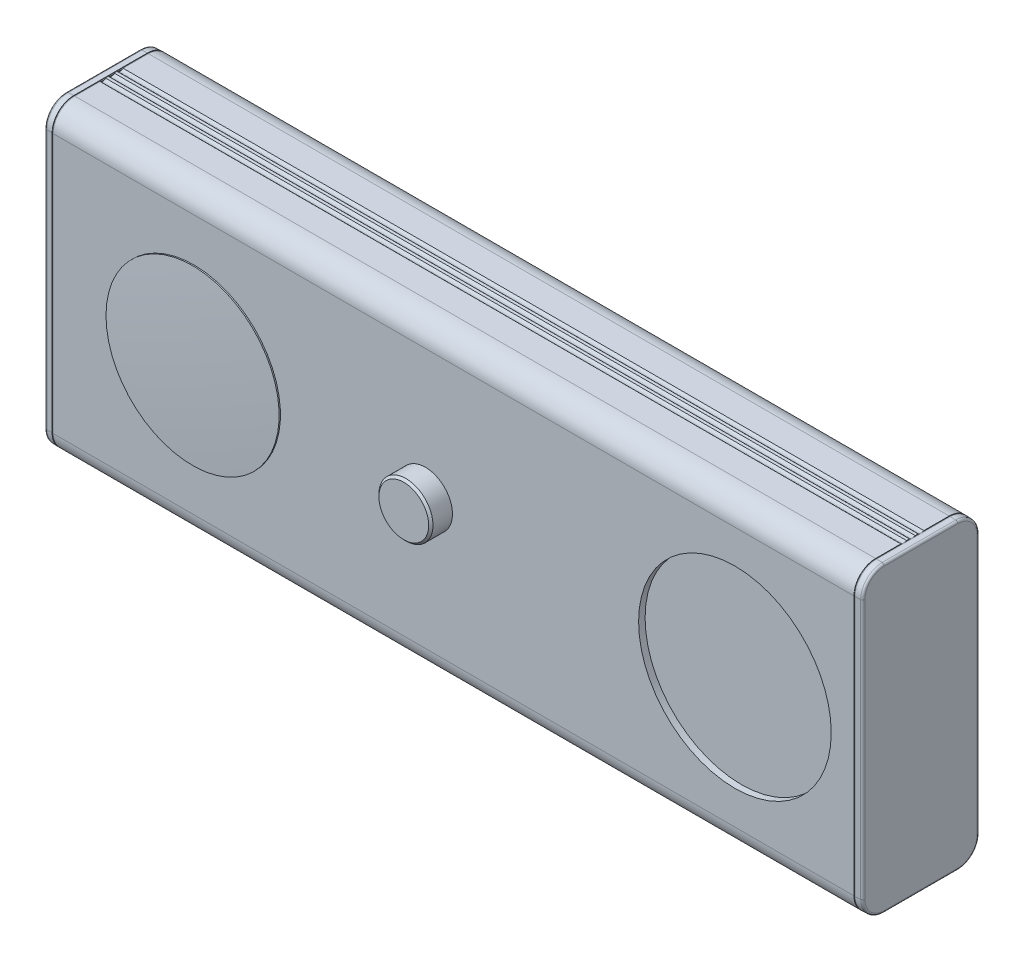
ISO-10303-21;
HEADER;
FILE_DESCRIPTION(('STEP AP214'),'2;1');
FILE_NAME('part.step','',(''),(''),'','','');
FILE_SCHEMA(('AUTOMOTIVE_DESIGN { 1 0 10303 214 1 1 1 1 }'));
ENDSEC;
DATA;
#1=APPLICATION_CONTEXT('core data for automotive mechanical design processes');
#2=APPLICATION_PROTOCOL_DEFINITION('international standard','automotive_design',2000,#1);
#3=PRODUCT_CONTEXT('',#1,'mechanical');
#4=PRODUCT('Part','Part','',(#3));
#5=PRODUCT_RELATED_PRODUCT_CATEGORY('part','',(#4));
#6=PRODUCT_DEFINITION_FORMATION('','',#4);
#7=PRODUCT_DEFINITION_CONTEXT('part definition',#1,'design');
#8=PRODUCT_DEFINITION('design','',#6,#7);
#9=PRODUCT_DEFINITION_SHAPE('','',#8);
#10=(LENGTH_UNIT() NAMED_UNIT(*) SI_UNIT(.MILLI.,.METRE.));
#11=(NAMED_UNIT(*) PLANE_ANGLE_UNIT() SI_UNIT($,.RADIAN.));
#12=(NAMED_UNIT(*) SI_UNIT($,.STERADIAN.) SOLID_ANGLE_UNIT());
#13=UNCERTAINTY_MEASURE_WITH_UNIT(LENGTH_MEASURE(1.E-05),#10,'distance_accuracy_value','');
#14=(GEOMETRIC_REPRESENTATION_CONTEXT(3) GLOBAL_UNCERTAINTY_ASSIGNED_CONTEXT((#13)) GLOBAL_UNIT_ASSIGNED_CONTEXT((#10,
#11,#12)) REPRESENTATION_CONTEXT('',''));
#15=CARTESIAN_POINT('',(0.,0.,0.));
#16=DIRECTION('',(0.,0.,1.));
#17=DIRECTION('',(1.,0.,0.));
#18=AXIS2_PLACEMENT_3D('',#15,#16,#17);
#19=CARTESIAN_POINT('',(155.,0.,-37.));
#20=DIRECTION('',(0.,0.,-1.));
#21=DIRECTION('',(-1.,0.,0.));
#22=AXIS2_PLACEMENT_3D('',#19,#20,#21);
#23=PLANE('',#22);
#24=CARTESIAN_POINT('',(155.,0.,-37.));
#25=DIRECTION('',(0.,0.,1.));
#26=DIRECTION('',(1.,0.,0.));
#27=AXIS2_PLACEMENT_3D('',#24,#25,#26);
#28=CIRCLE('',#27,11.5);
#29=CARTESIAN_POINT('',(166.5,0.,-37.));
#30=VERTEX_POINT('',#29);
#31=EDGE_CURVE('E20',#30,#30,#28,.T.);
#32=ORIENTED_EDGE('',*,*,#31,.F.);
#33=EDGE_LOOP('',(#32));
#34=FACE_BOUND('',#33,.T.);
#35=ADVANCED_FACE('F16',(#34),#23,.T.);
#36=CARTESIAN_POINT('',(374.,0.,0.));
#37=DIRECTION('',(1.,0.,0.));
#38=DIRECTION('',(0.,0.,-1.));
#39=AXIS2_PLACEMENT_3D('',#36,#37,#38);
#40=PLANE('',#39);
#41=CARTESIAN_POINT('',(374.,60.,-17.));
#42=DIRECTION('',(-1.,0.,0.));
#43=DIRECTION('',(0.,0.,1.));
#44=AXIS2_PLACEMENT_3D('',#41,#42,#43);
#45=CIRCLE('',#44,8.91208853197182);
#46=CARTESIAN_POINT('',(374.,68.9120885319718,-17.));
#47=VERTEX_POINT('',#46);
#48=CARTESIAN_POINT('',(374.,60.,-25.9120885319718));
#49=VERTEX_POINT('',#48);
#50=EDGE_CURVE('E422',#47,#49,#45,.T.);
#51=ORIENTED_EDGE('',*,*,#50,.F.);
#52=DIRECTION('',(0.,0.,-1.));
#53=VECTOR('',#52,1.);
#54=CARTESIAN_POINT('',(374.,68.9120885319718,13.5));
#55=LINE('',#54,#53);
#56=CARTESIAN_POINT('',(374.,68.9120885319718,17.));
#57=VERTEX_POINT('',#56);
#58=EDGE_CURVE('E418',#57,#47,#55,.T.);
#59=ORIENTED_EDGE('',*,*,#58,.F.);
#60=CARTESIAN_POINT('',(374.,60.,17.));
#61=DIRECTION('',(-1.,0.,0.));
#62=DIRECTION('',(0.,0.,1.));
#63=AXIS2_PLACEMENT_3D('',#60,#61,#62);
#64=CIRCLE('',#63,8.91208853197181);
#65=CARTESIAN_POINT('',(374.,60.,25.9120885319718));
#66=VERTEX_POINT('',#65);
#67=EDGE_CURVE('E415',#66,#57,#64,.T.);
#68=ORIENTED_EDGE('',*,*,#67,.F.);
#69=DIRECTION('',(0.,1.,0.));
#70=VECTOR('',#69,1.);
#71=CARTESIAN_POINT('',(374.,-35.,25.9120885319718));
#72=LINE('',#71,#70);
#73=CARTESIAN_POINT('',(374.,-60.,25.9120885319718));
#74=VERTEX_POINT('',#73);
#75=EDGE_CURVE('E436',#74,#66,#72,.T.);
#76=ORIENTED_EDGE('',*,*,#75,.F.);
#77=CARTESIAN_POINT('',(374.,-60.,17.));
#78=DIRECTION('',(-1.,0.,0.));
#79=DIRECTION('',(0.,0.,1.));
#80=AXIS2_PLACEMENT_3D('',#77,#78,#79);
#81=CIRCLE('',#80,8.91208853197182);
#82=CARTESIAN_POINT('',(374.,-68.9120885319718,17.));
#83=VERTEX_POINT('',#82);
#84=EDGE_CURVE('E443',#83,#74,#81,.T.);
#85=ORIENTED_EDGE('',*,*,#84,.F.);
#86=DIRECTION('',(0.,0.,1.));
#87=VECTOR('',#86,1.);
#88=CARTESIAN_POINT('',(374.,-68.9120885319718,-13.5));
#89=LINE('',#88,#87);
#90=CARTESIAN_POINT('',(374.,-68.9120885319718,-17.));
#91=VERTEX_POINT('',#90);
#92=EDGE_CURVE('E446',#91,#83,#89,.T.);
#93=ORIENTED_EDGE('',*,*,#92,.F.);
#94=CARTESIAN_POINT('',(374.,-60.,-17.));
#95=DIRECTION('',(-1.,0.,0.));
#96=DIRECTION('',(0.,0.,1.));
#97=AXIS2_PLACEMENT_3D('',#94,#95,#96);
#98=CIRCLE('',#97,8.91208853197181);
#99=CARTESIAN_POINT('',(374.,-60.,-25.9120885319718));
#100=VERTEX_POINT('',#99);
#101=EDGE_CURVE('E448',#100,#91,#98,.T.);
#102=ORIENTED_EDGE('',*,*,#101,.F.);
#103=DIRECTION('',(0.,-1.,0.));
#104=VECTOR('',#103,1.);
#105=CARTESIAN_POINT('',(374.,35.,-25.9120885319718));
#106=LINE('',#105,#104);
#107=EDGE_CURVE('E736',#49,#100,#106,.T.);
#108=ORIENTED_EDGE('',*,*,#107,.F.);
#109=EDGE_LOOP('',(#51,#59,#68,#76,#85,#93,#102,#108));
#110=FACE_BOUND('',#109,.T.);
#111=ADVANCED_FACE('F420',(#110),#40,.T.);
#112=CARTESIAN_POINT('',(155.,0.,-36.));
#113=DIRECTION('',(0.,0.,1.));
#114=DIRECTION('',(1.,0.,0.));
#115=AXIS2_PLACEMENT_3D('',#112,#113,#114);
#116=CONICAL_SURFACE('',#115,12.5,0.785398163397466);
#117=CARTESIAN_POINT('',(155.,0.,-36.));
#118=DIRECTION('',(0.,0.,1.));
#119=DIRECTION('',(1.,0.,0.));
#120=AXIS2_PLACEMENT_3D('',#117,#118,#119);
#121=CIRCLE('',#120,12.5);
#122=CARTESIAN_POINT('',(167.5,0.,-36.));
#123=VERTEX_POINT('',#122);
#124=EDGE_CURVE('E460',#123,#123,#121,.T.);
#125=ORIENTED_EDGE('',*,*,#124,.F.);
#126=EDGE_LOOP('',(#125));
#127=FACE_BOUND('',#126,.T.);
#128=ORIENTED_EDGE('',*,*,#31,.T.);
#129=EDGE_LOOP('',(#128));
#130=FACE_BOUND('',#129,.T.);
#131=ADVANCED_FACE('F2240',(#127,#130),#116,.T.);
#132=CARTESIAN_POINT('',(315.,-2.16840434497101E-12,771.399999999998));
#133=DIRECTION('',(1.,0.,0.));
#134=DIRECTION('',(0.,-0.0509895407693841,-0.998699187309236));
#135=AXIS2_PLACEMENT_3D('',#132,#133,#134);
#136=SPHERICAL_SURFACE('',#135,799.999999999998);
#137=CARTESIAN_POINT('',(315.,-2.16840434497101E-12,771.399999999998));
#138=DIRECTION('',(0.,0.,1.));
#139=DIRECTION('',(1.,0.,0.));
#140=AXIS2_PLACEMENT_3D('',#137,#138,#139);
#141=SPHERICAL_SURFACE('',#140,799.999999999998);
#142=CARTESIAN_POINT('',(315.,0.,-27.5993742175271));
#143=DIRECTION('',(0.,0.,1.));
#144=DIRECTION('',(1.,0.,0.));
#145=AXIS2_PLACEMENT_3D('',#142,#143,#144);
#146=CIRCLE('',#145,40.);
#147=CARTESIAN_POINT('',(355.,0.,-27.5993742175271));
#148=VERTEX_POINT('',#147);
#149=EDGE_CURVE('E456',#148,#148,#146,.T.);
#150=ORIENTED_EDGE('',*,*,#149,.F.);
#151=EDGE_LOOP('',(#150));
#152=FACE_BOUND('',#151,.T.);
#153=ADVANCED_FACE('F2231',(#152),#141,.T.);
#154=CARTESIAN_POINT('',(65.,0.,-24.));
#155=DIRECTION('',(0.,0.,1.));
#156=DIRECTION('',(1.,0.,0.));
#157=AXIS2_PLACEMENT_3D('',#154,#155,#156);
#158=PLANE('',#157);
#159=CARTESIAN_POINT('',(65.,0.,-24.));
#160=DIRECTION('',(0.,0.,1.));
#161=DIRECTION('',(1.,0.,0.));
#162=AXIS2_PLACEMENT_3D('',#159,#160,#161);
#163=CIRCLE('',#162,58.);
#164=CARTESIAN_POINT('',(123.,0.,-24.));
#165=VERTEX_POINT('',#164);
#166=EDGE_CURVE('E459',#165,#165,#163,.F.);
#167=ORIENTED_EDGE('',*,*,#166,.T.);
#168=EDGE_LOOP('',(#167));
#169=FACE_BOUND('',#168,.T.);
#170=ADVANCED_FACE('F2221',(#169),#158,.F.);
#171=CARTESIAN_POINT('',(-4.,0.,0.));
#172=DIRECTION('',(-1.,0.,0.));
#173=DIRECTION('',(0.,0.,1.));
#174=AXIS2_PLACEMENT_3D('',#171,#172,#173);
#175=PLANE('',#174);
#176=CARTESIAN_POINT('',(-4.00000000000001,-60.,-17.));
#177=DIRECTION('',(1.,0.,0.));
#178=DIRECTION('',(0.,0.,-1.));
#179=AXIS2_PLACEMENT_3D('',#176,#177,#178);
#180=CIRCLE('',#179,8.91208853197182);
#181=CARTESIAN_POINT('',(-4.00000000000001,-68.9120885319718,-17.));
#182=VERTEX_POINT('',#181);
#183=CARTESIAN_POINT('',(-4.00000000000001,-60.,-25.9120885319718));
#184=VERTEX_POINT('',#183);
#185=EDGE_CURVE('E478',#182,#184,#180,.T.);
#186=ORIENTED_EDGE('',*,*,#185,.F.);
#187=DIRECTION('',(0.,0.,-1.));
#188=VECTOR('',#187,1.);
#189=CARTESIAN_POINT('',(-4.,-68.9120885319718,13.5));
#190=LINE('',#189,#188);
#191=CARTESIAN_POINT('',(-4.,-68.9120885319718,17.));
#192=VERTEX_POINT('',#191);
#193=EDGE_CURVE('E463',#192,#182,#190,.T.);
#194=ORIENTED_EDGE('',*,*,#193,.F.);
#195=CARTESIAN_POINT('',(-4.00000000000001,-60.,17.));
#196=DIRECTION('',(1.,0.,0.));
#197=DIRECTION('',(0.,1.,0.));
#198=AXIS2_PLACEMENT_3D('',#195,#196,#197);
#199=CIRCLE('',#198,8.91208853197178);
#200=CARTESIAN_POINT('',(-4.,-60.,25.9120885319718));
#201=VERTEX_POINT('',#200);
#202=EDGE_CURVE('E464',#201,#192,#199,.T.);
#203=ORIENTED_EDGE('',*,*,#202,.F.);
#204=DIRECTION('',(0.,-1.,0.));
#205=VECTOR('',#204,1.);
#206=CARTESIAN_POINT('',(-4.,35.,25.9120885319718));
#207=LINE('',#206,#205);
#208=CARTESIAN_POINT('',(-4.,60.,25.9120885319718));
#209=VERTEX_POINT('',#208);
#210=EDGE_CURVE('E743',#209,#201,#207,.T.);
#211=ORIENTED_EDGE('',*,*,#210,.F.);
#212=CARTESIAN_POINT('',(-4.,60.,17.));
#213=DIRECTION('',(1.,0.,0.));
#214=DIRECTION('',(0.,0.,-1.));
#215=AXIS2_PLACEMENT_3D('',#212,#213,#214);
#216=CIRCLE('',#215,8.91208853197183);
#217=CARTESIAN_POINT('',(-4.,68.9120885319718,17.));
#218=VERTEX_POINT('',#217);
#219=EDGE_CURVE('E468',#218,#209,#216,.T.);
#220=ORIENTED_EDGE('',*,*,#219,.F.);
#221=DIRECTION('',(0.,0.,1.));
#222=VECTOR('',#221,1.);
#223=CARTESIAN_POINT('',(-4.,68.9120885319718,-13.5));
#224=LINE('',#223,#222);
#225=CARTESIAN_POINT('',(-4.,68.9120885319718,-17.));
#226=VERTEX_POINT('',#225);
#227=EDGE_CURVE('E471',#226,#218,#224,.T.);
#228=ORIENTED_EDGE('',*,*,#227,.F.);
#229=CARTESIAN_POINT('',(-4.,60.,-17.));
#230=DIRECTION('',(1.,0.,0.));
#231=DIRECTION('',(0.,1.,0.));
#232=AXIS2_PLACEMENT_3D('',#229,#230,#231);
#233=CIRCLE('',#232,8.9120885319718);
#234=CARTESIAN_POINT('',(-4.,60.,-25.9120885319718));
#235=VERTEX_POINT('',#234);
#236=EDGE_CURVE('E473',#235,#226,#233,.T.);
#237=ORIENTED_EDGE('',*,*,#236,.F.);
#238=DIRECTION('',(0.,1.,0.));
#239=VECTOR('',#238,1.);
#240=CARTESIAN_POINT('',(-4.,-35.,-25.9120885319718));
#241=LINE('',#240,#239);
#242=EDGE_CURVE('E750',#184,#235,#241,.T.);
#243=ORIENTED_EDGE('',*,*,#242,.F.);
#244=EDGE_LOOP('',(#186,#194,#203,#211,#220,#228,#237,#243));
#245=FACE_BOUND('',#244,.T.);
#246=ADVANCED_FACE('F1182',(#245),#175,.T.);
#247=CARTESIAN_POINT('',(373.,68.9120885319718,13.5));
#248=DIRECTION('',(0.,0.,-1.));
#249=DIRECTION('',(-1.,0.,0.));
#250=AXIS2_PLACEMENT_3D('',#247,#248,#249);
#251=CYLINDRICAL_SURFACE('',#250,1.);
#252=CARTESIAN_POINT('',(373.,68.9120885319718,-17.));
#253=DIRECTION('',(0.,0.,-1.));
#254=DIRECTION('',(-1.,0.,0.));
#255=AXIS2_PLACEMENT_3D('',#252,#253,#254);
#256=CIRCLE('',#255,0.999999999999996);
#257=CARTESIAN_POINT('',(373.034899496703,69.9114793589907,-17.));
#258=VERTEX_POINT('',#257);
#259=EDGE_CURVE('E455',#258,#47,#256,.T.);
#260=ORIENTED_EDGE('',*,*,#259,.F.);
#261=DIRECTION('',(0.,0.,1.));
#262=VECTOR('',#261,1.);
#263=CARTESIAN_POINT('',(373.034899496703,69.9114793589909,27.));
#264=LINE('',#263,#262);
#265=CARTESIAN_POINT('',(373.034899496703,69.9114793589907,17.));
#266=VERTEX_POINT('',#265);
#267=EDGE_CURVE('E432',#266,#258,#264,.F.);
#268=ORIENTED_EDGE('',*,*,#267,.F.);
#269=CARTESIAN_POINT('',(373.,68.9120885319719,17.));
#270=DIRECTION('',(0.,0.,1.));
#271=DIRECTION('',(1.,0.,0.));
#272=AXIS2_PLACEMENT_3D('',#269,#270,#271);
#273=CIRCLE('',#272,0.999999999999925);
#274=EDGE_CURVE('E429',#57,#266,#273,.T.);
#275=ORIENTED_EDGE('',*,*,#274,.F.);
#276=ORIENTED_EDGE('',*,*,#58,.T.);
#277=EDGE_LOOP('',(#260,#268,#275,#276));
#278=FACE_BOUND('',#277,.T.);
#279=ADVANCED_FACE('F430',(#278),#251,.T.);
#280=CARTESIAN_POINT('',(373.,60.,17.));
#281=DIRECTION('',(-1.,0.,0.));
#282=DIRECTION('',(0.,0.,1.));
#283=AXIS2_PLACEMENT_3D('',#280,#281,#282);
#284=TOROIDAL_SURFACE('',#283,8.9120885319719,0.999999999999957);
#285=ORIENTED_EDGE('',*,*,#274,.T.);
#286=CARTESIAN_POINT('',(373.034899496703,60.,17.));
#287=DIRECTION('',(-1.,0.,0.));
#288=DIRECTION('',(0.,0.,1.));
#289=AXIS2_PLACEMENT_3D('',#286,#287,#288);
#290=CIRCLE('',#289,9.9114793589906);
#291=CARTESIAN_POINT('',(373.034899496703,60.,26.9114793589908));
#292=VERTEX_POINT('',#291);
#293=EDGE_CURVE('E755',#292,#266,#290,.T.);
#294=ORIENTED_EDGE('',*,*,#293,.F.);
#295=CARTESIAN_POINT('',(373.,60.,25.9120885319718));
#296=DIRECTION('',(0.,1.,0.));
#297=DIRECTION('',(0.,0.,1.));
#298=AXIS2_PLACEMENT_3D('',#295,#296,#297);
#299=CIRCLE('',#298,1.);
#300=EDGE_CURVE('E440',#66,#292,#299,.F.);
#301=ORIENTED_EDGE('',*,*,#300,.F.);
#302=ORIENTED_EDGE('',*,*,#67,.T.);
#303=EDGE_LOOP('',(#285,#294,#301,#302));
#304=FACE_BOUND('',#303,.T.);
#305=ADVANCED_FACE('F438',(#304),#284,.T.);
#306=CARTESIAN_POINT('',(373.,-35.,25.9120885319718));
#307=DIRECTION('',(0.,1.,0.));
#308=DIRECTION('',(0.,0.,1.));
#309=AXIS2_PLACEMENT_3D('',#306,#307,#308);
#310=CYLINDRICAL_SURFACE('',#309,1.);
#311=ORIENTED_EDGE('',*,*,#300,.T.);
#312=DIRECTION('',(0.,1.,0.));
#313=VECTOR('',#312,1.);
#314=CARTESIAN_POINT('',(373.034899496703,-70.,26.9114793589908));
#315=LINE('',#314,#313);
#316=CARTESIAN_POINT('',(373.034899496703,-60.,26.9114793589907));
#317=VERTEX_POINT('',#316);
#318=EDGE_CURVE('E761',#317,#292,#315,.T.);
#319=ORIENTED_EDGE('',*,*,#318,.F.);
#320=CARTESIAN_POINT('',(373.,-60.,25.9120885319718));
#321=DIRECTION('',(0.,-1.,0.));
#322=DIRECTION('',(1.,0.,0.));
#323=AXIS2_PLACEMENT_3D('',#320,#321,#322);
#324=CIRCLE('',#323,1.);
#325=EDGE_CURVE('E447',#74,#317,#324,.T.);
#326=ORIENTED_EDGE('',*,*,#325,.F.);
#327=ORIENTED_EDGE('',*,*,#75,.T.);
#328=EDGE_LOOP('',(#311,#319,#326,#327));
#329=FACE_BOUND('',#328,.T.);
#330=ADVANCED_FACE('F2186',(#329),#310,.T.);
#331=CARTESIAN_POINT('',(373.,-60.,17.));
#332=DIRECTION('',(-1.,0.,0.));
#333=DIRECTION('',(0.,0.,1.));
#334=AXIS2_PLACEMENT_3D('',#331,#332,#333);
#335=TOROIDAL_SURFACE('',#334,8.91208853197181,1.);
#336=CARTESIAN_POINT('',(373.,-68.9120885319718,17.));
#337=DIRECTION('',(0.,0.,1.));
#338=DIRECTION('',(1.,0.,0.));
#339=AXIS2_PLACEMENT_3D('',#336,#337,#338);
#340=CIRCLE('',#339,1.);
#341=CARTESIAN_POINT('',(373.034899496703,-69.9114793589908,17.));
#342=VERTEX_POINT('',#341);
#343=EDGE_CURVE('E452',#83,#342,#340,.F.);
#344=ORIENTED_EDGE('',*,*,#343,.F.);
#345=ORIENTED_EDGE('',*,*,#84,.T.);
#346=ORIENTED_EDGE('',*,*,#325,.T.);
#347=CARTESIAN_POINT('',(373.034899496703,-60.,17.));
#348=DIRECTION('',(-1.,0.,0.));
#349=DIRECTION('',(0.,0.,1.));
#350=AXIS2_PLACEMENT_3D('',#347,#348,#349);
#351=CIRCLE('',#350,9.9114793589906);
#352=EDGE_CURVE('E767',#342,#317,#351,.T.);
#353=ORIENTED_EDGE('',*,*,#352,.F.);
#354=EDGE_LOOP('',(#344,#345,#346,#353));
#355=FACE_BOUND('',#354,.T.);
#356=ADVANCED_FACE('F2176',(#355),#335,.T.);
#357=CARTESIAN_POINT('',(373.,-68.9120885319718,-13.5));
#358=DIRECTION('',(0.,0.,1.));
#359=DIRECTION('',(1.,0.,0.));
#360=AXIS2_PLACEMENT_3D('',#357,#358,#359);
#361=CYLINDRICAL_SURFACE('',#360,1.);
#362=ORIENTED_EDGE('',*,*,#343,.T.);
#363=DIRECTION('',(0.,0.,1.));
#364=VECTOR('',#363,1.);
#365=CARTESIAN_POINT('',(373.034899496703,-69.9114793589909,-27.));
#366=LINE('',#365,#364);
#367=CARTESIAN_POINT('',(373.034899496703,-69.9114793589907,-17.));
#368=VERTEX_POINT('',#367);
#369=EDGE_CURVE('E773',#368,#342,#366,.T.);
#370=ORIENTED_EDGE('',*,*,#369,.F.);
#371=CARTESIAN_POINT('',(373.,-68.9120885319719,-17.));
#372=DIRECTION('',(0.,0.,-1.));
#373=DIRECTION('',(-1.,0.,0.));
#374=AXIS2_PLACEMENT_3D('',#371,#372,#373);
#375=CIRCLE('',#374,0.999999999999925);
#376=EDGE_CURVE('E451',#91,#368,#375,.T.);
#377=ORIENTED_EDGE('',*,*,#376,.F.);
#378=ORIENTED_EDGE('',*,*,#92,.T.);
#379=EDGE_LOOP('',(#362,#370,#377,#378));
#380=FACE_BOUND('',#379,.T.);
#381=ADVANCED_FACE('F2166',(#380),#361,.T.);
#382=CARTESIAN_POINT('',(373.,-60.,-17.));
#383=DIRECTION('',(-1.,0.,0.));
#384=DIRECTION('',(0.,0.,1.));
#385=AXIS2_PLACEMENT_3D('',#382,#383,#384);
#386=TOROIDAL_SURFACE('',#385,8.9120885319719,0.999999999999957);
#387=ORIENTED_EDGE('',*,*,#376,.T.);
#388=CARTESIAN_POINT('',(373.034899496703,-60.,-17.));
#389=DIRECTION('',(-1.,0.,0.));
#390=DIRECTION('',(0.,0.,1.));
#391=AXIS2_PLACEMENT_3D('',#388,#389,#390);
#392=CIRCLE('',#391,9.9114793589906);
#393=CARTESIAN_POINT('',(373.034899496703,-60.,-26.9114793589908));
#394=VERTEX_POINT('',#393);
#395=EDGE_CURVE('E779',#394,#368,#392,.T.);
#396=ORIENTED_EDGE('',*,*,#395,.F.);
#397=CARTESIAN_POINT('',(373.,-60.,-25.9120885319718));
#398=DIRECTION('',(0.,-1.,0.));
#399=DIRECTION('',(0.,0.,-1.));
#400=AXIS2_PLACEMENT_3D('',#397,#398,#399);
#401=CIRCLE('',#400,1.);
#402=EDGE_CURVE('E739',#100,#394,#401,.F.);
#403=ORIENTED_EDGE('',*,*,#402,.F.);
#404=ORIENTED_EDGE('',*,*,#101,.T.);
#405=EDGE_LOOP('',(#387,#396,#403,#404));
#406=FACE_BOUND('',#405,.T.);
#407=ADVANCED_FACE('F2156',(#406),#386,.T.);
#408=CARTESIAN_POINT('',(373.,35.,-25.9120885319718));
#409=DIRECTION('',(0.,-1.,0.));
#410=DIRECTION('',(0.,0.,-1.));
#411=AXIS2_PLACEMENT_3D('',#408,#409,#410);
#412=CYLINDRICAL_SURFACE('',#411,1.);
#413=ORIENTED_EDGE('',*,*,#402,.T.);
#414=DIRECTION('',(0.,1.,0.));
#415=VECTOR('',#414,1.);
#416=CARTESIAN_POINT('',(373.034899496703,70.,-26.9114793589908));
#417=LINE('',#416,#415);
#418=CARTESIAN_POINT('',(373.034899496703,60.,-26.9114793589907));
#419=VERTEX_POINT('',#418);
#420=EDGE_CURVE('E794',#419,#394,#417,.F.);
#421=ORIENTED_EDGE('',*,*,#420,.F.);
#422=CARTESIAN_POINT('',(373.,60.,-25.9120885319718));
#423=DIRECTION('',(0.,1.,0.));
#424=DIRECTION('',(-1.,0.,0.));
#425=AXIS2_PLACEMENT_3D('',#422,#423,#424);
#426=CIRCLE('',#425,0.999999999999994);
#427=EDGE_CURVE('E454',#49,#419,#426,.T.);
#428=ORIENTED_EDGE('',*,*,#427,.F.);
#429=ORIENTED_EDGE('',*,*,#107,.T.);
#430=EDGE_LOOP('',(#413,#421,#428,#429));
#431=FACE_BOUND('',#430,.T.);
#432=ADVANCED_FACE('F2147',(#431),#412,.T.);
#433=CARTESIAN_POINT('',(373.,60.,-17.));
#434=DIRECTION('',(-1.,0.,0.));
#435=DIRECTION('',(0.,0.,1.));
#436=AXIS2_PLACEMENT_3D('',#433,#434,#435);
#437=TOROIDAL_SURFACE('',#436,8.91208853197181,0.999999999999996);
#438=ORIENTED_EDGE('',*,*,#427,.T.);
#439=CARTESIAN_POINT('',(373.034899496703,60.,-17.));
#440=DIRECTION('',(-1.,0.,0.));
#441=DIRECTION('',(0.,0.,1.));
#442=AXIS2_PLACEMENT_3D('',#439,#440,#441);
#443=CIRCLE('',#442,9.9114793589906);
#444=EDGE_CURVE('E789',#258,#419,#443,.T.);
#445=ORIENTED_EDGE('',*,*,#444,.F.);
#446=ORIENTED_EDGE('',*,*,#259,.T.);
#447=ORIENTED_EDGE('',*,*,#50,.T.);
#448=EDGE_LOOP('',(#438,#445,#446,#447));
#449=FACE_BOUND('',#448,.T.);
#450=ADVANCED_FACE('F2138',(#449),#437,.T.);
#451=CARTESIAN_POINT('',(0.,-70.,-27.));
#452=DIRECTION('',(0.,-1.,0.));
#453=DIRECTION('',(0.,0.,-1.));
#454=AXIS2_PLACEMENT_3D('',#451,#452,#453);
#455=PLANE('',#454);
#456=DIRECTION('',(-1.,0.,0.));
#457=VECTOR('',#456,1.);
#458=CARTESIAN_POINT('',(370.,-70.,-1.32287565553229));
#459=LINE('',#458,#457);
#460=CARTESIAN_POINT('',(370.,-70.,-1.32287565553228));
#461=VERTEX_POINT('',#460);
#462=CARTESIAN_POINT('',(0.,-70.,-1.32287565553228));
#463=VERTEX_POINT('',#462);
#464=EDGE_CURVE('E492',#461,#463,#459,.T.);
#465=ORIENTED_EDGE('',*,*,#464,.T.);
#466=DIRECTION('',(0.,0.,-1.));
#467=VECTOR('',#466,1.);
#468=CARTESIAN_POINT('',(0.,-70.,-27.));
#469=LINE('',#468,#467);
#470=CARTESIAN_POINT('',(0.,-70.,-2.67712434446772));
#471=VERTEX_POINT('',#470);
#472=EDGE_CURVE('E742',#463,#471,#469,.T.);
#473=ORIENTED_EDGE('',*,*,#472,.T.);
#474=DIRECTION('',(-1.,0.,0.));
#475=VECTOR('',#474,1.);
#476=CARTESIAN_POINT('',(370.,-70.,-2.67712434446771));
#477=LINE('',#476,#475);
#478=CARTESIAN_POINT('',(370.,-70.,-2.67712434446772));
#479=VERTEX_POINT('',#478);
#480=EDGE_CURVE('E488',#471,#479,#477,.F.);
#481=ORIENTED_EDGE('',*,*,#480,.T.);
#482=DIRECTION('',(0.,0.,-1.));
#483=VECTOR('',#482,1.);
#484=CARTESIAN_POINT('',(370.,-70.,-27.));
#485=LINE('',#484,#483);
#486=EDGE_CURVE('E788',#479,#461,#485,.F.);
#487=ORIENTED_EDGE('',*,*,#486,.T.);
#488=EDGE_LOOP('',(#465,#473,#481,#487));
#489=FACE_BOUND('',#488,.T.);
#490=ADVANCED_FACE('F2129',(#489),#455,.T.);
#491=CARTESIAN_POINT('',(155.,0.,-37.));
#492=DIRECTION('',(0.,0.,1.));
#493=DIRECTION('',(1.,0.,0.));
#494=AXIS2_PLACEMENT_3D('',#491,#492,#493);
#495=CYLINDRICAL_SURFACE('',#494,12.5);
#496=CARTESIAN_POINT('',(155.,0.,-27.));
#497=DIRECTION('',(0.,0.,1.));
#498=DIRECTION('',(1.,0.,0.));
#499=AXIS2_PLACEMENT_3D('',#496,#497,#498);
#500=CIRCLE('',#499,12.5);
#501=CARTESIAN_POINT('',(167.5,0.,-27.));
#502=VERTEX_POINT('',#501);
#503=EDGE_CURVE('E493',#502,#502,#500,.T.);
#504=ORIENTED_EDGE('',*,*,#503,.F.);
#505=EDGE_LOOP('',(#504));
#506=FACE_BOUND('',#505,.T.);
#507=ORIENTED_EDGE('',*,*,#124,.T.);
#508=EDGE_LOOP('',(#507));
#509=FACE_BOUND('',#508,.T.);
#510=ADVANCED_FACE('F2119',(#506,#509),#495,.T.);
#511=CARTESIAN_POINT('',(315.,0.,-27.2996871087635));
#512=DIRECTION('',(0.,0.,1.));
#513=DIRECTION('',(1.,0.,0.));
#514=AXIS2_PLACEMENT_3D('',#511,#512,#513);
#515=CYLINDRICAL_SURFACE('',#514,40.);
#516=ORIENTED_EDGE('',*,*,#149,.T.);
#517=EDGE_LOOP('',(#516));
#518=FACE_BOUND('',#517,.T.);
#519=CARTESIAN_POINT('',(315.,0.,-27.));
#520=DIRECTION('',(0.,0.,1.));
#521=DIRECTION('',(1.,0.,0.));
#522=AXIS2_PLACEMENT_3D('',#519,#520,#521);
#523=CIRCLE('',#522,40.);
#524=CARTESIAN_POINT('',(355.,0.,-27.));
#525=VERTEX_POINT('',#524);
#526=EDGE_CURVE('E496',#525,#525,#523,.T.);
#527=ORIENTED_EDGE('',*,*,#526,.F.);
#528=EDGE_LOOP('',(#527));
#529=FACE_BOUND('',#528,.T.);
#530=ADVANCED_FACE('F2110',(#518,#529),#515,.T.);
#531=CARTESIAN_POINT('',(65.,0.,-27.));
#532=DIRECTION('',(0.,0.,1.));
#533=DIRECTION('',(1.,0.,0.));
#534=AXIS2_PLACEMENT_3D('',#531,#532,#533);
#535=CYLINDRICAL_SURFACE('',#534,58.);
#536=ORIENTED_EDGE('',*,*,#166,.F.);
#537=EDGE_LOOP('',(#536));
#538=FACE_BOUND('',#537,.T.);
#539=CARTESIAN_POINT('',(65.,0.,-27.));
#540=DIRECTION('',(0.,0.,1.));
#541=DIRECTION('',(1.,0.,0.));
#542=AXIS2_PLACEMENT_3D('',#539,#540,#541);
#543=CIRCLE('',#542,58.);
#544=CARTESIAN_POINT('',(123.,0.,-27.));
#545=VERTEX_POINT('',#544);
#546=EDGE_CURVE('E500',#545,#545,#543,.T.);
#547=ORIENTED_EDGE('',*,*,#546,.F.);
#548=EDGE_LOOP('',(#547));
#549=FACE_BOUND('',#548,.T.);
#550=ADVANCED_FACE('F2100',(#538,#549),#535,.F.);
#551=CARTESIAN_POINT('',(-3.,-68.9120885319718,13.5));
#552=DIRECTION('',(0.,0.,-1.));
#553=DIRECTION('',(-1.,0.,0.));
#554=AXIS2_PLACEMENT_3D('',#551,#552,#553);
#555=CYLINDRICAL_SURFACE('',#554,1.);
#556=CARTESIAN_POINT('',(-3.00000000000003,-68.9120885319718,-17.));
#557=DIRECTION('',(0.,0.,-1.));
#558=DIRECTION('',(-1.,0.,0.));
#559=AXIS2_PLACEMENT_3D('',#556,#557,#558);
#560=CIRCLE('',#559,0.999999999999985);
#561=CARTESIAN_POINT('',(-3.0348994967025,-69.9114793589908,-17.));
#562=VERTEX_POINT('',#561);
#563=EDGE_CURVE('E482',#562,#182,#560,.T.);
#564=ORIENTED_EDGE('',*,*,#563,.F.);
#565=DIRECTION('',(0.,0.,1.));
#566=VECTOR('',#565,1.);
#567=CARTESIAN_POINT('',(-3.0348994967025,-69.9114793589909,27.));
#568=LINE('',#567,#566);
#569=CARTESIAN_POINT('',(-3.0348994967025,-69.9114793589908,17.));
#570=VERTEX_POINT('',#569);
#571=EDGE_CURVE('E809',#570,#562,#568,.F.);
#572=ORIENTED_EDGE('',*,*,#571,.F.);
#573=CARTESIAN_POINT('',(-3.00000000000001,-68.9120885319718,17.));
#574=DIRECTION('',(0.,0.,1.));
#575=DIRECTION('',(1.,0.,0.));
#576=AXIS2_PLACEMENT_3D('',#573,#574,#575);
#577=CIRCLE('',#576,0.999999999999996);
#578=EDGE_CURVE('E467',#192,#570,#577,.T.);
#579=ORIENTED_EDGE('',*,*,#578,.F.);
#580=ORIENTED_EDGE('',*,*,#193,.T.);
#581=EDGE_LOOP('',(#564,#572,#579,#580));
#582=FACE_BOUND('',#581,.T.);
#583=ADVANCED_FACE('F1177',(#582),#555,.T.);
#584=CARTESIAN_POINT('',(-3.00000000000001,-60.,17.));
#585=DIRECTION('',(1.,0.,0.));
#586=DIRECTION('',(0.,1.,0.));
#587=AXIS2_PLACEMENT_3D('',#584,#585,#586);
#588=TOROIDAL_SURFACE('',#587,8.9120885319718,0.999999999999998);
#589=ORIENTED_EDGE('',*,*,#578,.T.);
#590=CARTESIAN_POINT('',(-3.03489949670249,-60.,17.));
#591=DIRECTION('',(1.,0.,0.));
#592=DIRECTION('',(0.,0.,-1.));
#593=AXIS2_PLACEMENT_3D('',#590,#591,#592);
#594=CIRCLE('',#593,9.91147935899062);
#595=CARTESIAN_POINT('',(-3.0348994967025,-60.,26.9114793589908));
#596=VERTEX_POINT('',#595);
#597=EDGE_CURVE('E805',#596,#570,#594,.T.);
#598=ORIENTED_EDGE('',*,*,#597,.F.);
#599=CARTESIAN_POINT('',(-3.,-60.0000000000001,25.9120885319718));
#600=DIRECTION('',(0.,-1.,0.));
#601=DIRECTION('',(0.,0.,-1.));
#602=AXIS2_PLACEMENT_3D('',#599,#600,#601);
#603=CIRCLE('',#602,1.);
#604=EDGE_CURVE('E746',#201,#596,#603,.F.);
#605=ORIENTED_EDGE('',*,*,#604,.F.);
#606=ORIENTED_EDGE('',*,*,#202,.T.);
#607=EDGE_LOOP('',(#589,#598,#605,#606));
#608=FACE_BOUND('',#607,.T.);
#609=ADVANCED_FACE('F1179',(#608),#588,.T.);
#610=CARTESIAN_POINT('',(-3.,35.,25.9120885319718));
#611=DIRECTION('',(0.,-1.,0.));
#612=DIRECTION('',(0.,0.,-1.));
#613=AXIS2_PLACEMENT_3D('',#610,#611,#612);
#614=CYLINDRICAL_SURFACE('',#613,1.);
#615=ORIENTED_EDGE('',*,*,#604,.T.);
#616=DIRECTION('',(0.,1.,0.));
#617=VECTOR('',#616,1.);
#618=CARTESIAN_POINT('',(-3.0348994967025,70.,26.9114793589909));
#619=LINE('',#618,#617);
#620=CARTESIAN_POINT('',(-3.0348994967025,60.,26.9114793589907));
#621=VERTEX_POINT('',#620);
#622=EDGE_CURVE('E812',#621,#596,#619,.F.);
#623=ORIENTED_EDGE('',*,*,#622,.F.);
#624=CARTESIAN_POINT('',(-3.00000000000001,60.,25.9120885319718));
#625=DIRECTION('',(0.,1.,0.));
#626=DIRECTION('',(0.,0.,1.));
#627=AXIS2_PLACEMENT_3D('',#624,#625,#626);
#628=CIRCLE('',#627,0.999999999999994);
#629=EDGE_CURVE('E472',#209,#621,#628,.T.);
#630=ORIENTED_EDGE('',*,*,#629,.F.);
#631=ORIENTED_EDGE('',*,*,#210,.T.);
#632=EDGE_LOOP('',(#615,#623,#630,#631));
#633=FACE_BOUND('',#632,.T.);
#634=ADVANCED_FACE('F1205',(#633),#614,.T.);
#635=CARTESIAN_POINT('',(-3.00000000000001,60.,17.));
#636=DIRECTION('',(1.,0.,0.));
#637=DIRECTION('',(0.,0.,-1.));
#638=AXIS2_PLACEMENT_3D('',#635,#636,#637);
#639=TOROIDAL_SURFACE('',#638,8.91208853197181,0.999999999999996);
#640=CARTESIAN_POINT('',(-3.,68.9120885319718,17.));
#641=DIRECTION('',(0.,0.,1.));
#642=DIRECTION('',(1.,0.,0.));
#643=AXIS2_PLACEMENT_3D('',#640,#641,#642);
#644=CIRCLE('',#643,1.);
#645=CARTESIAN_POINT('',(-3.0348994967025,69.9114793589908,17.));
#646=VERTEX_POINT('',#645);
#647=EDGE_CURVE('E477',#218,#646,#644,.F.);
#648=ORIENTED_EDGE('',*,*,#647,.F.);
#649=ORIENTED_EDGE('',*,*,#219,.T.);
#650=ORIENTED_EDGE('',*,*,#629,.T.);
#651=CARTESIAN_POINT('',(-3.03489949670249,60.,17.));
#652=DIRECTION('',(1.,0.,0.));
#653=DIRECTION('',(0.,0.,-1.));
#654=AXIS2_PLACEMENT_3D('',#651,#652,#653);
#655=CIRCLE('',#654,9.91147935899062);
#656=EDGE_CURVE('E818',#646,#621,#655,.T.);
#657=ORIENTED_EDGE('',*,*,#656,.F.);
#658=EDGE_LOOP('',(#648,#649,#650,#657));
#659=FACE_BOUND('',#658,.T.);
#660=ADVANCED_FACE('F1208',(#659),#639,.T.);
#661=CARTESIAN_POINT('',(-3.,68.9120885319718,-13.5));
#662=DIRECTION('',(0.,0.,1.));
#663=DIRECTION('',(1.,0.,0.));
#664=AXIS2_PLACEMENT_3D('',#661,#662,#663);
#665=CYLINDRICAL_SURFACE('',#664,1.);
#666=ORIENTED_EDGE('',*,*,#647,.T.);
#667=DIRECTION('',(0.,0.,1.));
#668=VECTOR('',#667,1.);
#669=CARTESIAN_POINT('',(-3.0348994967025,69.9114793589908,-27.));
#670=LINE('',#669,#668);
#671=CARTESIAN_POINT('',(-3.0348994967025,69.9114793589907,-17.));
#672=VERTEX_POINT('',#671);
#673=EDGE_CURVE('E824',#672,#646,#670,.T.);
#674=ORIENTED_EDGE('',*,*,#673,.F.);
#675=CARTESIAN_POINT('',(-3.00000000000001,68.9120885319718,-17.));
#676=DIRECTION('',(0.,0.,-1.));
#677=DIRECTION('',(-1.,0.,0.));
#678=AXIS2_PLACEMENT_3D('',#675,#676,#677);
#679=CIRCLE('',#678,0.999999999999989);
#680=EDGE_CURVE('E476',#226,#672,#679,.T.);
#681=ORIENTED_EDGE('',*,*,#680,.F.);
#682=ORIENTED_EDGE('',*,*,#227,.T.);
#683=EDGE_LOOP('',(#666,#674,#681,#682));
#684=FACE_BOUND('',#683,.T.);
#685=ADVANCED_FACE('F1211',(#684),#665,.T.);
#686=CARTESIAN_POINT('',(-3.,60.,-17.));
#687=DIRECTION('',(1.,0.,0.));
#688=DIRECTION('',(0.,1.,0.));
#689=AXIS2_PLACEMENT_3D('',#686,#687,#688);
#690=TOROIDAL_SURFACE('',#689,8.91208853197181,1.);
#691=ORIENTED_EDGE('',*,*,#680,.T.);
#692=CARTESIAN_POINT('',(-3.03489949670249,60.,-17.));
#693=DIRECTION('',(1.,0.,0.));
#694=DIRECTION('',(0.,0.,-1.));
#695=AXIS2_PLACEMENT_3D('',#692,#693,#694);
#696=CIRCLE('',#695,9.91147935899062);
#697=CARTESIAN_POINT('',(-3.0348994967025,60.,-26.9114793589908));
#698=VERTEX_POINT('',#697);
#699=EDGE_CURVE('E830',#698,#672,#696,.T.);
#700=ORIENTED_EDGE('',*,*,#699,.F.);
#701=CARTESIAN_POINT('',(-3.,60.,-25.9120885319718));
#702=DIRECTION('',(0.,1.,0.));
#703=DIRECTION('',(0.,0.,1.));
#704=AXIS2_PLACEMENT_3D('',#701,#702,#703);
#705=CIRCLE('',#704,1.);
#706=EDGE_CURVE('E752',#235,#698,#705,.F.);
#707=ORIENTED_EDGE('',*,*,#706,.F.);
#708=ORIENTED_EDGE('',*,*,#236,.T.);
#709=EDGE_LOOP('',(#691,#700,#707,#708));
#710=FACE_BOUND('',#709,.T.);
#711=ADVANCED_FACE('F1186',(#710),#690,.T.);
#712=CARTESIAN_POINT('',(-3.,-35.,-25.9120885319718));
#713=DIRECTION('',(0.,1.,0.));
#714=DIRECTION('',(0.,0.,1.));
#715=AXIS2_PLACEMENT_3D('',#712,#713,#714);
#716=CYLINDRICAL_SURFACE('',#715,1.);
#717=ORIENTED_EDGE('',*,*,#706,.T.);
#718=DIRECTION('',(0.,1.,0.));
#719=VECTOR('',#718,1.);
#720=CARTESIAN_POINT('',(-3.0348994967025,-70.,-26.9114793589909));
#721=LINE('',#720,#719);
#722=CARTESIAN_POINT('',(-3.0348994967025,-60.,-26.9114793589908));
#723=VERTEX_POINT('',#722);
#724=EDGE_CURVE('E846',#723,#698,#721,.T.);
#725=ORIENTED_EDGE('',*,*,#724,.F.);
#726=CARTESIAN_POINT('',(-3.00000000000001,-60.,-25.9120885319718));
#727=DIRECTION('',(0.,-1.,0.));
#728=DIRECTION('',(1.,0.,0.));
#729=AXIS2_PLACEMENT_3D('',#726,#727,#728);
#730=CIRCLE('',#729,0.999999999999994);
#731=EDGE_CURVE('E481',#184,#723,#730,.T.);
#732=ORIENTED_EDGE('',*,*,#731,.F.);
#733=ORIENTED_EDGE('',*,*,#242,.T.);
#734=EDGE_LOOP('',(#717,#725,#732,#733));
#735=FACE_BOUND('',#734,.T.);
#736=ADVANCED_FACE('F1157',(#735),#716,.T.);
#737=CARTESIAN_POINT('',(-3.00000000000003,-60.,-17.));
#738=DIRECTION('',(1.,0.,0.));
#739=DIRECTION('',(0.,0.,-1.));
#740=AXIS2_PLACEMENT_3D('',#737,#738,#739);
#741=TOROIDAL_SURFACE('',#740,8.91208853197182,0.999999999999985);
#742=ORIENTED_EDGE('',*,*,#731,.T.);
#743=CARTESIAN_POINT('',(-3.03489949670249,-60.,-17.));
#744=DIRECTION('',(1.,0.,0.));
#745=DIRECTION('',(0.,0.,-1.));
#746=AXIS2_PLACEMENT_3D('',#743,#744,#745);
#747=CIRCLE('',#746,9.91147935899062);
#748=EDGE_CURVE('E842',#562,#723,#747,.T.);
#749=ORIENTED_EDGE('',*,*,#748,.F.);
#750=ORIENTED_EDGE('',*,*,#563,.T.);
#751=ORIENTED_EDGE('',*,*,#185,.T.);
#752=EDGE_LOOP('',(#742,#749,#750,#751));
#753=FACE_BOUND('',#752,.T.);
#754=ADVANCED_FACE('F1164',(#753),#741,.T.);
#755=CARTESIAN_POINT('',(0.,70.,27.));
#756=DIRECTION('',(0.,1.,0.));
#757=DIRECTION('',(0.,0.,1.));
#758=AXIS2_PLACEMENT_3D('',#755,#756,#757);
#759=PLANE('',#758);
#760=DIRECTION('',(-1.,0.,0.));
#761=VECTOR('',#760,1.);
#762=CARTESIAN_POINT('',(370.,70.,-2.67712434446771));
#763=LINE('',#762,#761);
#764=CARTESIAN_POINT('',(370.,70.,-2.67712434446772));
#765=VERTEX_POINT('',#764);
#766=CARTESIAN_POINT('',(0.,70.,-2.67712434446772));
#767=VERTEX_POINT('',#766);
#768=EDGE_CURVE('E882',#765,#767,#763,.T.);
#769=ORIENTED_EDGE('',*,*,#768,.T.);
#770=DIRECTION('',(0.,0.,1.));
#771=VECTOR('',#770,1.);
#772=CARTESIAN_POINT('',(0.,70.,27.));
#773=LINE('',#772,#771);
#774=CARTESIAN_POINT('',(0.,70.,-1.32287565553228));
#775=VERTEX_POINT('',#774);
#776=EDGE_CURVE('E784',#767,#775,#773,.T.);
#777=ORIENTED_EDGE('',*,*,#776,.T.);
#778=DIRECTION('',(-1.,0.,0.));
#779=VECTOR('',#778,1.);
#780=CARTESIAN_POINT('',(370.,70.,-1.32287565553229));
#781=LINE('',#780,#779);
#782=CARTESIAN_POINT('',(370.,70.,-1.32287565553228));
#783=VERTEX_POINT('',#782);
#784=EDGE_CURVE('E506',#775,#783,#781,.F.);
#785=ORIENTED_EDGE('',*,*,#784,.T.);
#786=DIRECTION('',(0.,0.,1.));
#787=VECTOR('',#786,1.);
#788=CARTESIAN_POINT('',(370.,70.,27.));
#789=LINE('',#788,#787);
#790=EDGE_CURVE('E841',#783,#765,#789,.F.);
#791=ORIENTED_EDGE('',*,*,#790,.T.);
#792=EDGE_LOOP('',(#769,#777,#785,#791));
#793=FACE_BOUND('',#792,.T.);
#794=ADVANCED_FACE('F2027',(#793),#759,.T.);
#795=CARTESIAN_POINT('',(370.00030458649,70.0174497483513,27.));
#796=DIRECTION('',(0.034899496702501,0.999390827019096,0.));
#797=DIRECTION('',(-0.999390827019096,0.034899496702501,0.));
#798=AXIS2_PLACEMENT_3D('',#795,#796,#797);
#799=PLANE('',#798);
#800=ORIENTED_EDGE('',*,*,#267,.T.);
#801=DIRECTION('',(0.999390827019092,-0.0348994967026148,0.));
#802=VECTOR('',#801,1.);
#803=CARTESIAN_POINT('',(370.5,70.,-17.));
#804=LINE('',#803,#802);
#805=CARTESIAN_POINT('',(370.5,70.,-17.));
#806=VERTEX_POINT('',#805);
#807=EDGE_CURVE('E793',#806,#258,#804,.T.);
#808=ORIENTED_EDGE('',*,*,#807,.F.);
#809=DIRECTION('',(0.,0.,-1.));
#810=VECTOR('',#809,1.);
#811=CARTESIAN_POINT('',(370.5,70.,0.));
#812=LINE('',#811,#810);
#813=CARTESIAN_POINT('',(370.5,70.,17.));
#814=VERTEX_POINT('',#813);
#815=EDGE_CURVE('E528',#806,#814,#812,.F.);
#816=ORIENTED_EDGE('',*,*,#815,.T.);
#817=DIRECTION('',(0.999390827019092,-0.0348994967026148,0.));
#818=VECTOR('',#817,1.);
#819=CARTESIAN_POINT('',(370.5,70.,17.));
#820=LINE('',#819,#818);
#821=EDGE_CURVE('E758',#266,#814,#820,.F.);
#822=ORIENTED_EDGE('',*,*,#821,.F.);
#823=EDGE_LOOP('',(#800,#808,#816,#822));
#824=FACE_BOUND('',#823,.T.);
#825=ADVANCED_FACE('F2017',(#824),#799,.T.);
#826=CARTESIAN_POINT('',(370.5,60.,17.));
#827=DIRECTION('',(-1.,0.,0.));
#828=DIRECTION('',(0.,0.,1.));
#829=AXIS2_PLACEMENT_3D('',#826,#827,#828);
#830=CONICAL_SURFACE('',#829,10.,0.0349065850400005);
#831=ORIENTED_EDGE('',*,*,#293,.T.);
#832=ORIENTED_EDGE('',*,*,#821,.T.);
#833=CARTESIAN_POINT('',(370.5,60.,17.));
#834=DIRECTION('',(-1.,0.,0.));
#835=DIRECTION('',(0.,0.,1.));
#836=AXIS2_PLACEMENT_3D('',#833,#834,#835);
#837=CIRCLE('',#836,10.);
#838=CARTESIAN_POINT('',(370.5,60.,27.));
#839=VERTEX_POINT('',#838);
#840=EDGE_CURVE('E529',#814,#839,#837,.F.);
#841=ORIENTED_EDGE('',*,*,#840,.T.);
#842=DIRECTION('',(0.999390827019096,0.,-0.034899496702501));
#843=VECTOR('',#842,1.);
#844=CARTESIAN_POINT('',(370.00030458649,60.,27.0174497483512));
#845=LINE('',#844,#843);
#846=EDGE_CURVE('E764',#292,#839,#845,.F.);
#847=ORIENTED_EDGE('',*,*,#846,.F.);
#848=EDGE_LOOP('',(#831,#832,#841,#847));
#849=FACE_BOUND('',#848,.T.);
#850=ADVANCED_FACE('F2007',(#849),#830,.T.);
#851=CARTESIAN_POINT('',(370.00030458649,-70.,27.0174497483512));
#852=DIRECTION('',(0.034899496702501,0.,0.999390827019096));
#853=DIRECTION('',(0.999390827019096,0.,-0.034899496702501));
#854=AXIS2_PLACEMENT_3D('',#851,#852,#853);
#855=PLANE('',#854);
#856=ORIENTED_EDGE('',*,*,#318,.T.);
#857=ORIENTED_EDGE('',*,*,#846,.T.);
#858=DIRECTION('',(0.,1.,0.));
#859=VECTOR('',#858,1.);
#860=CARTESIAN_POINT('',(370.5,0.,27.));
#861=LINE('',#860,#859);
#862=CARTESIAN_POINT('',(370.5,-60.,27.));
#863=VERTEX_POINT('',#862);
#864=EDGE_CURVE('E531',#839,#863,#861,.F.);
#865=ORIENTED_EDGE('',*,*,#864,.T.);
#866=DIRECTION('',(0.999390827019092,0.,-0.0348994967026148));
#867=VECTOR('',#866,1.);
#868=CARTESIAN_POINT('',(370.5,-60.,27.));
#869=LINE('',#868,#867);
#870=EDGE_CURVE('E770',#317,#863,#869,.F.);
#871=ORIENTED_EDGE('',*,*,#870,.F.);
#872=EDGE_LOOP('',(#856,#857,#865,#871));
#873=FACE_BOUND('',#872,.T.);
#874=ADVANCED_FACE('F1997',(#873),#855,.T.);
#875=CARTESIAN_POINT('',(370.5,-60.,17.));
#876=DIRECTION('',(-1.,0.,0.));
#877=DIRECTION('',(0.,0.,1.));
#878=AXIS2_PLACEMENT_3D('',#875,#876,#877);
#879=CONICAL_SURFACE('',#878,10.,0.0349065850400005);
#880=ORIENTED_EDGE('',*,*,#352,.T.);
#881=ORIENTED_EDGE('',*,*,#870,.T.);
#882=CARTESIAN_POINT('',(370.5,-60.,17.));
#883=DIRECTION('',(-1.,0.,0.));
#884=DIRECTION('',(0.,0.,1.));
#885=AXIS2_PLACEMENT_3D('',#882,#883,#884);
#886=CIRCLE('',#885,10.);
#887=CARTESIAN_POINT('',(370.5,-70.,17.));
#888=VERTEX_POINT('',#887);
#889=EDGE_CURVE('E532',#863,#888,#886,.F.);
#890=ORIENTED_EDGE('',*,*,#889,.T.);
#891=DIRECTION('',(0.999390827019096,0.034899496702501,0.));
#892=VECTOR('',#891,1.);
#893=CARTESIAN_POINT('',(370.00030458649,-70.0174497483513,17.));
#894=LINE('',#893,#892);
#895=EDGE_CURVE('E776',#342,#888,#894,.F.);
#896=ORIENTED_EDGE('',*,*,#895,.F.);
#897=EDGE_LOOP('',(#880,#881,#890,#896));
#898=FACE_BOUND('',#897,.T.);
#899=ADVANCED_FACE('F1987',(#898),#879,.T.);
#900=CARTESIAN_POINT('',(370.00030458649,-70.0174497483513,-27.));
#901=DIRECTION('',(0.034899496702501,-0.999390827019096,0.));
#902=DIRECTION('',(0.999390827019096,0.034899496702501,0.));
#903=AXIS2_PLACEMENT_3D('',#900,#901,#902);
#904=PLANE('',#903);
#905=ORIENTED_EDGE('',*,*,#369,.T.);
#906=ORIENTED_EDGE('',*,*,#895,.T.);
#907=DIRECTION('',(0.,0.,-1.));
#908=VECTOR('',#907,1.);
#909=CARTESIAN_POINT('',(370.5,-70.,0.));
#910=LINE('',#909,#908);
#911=CARTESIAN_POINT('',(370.5,-70.,-17.));
#912=VERTEX_POINT('',#911);
#913=EDGE_CURVE('E534',#888,#912,#910,.T.);
#914=ORIENTED_EDGE('',*,*,#913,.T.);
#915=DIRECTION('',(0.999390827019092,0.0348994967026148,0.));
#916=VECTOR('',#915,1.);
#917=CARTESIAN_POINT('',(370.5,-70.,-17.));
#918=LINE('',#917,#916);
#919=EDGE_CURVE('E782',#368,#912,#918,.F.);
#920=ORIENTED_EDGE('',*,*,#919,.F.);
#921=EDGE_LOOP('',(#905,#906,#914,#920));
#922=FACE_BOUND('',#921,.T.);
#923=ADVANCED_FACE('F1977',(#922),#904,.T.);
#924=CARTESIAN_POINT('',(370.5,-60.,-17.));
#925=DIRECTION('',(-1.,0.,0.));
#926=DIRECTION('',(0.,0.,1.));
#927=AXIS2_PLACEMENT_3D('',#924,#925,#926);
#928=CONICAL_SURFACE('',#927,10.,0.0349065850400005);
#929=ORIENTED_EDGE('',*,*,#395,.T.);
#930=ORIENTED_EDGE('',*,*,#919,.T.);
#931=CARTESIAN_POINT('',(370.5,-60.,-17.));
#932=DIRECTION('',(-1.,0.,0.));
#933=DIRECTION('',(0.,0.,1.));
#934=AXIS2_PLACEMENT_3D('',#931,#932,#933);
#935=CIRCLE('',#934,10.);
#936=CARTESIAN_POINT('',(370.5,-60.,-27.));
#937=VERTEX_POINT('',#936);
#938=EDGE_CURVE('E535',#912,#937,#935,.F.);
#939=ORIENTED_EDGE('',*,*,#938,.T.);
#940=DIRECTION('',(-0.999390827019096,0.,-0.034899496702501));
#941=VECTOR('',#940,1.);
#942=CARTESIAN_POINT('',(370.00030458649,-60.,-27.0174497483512));
#943=LINE('',#942,#941);
#944=EDGE_CURVE('E797',#394,#937,#943,.T.);
#945=ORIENTED_EDGE('',*,*,#944,.F.);
#946=EDGE_LOOP('',(#929,#930,#939,#945));
#947=FACE_BOUND('',#946,.T.);
#948=ADVANCED_FACE('F1967',(#947),#928,.T.);
#949=CARTESIAN_POINT('',(370.00030458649,70.,-27.0174497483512));
#950=DIRECTION('',(0.034899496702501,0.,-0.999390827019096));
#951=DIRECTION('',(-0.999390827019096,0.,-0.034899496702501));
#952=AXIS2_PLACEMENT_3D('',#949,#950,#951);
#953=PLANE('',#952);
#954=ORIENTED_EDGE('',*,*,#420,.T.);
#955=ORIENTED_EDGE('',*,*,#944,.T.);
#956=DIRECTION('',(0.,1.,0.));
#957=VECTOR('',#956,1.);
#958=CARTESIAN_POINT('',(370.5,0.,-27.));
#959=LINE('',#958,#957);
#960=CARTESIAN_POINT('',(370.5,60.,-27.));
#961=VERTEX_POINT('',#960);
#962=EDGE_CURVE('E537',#937,#961,#959,.T.);
#963=ORIENTED_EDGE('',*,*,#962,.T.);
#964=DIRECTION('',(0.999390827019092,0.,0.0348994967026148));
#965=VECTOR('',#964,1.);
#966=CARTESIAN_POINT('',(370.5,60.,-27.));
#967=LINE('',#966,#965);
#968=EDGE_CURVE('E792',#419,#961,#967,.F.);
#969=ORIENTED_EDGE('',*,*,#968,.F.);
#970=EDGE_LOOP('',(#954,#955,#963,#969));
#971=FACE_BOUND('',#970,.T.);
#972=ADVANCED_FACE('F1958',(#971),#953,.T.);
#973=CARTESIAN_POINT('',(370.5,60.,-17.));
#974=DIRECTION('',(-1.,0.,0.));
#975=DIRECTION('',(0.,0.,1.));
#976=AXIS2_PLACEMENT_3D('',#973,#974,#975);
#977=CONICAL_SURFACE('',#976,10.,0.0349065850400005);
#978=ORIENTED_EDGE('',*,*,#444,.T.);
#979=ORIENTED_EDGE('',*,*,#968,.T.);
#980=CARTESIAN_POINT('',(370.5,60.,-17.));
#981=DIRECTION('',(-1.,0.,0.));
#982=DIRECTION('',(0.,0.,1.));
#983=AXIS2_PLACEMENT_3D('',#980,#981,#982);
#984=CIRCLE('',#983,10.);
#985=EDGE_CURVE('E538',#961,#806,#984,.F.);
#986=ORIENTED_EDGE('',*,*,#985,.T.);
#987=ORIENTED_EDGE('',*,*,#807,.T.);
#988=EDGE_LOOP('',(#978,#979,#986,#987));
#989=FACE_BOUND('',#988,.T.);
#990=ADVANCED_FACE('F1949',(#989),#977,.T.);
#991=CARTESIAN_POINT('',(370.,-60.,-17.));
#992=DIRECTION('',(1.,0.,0.));
#993=DIRECTION('',(0.,0.,-1.));
#994=AXIS2_PLACEMENT_3D('',#991,#992,#993);
#995=CYLINDRICAL_SURFACE('',#994,9.8);
#996=CARTESIAN_POINT('',(370.5,-60.,-17.));
#997=DIRECTION('',(1.,0.,0.));
#998=DIRECTION('',(0.,0.,-1.));
#999=AXIS2_PLACEMENT_3D('',#996,#997,#998);
#1000=CIRCLE('',#999,9.8);
#1001=CARTESIAN_POINT('',(370.5,-60.,-26.8));
#1002=VERTEX_POINT('',#1001);
#1003=CARTESIAN_POINT('',(370.5,-69.8,-17.));
#1004=VERTEX_POINT('',#1003);
#1005=EDGE_CURVE('E525',#1002,#1004,#1000,.F.);
#1006=ORIENTED_EDGE('',*,*,#1005,.T.);
#1007=DIRECTION('',(1.,0.,0.));
#1008=VECTOR('',#1007,1.);
#1009=CARTESIAN_POINT('',(370.,-69.8,-17.));
#1010=LINE('',#1009,#1008);
#1011=CARTESIAN_POINT('',(370.,-69.8,-17.));
#1012=VERTEX_POINT('',#1011);
#1013=EDGE_CURVE('E871',#1004,#1012,#1010,.F.);
#1014=ORIENTED_EDGE('',*,*,#1013,.T.);
#1015=CARTESIAN_POINT('',(370.,-60.,-17.));
#1016=DIRECTION('',(1.,0.,0.));
#1017=DIRECTION('',(0.,0.,-1.));
#1018=AXIS2_PLACEMENT_3D('',#1015,#1016,#1017);
#1019=CIRCLE('',#1018,9.8);
#1020=CARTESIAN_POINT('',(370.,-60.,-26.8));
#1021=VERTEX_POINT('',#1020);
#1022=EDGE_CURVE('E541',#1021,#1012,#1019,.F.);
#1023=ORIENTED_EDGE('',*,*,#1022,.F.);
#1024=DIRECTION('',(-1.,0.,0.));
#1025=VECTOR('',#1024,1.);
#1026=CARTESIAN_POINT('',(370.,-60.,-26.8));
#1027=LINE('',#1026,#1025);
#1028=EDGE_CURVE('E486',#1002,#1021,#1027,.T.);
#1029=ORIENTED_EDGE('',*,*,#1028,.F.);
#1030=EDGE_LOOP('',(#1006,#1014,#1023,#1029));
#1031=FACE_BOUND('',#1030,.T.);
#1032=ADVANCED_FACE('F1940',(#1031),#995,.T.);
#1033=CARTESIAN_POINT('',(370.,60.,-17.));
#1034=DIRECTION('',(1.,0.,0.));
#1035=DIRECTION('',(0.,0.,-1.));
#1036=AXIS2_PLACEMENT_3D('',#1033,#1034,#1035);
#1037=CYLINDRICAL_SURFACE('',#1036,9.8);
#1038=CARTESIAN_POINT('',(370.5,60.,-17.));
#1039=DIRECTION('',(1.,0.,0.));
#1040=DIRECTION('',(0.,0.,-1.));
#1041=AXIS2_PLACEMENT_3D('',#1038,#1039,#1040);
#1042=CIRCLE('',#1041,9.8);
#1043=CARTESIAN_POINT('',(370.5,69.8,-17.));
#1044=VERTEX_POINT('',#1043);
#1045=CARTESIAN_POINT('',(370.5,60.,-26.8));
#1046=VERTEX_POINT('',#1045);
#1047=EDGE_CURVE('E522',#1044,#1046,#1042,.F.);
#1048=ORIENTED_EDGE('',*,*,#1047,.T.);
#1049=DIRECTION('',(-1.,0.,0.));
#1050=VECTOR('',#1049,1.);
#1051=CARTESIAN_POINT('',(370.,60.,-26.8));
#1052=LINE('',#1051,#1050);
#1053=CARTESIAN_POINT('',(370.,60.,-26.8));
#1054=VERTEX_POINT('',#1053);
#1055=EDGE_CURVE('E875',#1054,#1046,#1052,.F.);
#1056=ORIENTED_EDGE('',*,*,#1055,.F.);
#1057=CARTESIAN_POINT('',(370.,60.,-17.));
#1058=DIRECTION('',(1.,0.,0.));
#1059=DIRECTION('',(0.,0.,-1.));
#1060=AXIS2_PLACEMENT_3D('',#1057,#1058,#1059);
#1061=CIRCLE('',#1060,9.8);
#1062=CARTESIAN_POINT('',(370.,69.8,-17.));
#1063=VERTEX_POINT('',#1062);
#1064=EDGE_CURVE('E559',#1063,#1054,#1061,.F.);
#1065=ORIENTED_EDGE('',*,*,#1064,.F.);
#1066=DIRECTION('',(1.,0.,0.));
#1067=VECTOR('',#1066,1.);
#1068=CARTESIAN_POINT('',(370.,69.8,-17.));
#1069=LINE('',#1068,#1067);
#1070=EDGE_CURVE('E873',#1063,#1044,#1069,.T.);
#1071=ORIENTED_EDGE('',*,*,#1070,.T.);
#1072=EDGE_LOOP('',(#1048,#1056,#1065,#1071));
#1073=FACE_BOUND('',#1072,.T.);
#1074=ADVANCED_FACE('F1931',(#1073),#1037,.T.);
#1075=CARTESIAN_POINT('',(370.,60.,-26.8));
#1076=DIRECTION('',(0.,0.,-1.));
#1077=DIRECTION('',(-1.,0.,0.));
#1078=AXIS2_PLACEMENT_3D('',#1075,#1076,#1077);
#1079=PLANE('',#1078);
#1080=DIRECTION('',(0.,1.,0.));
#1081=VECTOR('',#1080,1.);
#1082=CARTESIAN_POINT('',(370.5,0.,-26.8));
#1083=LINE('',#1082,#1081);
#1084=EDGE_CURVE('E524',#1046,#1002,#1083,.F.);
#1085=ORIENTED_EDGE('',*,*,#1084,.T.);
#1086=ORIENTED_EDGE('',*,*,#1028,.T.);
#1087=DIRECTION('',(0.,1.,0.));
#1088=VECTOR('',#1087,1.);
#1089=CARTESIAN_POINT('',(370.,0.,-26.8));
#1090=LINE('',#1089,#1088);
#1091=EDGE_CURVE('E562',#1054,#1021,#1090,.F.);
#1092=ORIENTED_EDGE('',*,*,#1091,.F.);
#1093=ORIENTED_EDGE('',*,*,#1055,.T.);
#1094=EDGE_LOOP('',(#1085,#1086,#1092,#1093));
#1095=FACE_BOUND('',#1094,.T.);
#1096=ADVANCED_FACE('F1922',(#1095),#1079,.T.);
#1097=CARTESIAN_POINT('',(370.,-71.5,-4.));
#1098=DIRECTION('',(-1.,0.,0.));
#1099=DIRECTION('',(0.,0.,1.));
#1100=AXIS2_PLACEMENT_3D('',#1097,#1098,#1099);
#1101=CYLINDRICAL_SURFACE('',#1100,2.);
#1102=CARTESIAN_POINT('',(370.,-71.5,-4.));
#1103=DIRECTION('',(-1.,0.,0.));
#1104=DIRECTION('',(0.,0.,1.));
#1105=AXIS2_PLACEMENT_3D('',#1102,#1103,#1104);
#1106=CIRCLE('',#1105,2.);
#1107=CARTESIAN_POINT('',(370.,-69.8,-5.05356537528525));
#1108=VERTEX_POINT('',#1107);
#1109=CARTESIAN_POINT('',(370.,-69.8,-2.94643462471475));
#1110=VERTEX_POINT('',#1109);
#1111=EDGE_CURVE('E520',#1108,#1110,#1106,.F.);
#1112=ORIENTED_EDGE('',*,*,#1111,.T.);
#1113=CARTESIAN_POINT('',(370.,-71.5,-4.));
#1114=DIRECTION('',(-1.,0.,0.));
#1115=DIRECTION('',(0.,0.,1.));
#1116=AXIS2_PLACEMENT_3D('',#1113,#1114,#1115);
#1117=CIRCLE('',#1116,2.);
#1118=EDGE_CURVE('E514',#479,#1110,#1117,.T.);
#1119=ORIENTED_EDGE('',*,*,#1118,.F.);
#1120=ORIENTED_EDGE('',*,*,#480,.F.);
#1121=CARTESIAN_POINT('',(0.,-71.5,-4.));
#1122=DIRECTION('',(-1.,0.,0.));
#1123=DIRECTION('',(0.,0.,1.));
#1124=AXIS2_PLACEMENT_3D('',#1121,#1122,#1123);
#1125=CIRCLE('',#1124,2.);
#1126=CARTESIAN_POINT('',(0.,-69.8,-2.94643462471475));
#1127=VERTEX_POINT('',#1126);
#1128=EDGE_CURVE('E485',#1127,#471,#1125,.F.);
#1129=ORIENTED_EDGE('',*,*,#1128,.F.);
#1130=CARTESIAN_POINT('',(0.,-71.5,-4.));
#1131=DIRECTION('',(-1.,0.,0.));
#1132=DIRECTION('',(0.,0.,1.));
#1133=AXIS2_PLACEMENT_3D('',#1130,#1131,#1132);
#1134=CIRCLE('',#1133,2.);
#1135=CARTESIAN_POINT('',(0.,-69.8,-5.05356537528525));
#1136=VERTEX_POINT('',#1135);
#1137=EDGE_CURVE('E577',#1136,#1127,#1134,.F.);
#1138=ORIENTED_EDGE('',*,*,#1137,.F.);
#1139=CARTESIAN_POINT('',(0.,-71.5,-4.));
#1140=DIRECTION('',(-1.,0.,0.));
#1141=DIRECTION('',(0.,0.,1.));
#1142=AXIS2_PLACEMENT_3D('',#1139,#1140,#1141);
#1143=CIRCLE('',#1142,2.);
#1144=CARTESIAN_POINT('',(0.,-70.,-5.32287565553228));
#1145=VERTEX_POINT('',#1144);
#1146=EDGE_CURVE('E483',#1145,#1136,#1143,.F.);
#1147=ORIENTED_EDGE('',*,*,#1146,.F.);
#1148=DIRECTION('',(1.,0.,0.));
#1149=VECTOR('',#1148,1.);
#1150=CARTESIAN_POINT('',(0.,-70.,-5.32287565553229));
#1151=LINE('',#1150,#1149);
#1152=CARTESIAN_POINT('',(370.,-70.,-5.32287565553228));
#1153=VERTEX_POINT('',#1152);
#1154=EDGE_CURVE('E491',#1153,#1145,#1151,.F.);
#1155=ORIENTED_EDGE('',*,*,#1154,.F.);
#1156=CARTESIAN_POINT('',(370.,-71.5,-4.));
#1157=DIRECTION('',(-1.,0.,0.));
#1158=DIRECTION('',(0.,0.,1.));
#1159=AXIS2_PLACEMENT_3D('',#1156,#1157,#1158);
#1160=CIRCLE('',#1159,2.);
#1161=EDGE_CURVE('E544',#1108,#1153,#1160,.T.);
#1162=ORIENTED_EDGE('',*,*,#1161,.F.);
#1163=EDGE_LOOP('',(#1112,#1119,#1120,#1129,#1138,#1147,#1155,#1162));
#1164=FACE_BOUND('',#1163,.T.);
#1165=ADVANCED_FACE('F1913',(#1164),#1101,.F.);
#1166=CARTESIAN_POINT('',(370.,-71.5,0.));
#1167=DIRECTION('',(-1.,0.,0.));
#1168=DIRECTION('',(0.,0.,1.));
#1169=AXIS2_PLACEMENT_3D('',#1166,#1167,#1168);
#1170=CYLINDRICAL_SURFACE('',#1169,2.);
#1171=CARTESIAN_POINT('',(370.,-71.5,0.));
#1172=DIRECTION('',(-1.,0.,0.));
#1173=DIRECTION('',(0.,0.,1.));
#1174=AXIS2_PLACEMENT_3D('',#1171,#1172,#1173);
#1175=CIRCLE('',#1174,2.);
#1176=CARTESIAN_POINT('',(370.,-69.8,-1.05356537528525));
#1177=VERTEX_POINT('',#1176);
#1178=CARTESIAN_POINT('',(370.,-69.8,1.05356537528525));
#1179=VERTEX_POINT('',#1178);
#1180=EDGE_CURVE('E511',#1177,#1179,#1175,.F.);
#1181=ORIENTED_EDGE('',*,*,#1180,.T.);
#1182=CARTESIAN_POINT('',(370.,-71.5,0.));
#1183=DIRECTION('',(-1.,0.,0.));
#1184=DIRECTION('',(0.,0.,1.));
#1185=AXIS2_PLACEMENT_3D('',#1182,#1183,#1184);
#1186=CIRCLE('',#1185,2.);
#1187=CARTESIAN_POINT('',(370.,-70.,1.32287565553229));
#1188=VERTEX_POINT('',#1187);
#1189=EDGE_CURVE('E508',#1188,#1179,#1186,.T.);
#1190=ORIENTED_EDGE('',*,*,#1189,.F.);
#1191=DIRECTION('',(1.,0.,0.));
#1192=VECTOR('',#1191,1.);
#1193=CARTESIAN_POINT('',(0.,-70.,1.32287565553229));
#1194=LINE('',#1193,#1192);
#1195=CARTESIAN_POINT('',(0.,-70.,1.32287565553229));
#1196=VERTEX_POINT('',#1195);
#1197=EDGE_CURVE('E885',#1196,#1188,#1194,.T.);
#1198=ORIENTED_EDGE('',*,*,#1197,.F.);
#1199=CARTESIAN_POINT('',(0.,-71.5,0.));
#1200=DIRECTION('',(-1.,0.,0.));
#1201=DIRECTION('',(0.,0.,1.));
#1202=AXIS2_PLACEMENT_3D('',#1199,#1200,#1201);
#1203=CIRCLE('',#1202,2.);
#1204=CARTESIAN_POINT('',(0.,-69.8,1.05356537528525));
#1205=VERTEX_POINT('',#1204);
#1206=EDGE_CURVE('E489',#1205,#1196,#1203,.F.);
#1207=ORIENTED_EDGE('',*,*,#1206,.F.);
#1208=CARTESIAN_POINT('',(0.,-71.5,0.));
#1209=DIRECTION('',(-1.,0.,0.));
#1210=DIRECTION('',(0.,0.,1.));
#1211=AXIS2_PLACEMENT_3D('',#1208,#1209,#1210);
#1212=CIRCLE('',#1211,2.);
#1213=CARTESIAN_POINT('',(0.,-69.8,-1.05356537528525));
#1214=VERTEX_POINT('',#1213);
#1215=EDGE_CURVE('E583',#1214,#1205,#1212,.F.);
#1216=ORIENTED_EDGE('',*,*,#1215,.F.);
#1217=CARTESIAN_POINT('',(0.,-71.5,0.));
#1218=DIRECTION('',(-1.,0.,0.));
#1219=DIRECTION('',(0.,0.,1.));
#1220=AXIS2_PLACEMENT_3D('',#1217,#1218,#1219);
#1221=CIRCLE('',#1220,2.);
#1222=EDGE_CURVE('E580',#1214,#463,#1221,.T.);
#1223=ORIENTED_EDGE('',*,*,#1222,.T.);
#1224=ORIENTED_EDGE('',*,*,#464,.F.);
#1225=CARTESIAN_POINT('',(370.,-71.5,0.));
#1226=DIRECTION('',(-1.,0.,0.));
#1227=DIRECTION('',(0.,0.,1.));
#1228=AXIS2_PLACEMENT_3D('',#1225,#1226,#1227);
#1229=CIRCLE('',#1228,2.);
#1230=EDGE_CURVE('E517',#1177,#461,#1229,.T.);
#1231=ORIENTED_EDGE('',*,*,#1230,.F.);
#1232=EDGE_LOOP('',(#1181,#1190,#1198,#1207,#1216,#1223,#1224,#1231));
#1233=FACE_BOUND('',#1232,.T.);
#1234=ADVANCED_FACE('F1904',(#1233),#1170,.F.);
#1235=CARTESIAN_POINT('',(0.,-70.,-27.));
#1236=DIRECTION('',(0.,-1.,0.));
#1237=DIRECTION('',(0.,0.,-1.));
#1238=AXIS2_PLACEMENT_3D('',#1235,#1236,#1237);
#1239=PLANE('',#1238);
#1240=ORIENTED_EDGE('',*,*,#1154,.T.);
#1241=DIRECTION('',(0.,0.,-1.));
#1242=VECTOR('',#1241,1.);
#1243=CARTESIAN_POINT('',(0.,-70.,0.));
#1244=LINE('',#1243,#1242);
#1245=CARTESIAN_POINT('',(0.,-70.,-17.));
#1246=VERTEX_POINT('',#1245);
#1247=EDGE_CURVE('E590',#1145,#1246,#1244,.T.);
#1248=ORIENTED_EDGE('',*,*,#1247,.T.);
#1249=DIRECTION('',(1.,0.,0.));
#1250=VECTOR('',#1249,1.);
#1251=CARTESIAN_POINT('',(0.,-70.,-17.));
#1252=LINE('',#1251,#1250);
#1253=CARTESIAN_POINT('',(370.,-70.,-17.));
#1254=VERTEX_POINT('',#1253);
#1255=EDGE_CURVE('E497',#1254,#1246,#1252,.F.);
#1256=ORIENTED_EDGE('',*,*,#1255,.F.);
#1257=DIRECTION('',(0.,0.,-1.));
#1258=VECTOR('',#1257,1.);
#1259=CARTESIAN_POINT('',(370.,-70.,0.));
#1260=LINE('',#1259,#1258);
#1261=EDGE_CURVE('E547',#1153,#1254,#1260,.T.);
#1262=ORIENTED_EDGE('',*,*,#1261,.F.);
#1263=EDGE_LOOP('',(#1240,#1248,#1256,#1262));
#1264=FACE_BOUND('',#1263,.T.);
#1265=ADVANCED_FACE('F1895',(#1264),#1239,.T.);
#1266=CARTESIAN_POINT('',(0.,-60.,-17.));
#1267=DIRECTION('',(1.,0.,0.));
#1268=DIRECTION('',(0.,0.,-1.));
#1269=AXIS2_PLACEMENT_3D('',#1266,#1267,#1268);
#1270=CYLINDRICAL_SURFACE('',#1269,10.);
#1271=CARTESIAN_POINT('',(370.,-60.,-17.));
#1272=DIRECTION('',(1.,0.,0.));
#1273=DIRECTION('',(0.,0.,-1.));
#1274=AXIS2_PLACEMENT_3D('',#1271,#1272,#1273);
#1275=CIRCLE('',#1274,10.);
#1276=CARTESIAN_POINT('',(370.,-60.,-27.));
#1277=VERTEX_POINT('',#1276);
#1278=EDGE_CURVE('E548',#1254,#1277,#1275,.T.);
#1279=ORIENTED_EDGE('',*,*,#1278,.F.);
#1280=ORIENTED_EDGE('',*,*,#1255,.T.);
#1281=CARTESIAN_POINT('',(0.,-60.,-17.));
#1282=DIRECTION('',(1.,0.,0.));
#1283=DIRECTION('',(0.,0.,-1.));
#1284=AXIS2_PLACEMENT_3D('',#1281,#1282,#1283);
#1285=CIRCLE('',#1284,10.);
#1286=CARTESIAN_POINT('',(0.,-60.,-27.));
#1287=VERTEX_POINT('',#1286);
#1288=EDGE_CURVE('E587',#1246,#1287,#1285,.T.);
#1289=ORIENTED_EDGE('',*,*,#1288,.T.);
#1290=DIRECTION('',(-1.,0.,0.));
#1291=VECTOR('',#1290,1.);
#1292=CARTESIAN_POINT('',(0.,-60.,-27.));
#1293=LINE('',#1292,#1291);
#1294=EDGE_CURVE('E503',#1277,#1287,#1293,.T.);
#1295=ORIENTED_EDGE('',*,*,#1294,.F.);
#1296=EDGE_LOOP('',(#1279,#1280,#1289,#1295));
#1297=FACE_BOUND('',#1296,.T.);
#1298=ADVANCED_FACE('F1886',(#1297),#1270,.T.);
#1299=CARTESIAN_POINT('',(0.,70.,-27.));
#1300=DIRECTION('',(0.,0.,-1.));
#1301=DIRECTION('',(-1.,0.,0.));
#1302=AXIS2_PLACEMENT_3D('',#1299,#1300,#1301);
#1303=PLANE('',#1302);
#1304=ORIENTED_EDGE('',*,*,#1294,.T.);
#1305=DIRECTION('',(0.,1.,0.));
#1306=VECTOR('',#1305,1.);
#1307=CARTESIAN_POINT('',(0.,0.,-27.));
#1308=LINE('',#1307,#1306);
#1309=CARTESIAN_POINT('',(0.,60.,-27.));
#1310=VERTEX_POINT('',#1309);
#1311=EDGE_CURVE('E589',#1287,#1310,#1308,.T.);
#1312=ORIENTED_EDGE('',*,*,#1311,.T.);
#1313=DIRECTION('',(1.,0.,0.));
#1314=VECTOR('',#1313,1.);
#1315=CARTESIAN_POINT('',(0.,60.,-27.));
#1316=LINE('',#1315,#1314);
#1317=CARTESIAN_POINT('',(370.,60.,-27.));
#1318=VERTEX_POINT('',#1317);
#1319=EDGE_CURVE('E894',#1318,#1310,#1316,.F.);
#1320=ORIENTED_EDGE('',*,*,#1319,.F.);
#1321=DIRECTION('',(0.,1.,0.));
#1322=VECTOR('',#1321,1.);
#1323=CARTESIAN_POINT('',(370.,0.,-27.));
#1324=LINE('',#1323,#1322);
#1325=EDGE_CURVE('E551',#1277,#1318,#1324,.T.);
#1326=ORIENTED_EDGE('',*,*,#1325,.F.);
#1327=EDGE_LOOP('',(#1304,#1312,#1320,#1326));
#1328=FACE_BOUND('',#1327,.T.);
#1329=ORIENTED_EDGE('',*,*,#546,.T.);
#1330=EDGE_LOOP('',(#1329));
#1331=FACE_BOUND('',#1330,.T.);
#1332=ORIENTED_EDGE('',*,*,#526,.T.);
#1333=EDGE_LOOP('',(#1332));
#1334=FACE_BOUND('',#1333,.T.);
#1335=ORIENTED_EDGE('',*,*,#503,.T.);
#1336=EDGE_LOOP('',(#1335));
#1337=FACE_BOUND('',#1336,.T.);
#1338=ADVANCED_FACE('F1877',(#1328,#1331,#1334,#1337),#1303,.T.);
#1339=CARTESIAN_POINT('',(0.,60.,-17.));
#1340=DIRECTION('',(1.,0.,0.));
#1341=DIRECTION('',(0.,0.,-1.));
#1342=AXIS2_PLACEMENT_3D('',#1339,#1340,#1341);
#1343=CYLINDRICAL_SURFACE('',#1342,10.);
#1344=CARTESIAN_POINT('',(370.,60.,-17.));
#1345=DIRECTION('',(1.,0.,0.));
#1346=DIRECTION('',(0.,0.,-1.));
#1347=AXIS2_PLACEMENT_3D('',#1344,#1345,#1346);
#1348=CIRCLE('',#1347,10.);
#1349=CARTESIAN_POINT('',(370.,70.,-17.));
#1350=VERTEX_POINT('',#1349);
#1351=EDGE_CURVE('E552',#1318,#1350,#1348,.T.);
#1352=ORIENTED_EDGE('',*,*,#1351,.F.);
#1353=ORIENTED_EDGE('',*,*,#1319,.T.);
#1354=CARTESIAN_POINT('',(0.,60.,-17.));
#1355=DIRECTION('',(1.,0.,0.));
#1356=DIRECTION('',(0.,0.,-1.));
#1357=AXIS2_PLACEMENT_3D('',#1354,#1355,#1356);
#1358=CIRCLE('',#1357,10.);
#1359=CARTESIAN_POINT('',(0.,70.,-17.));
#1360=VERTEX_POINT('',#1359);
#1361=EDGE_CURVE('E591',#1310,#1360,#1358,.T.);
#1362=ORIENTED_EDGE('',*,*,#1361,.T.);
#1363=DIRECTION('',(1.,0.,0.));
#1364=VECTOR('',#1363,1.);
#1365=CARTESIAN_POINT('',(0.,70.,-17.));
#1366=LINE('',#1365,#1364);
#1367=EDGE_CURVE('E897',#1350,#1360,#1366,.F.);
#1368=ORIENTED_EDGE('',*,*,#1367,.F.);
#1369=EDGE_LOOP('',(#1352,#1353,#1362,#1368));
#1370=FACE_BOUND('',#1369,.T.);
#1371=ADVANCED_FACE('F1868',(#1370),#1343,.T.);
#1372=CARTESIAN_POINT('',(0.,70.,27.));
#1373=DIRECTION('',(0.,1.,0.));
#1374=DIRECTION('',(0.,0.,1.));
#1375=AXIS2_PLACEMENT_3D('',#1372,#1373,#1374);
#1376=PLANE('',#1375);
#1377=DIRECTION('',(-1.,0.,0.));
#1378=VECTOR('',#1377,1.);
#1379=CARTESIAN_POINT('',(370.,70.,-5.32287565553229));
#1380=LINE('',#1379,#1378);
#1381=CARTESIAN_POINT('',(0.,70.,-5.32287565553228));
#1382=VERTEX_POINT('',#1381);
#1383=CARTESIAN_POINT('',(370.,70.,-5.32287565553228));
#1384=VERTEX_POINT('',#1383);
#1385=EDGE_CURVE('E901',#1382,#1384,#1380,.F.);
#1386=ORIENTED_EDGE('',*,*,#1385,.T.);
#1387=DIRECTION('',(0.,0.,-1.));
#1388=VECTOR('',#1387,1.);
#1389=CARTESIAN_POINT('',(370.,70.,0.));
#1390=LINE('',#1389,#1388);
#1391=EDGE_CURVE('E555',#1350,#1384,#1390,.F.);
#1392=ORIENTED_EDGE('',*,*,#1391,.F.);
#1393=ORIENTED_EDGE('',*,*,#1367,.T.);
#1394=DIRECTION('',(0.,0.,-1.));
#1395=VECTOR('',#1394,1.);
#1396=CARTESIAN_POINT('',(0.,70.,0.));
#1397=LINE('',#1396,#1395);
#1398=EDGE_CURVE('E593',#1360,#1382,#1397,.F.);
#1399=ORIENTED_EDGE('',*,*,#1398,.T.);
#1400=EDGE_LOOP('',(#1386,#1392,#1393,#1399));
#1401=FACE_BOUND('',#1400,.T.);
#1402=ADVANCED_FACE('F1859',(#1401),#1376,.T.);
#1403=CARTESIAN_POINT('',(0.,-60.,-17.));
#1404=DIRECTION('',(-1.,0.,0.));
#1405=DIRECTION('',(0.,0.,1.));
#1406=AXIS2_PLACEMENT_3D('',#1403,#1404,#1405);
#1407=CYLINDRICAL_SURFACE('',#1406,9.8);
#1408=CARTESIAN_POINT('',(-0.5,-60.,-17.));
#1409=DIRECTION('',(-1.,0.,0.));
#1410=DIRECTION('',(0.,0.,1.));
#1411=AXIS2_PLACEMENT_3D('',#1408,#1409,#1410);
#1412=CIRCLE('',#1411,9.8);
#1413=CARTESIAN_POINT('',(-0.5,-69.8,-17.));
#1414=VERTEX_POINT('',#1413);
#1415=CARTESIAN_POINT('',(-0.5,-60.,-26.8));
#1416=VERTEX_POINT('',#1415);
#1417=EDGE_CURVE('E603',#1414,#1416,#1412,.F.);
#1418=ORIENTED_EDGE('',*,*,#1417,.T.);
#1419=DIRECTION('',(-1.,0.,0.));
#1420=VECTOR('',#1419,1.);
#1421=CARTESIAN_POINT('',(0.,-60.,-26.8));
#1422=LINE('',#1421,#1420);
#1423=CARTESIAN_POINT('',(0.,-60.,-26.8));
#1424=VERTEX_POINT('',#1423);
#1425=EDGE_CURVE('E904',#1424,#1416,#1422,.T.);
#1426=ORIENTED_EDGE('',*,*,#1425,.F.);
#1427=CARTESIAN_POINT('',(0.,-60.,-17.));
#1428=DIRECTION('',(-1.,0.,0.));
#1429=DIRECTION('',(0.,0.,1.));
#1430=AXIS2_PLACEMENT_3D('',#1427,#1428,#1429);
#1431=CIRCLE('',#1430,9.8);
#1432=CARTESIAN_POINT('',(0.,-69.8,-17.));
#1433=VERTEX_POINT('',#1432);
#1434=EDGE_CURVE('E600',#1424,#1433,#1431,.T.);
#1435=ORIENTED_EDGE('',*,*,#1434,.T.);
#1436=DIRECTION('',(-1.,0.,0.));
#1437=VECTOR('',#1436,1.);
#1438=CARTESIAN_POINT('',(0.,-69.8,-17.));
#1439=LINE('',#1438,#1437);
#1440=EDGE_CURVE('E900',#1433,#1414,#1439,.T.);
#1441=ORIENTED_EDGE('',*,*,#1440,.T.);
#1442=EDGE_LOOP('',(#1418,#1426,#1435,#1441));
#1443=FACE_BOUND('',#1442,.T.);
#1444=ADVANCED_FACE('F1850',(#1443),#1407,.T.);
#1445=CARTESIAN_POINT('',(0.,-60.,-26.8));
#1446=DIRECTION('',(0.,0.,-1.));
#1447=DIRECTION('',(-1.,0.,0.));
#1448=AXIS2_PLACEMENT_3D('',#1445,#1446,#1447);
#1449=PLANE('',#1448);
#1450=DIRECTION('',(0.,1.,0.));
#1451=VECTOR('',#1450,1.);
#1452=CARTESIAN_POINT('',(-0.5,0.,-26.8));
#1453=LINE('',#1452,#1451);
#1454=CARTESIAN_POINT('',(-0.5,60.,-26.8));
#1455=VERTEX_POINT('',#1454);
#1456=EDGE_CURVE('E605',#1416,#1455,#1453,.T.);
#1457=ORIENTED_EDGE('',*,*,#1456,.T.);
#1458=DIRECTION('',(-1.,0.,0.));
#1459=VECTOR('',#1458,1.);
#1460=CARTESIAN_POINT('',(0.,60.,-26.8));
#1461=LINE('',#1460,#1459);
#1462=CARTESIAN_POINT('',(0.,60.,-26.8));
#1463=VERTEX_POINT('',#1462);
#1464=EDGE_CURVE('E907',#1463,#1455,#1461,.T.);
#1465=ORIENTED_EDGE('',*,*,#1464,.F.);
#1466=DIRECTION('',(0.,1.,0.));
#1467=VECTOR('',#1466,1.);
#1468=CARTESIAN_POINT('',(0.,0.,-26.8));
#1469=LINE('',#1468,#1467);
#1470=EDGE_CURVE('E599',#1463,#1424,#1469,.F.);
#1471=ORIENTED_EDGE('',*,*,#1470,.T.);
#1472=ORIENTED_EDGE('',*,*,#1425,.T.);
#1473=EDGE_LOOP('',(#1457,#1465,#1471,#1472));
#1474=FACE_BOUND('',#1473,.T.);
#1475=ADVANCED_FACE('F1841',(#1474),#1449,.T.);
#1476=CARTESIAN_POINT('',(0.,60.,-17.));
#1477=DIRECTION('',(-1.,0.,0.));
#1478=DIRECTION('',(0.,0.,1.));
#1479=AXIS2_PLACEMENT_3D('',#1476,#1477,#1478);
#1480=CYLINDRICAL_SURFACE('',#1479,9.8);
#1481=CARTESIAN_POINT('',(-0.5,60.,-17.));
#1482=DIRECTION('',(-1.,0.,0.));
#1483=DIRECTION('',(0.,0.,1.));
#1484=AXIS2_PLACEMENT_3D('',#1481,#1482,#1483);
#1485=CIRCLE('',#1484,9.8);
#1486=CARTESIAN_POINT('',(-0.5,69.8,-17.));
#1487=VERTEX_POINT('',#1486);
#1488=EDGE_CURVE('E606',#1455,#1487,#1485,.F.);
#1489=ORIENTED_EDGE('',*,*,#1488,.T.);
#1490=DIRECTION('',(-1.,0.,0.));
#1491=VECTOR('',#1490,1.);
#1492=CARTESIAN_POINT('',(0.,69.8,-17.));
#1493=LINE('',#1492,#1491);
#1494=CARTESIAN_POINT('',(0.,69.8,-17.));
#1495=VERTEX_POINT('',#1494);
#1496=EDGE_CURVE('E836',#1487,#1495,#1493,.F.);
#1497=ORIENTED_EDGE('',*,*,#1496,.T.);
#1498=CARTESIAN_POINT('',(0.,60.,-17.));
#1499=DIRECTION('',(-1.,0.,0.));
#1500=DIRECTION('',(0.,0.,1.));
#1501=AXIS2_PLACEMENT_3D('',#1498,#1499,#1500);
#1502=CIRCLE('',#1501,9.8);
#1503=EDGE_CURVE('E596',#1495,#1463,#1502,.T.);
#1504=ORIENTED_EDGE('',*,*,#1503,.T.);
#1505=ORIENTED_EDGE('',*,*,#1464,.T.);
#1506=EDGE_LOOP('',(#1489,#1497,#1504,#1505));
#1507=FACE_BOUND('',#1506,.T.);
#1508=ADVANCED_FACE('F1831',(#1507),#1480,.T.);
#1509=CARTESIAN_POINT('',(-0.000304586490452,-70.0174497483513,27.));
#1510=DIRECTION('',(-0.034899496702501,-0.999390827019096,0.));
#1511=DIRECTION('',(0.999390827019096,-0.034899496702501,0.));
#1512=AXIS2_PLACEMENT_3D('',#1509,#1510,#1511);
#1513=PLANE('',#1512);
#1514=ORIENTED_EDGE('',*,*,#571,.T.);
#1515=DIRECTION('',(-0.999390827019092,0.0348994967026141,0.));
#1516=VECTOR('',#1515,1.);
#1517=CARTESIAN_POINT('',(-0.50000000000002,-70.,-17.));
#1518=LINE('',#1517,#1516);
#1519=CARTESIAN_POINT('',(-0.5,-70.,-17.));
#1520=VERTEX_POINT('',#1519);
#1521=EDGE_CURVE('E845',#1520,#562,#1518,.T.);
#1522=ORIENTED_EDGE('',*,*,#1521,.F.);
#1523=DIRECTION('',(0.,0.,1.));
#1524=VECTOR('',#1523,1.);
#1525=CARTESIAN_POINT('',(-0.5,-70.,0.));
#1526=LINE('',#1525,#1524);
#1527=CARTESIAN_POINT('',(-0.5,-70.,17.));
#1528=VERTEX_POINT('',#1527);
#1529=EDGE_CURVE('E609',#1520,#1528,#1526,.T.);
#1530=ORIENTED_EDGE('',*,*,#1529,.T.);
#1531=DIRECTION('',(-0.999390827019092,0.0348994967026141,0.));
#1532=VECTOR('',#1531,1.);
#1533=CARTESIAN_POINT('',(-0.500000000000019,-70.,17.));
#1534=LINE('',#1533,#1532);
#1535=EDGE_CURVE('E808',#570,#1528,#1534,.F.);
#1536=ORIENTED_EDGE('',*,*,#1535,.F.);
#1537=EDGE_LOOP('',(#1514,#1522,#1530,#1536));
#1538=FACE_BOUND('',#1537,.T.);
#1539=ADVANCED_FACE('F1173',(#1538),#1513,.T.);
#1540=CARTESIAN_POINT('',(-0.500000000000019,-60.,17.));
#1541=DIRECTION('',(1.,0.,0.));
#1542=DIRECTION('',(0.,0.,-1.));
#1543=AXIS2_PLACEMENT_3D('',#1540,#1541,#1542);
#1544=CONICAL_SURFACE('',#1543,10.,0.0349065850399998);
#1545=ORIENTED_EDGE('',*,*,#597,.T.);
#1546=ORIENTED_EDGE('',*,*,#1535,.T.);
#1547=CARTESIAN_POINT('',(-0.5,-60.,17.));
#1548=DIRECTION('',(1.,0.,0.));
#1549=DIRECTION('',(0.,0.,-1.));
#1550=AXIS2_PLACEMENT_3D('',#1547,#1548,#1549);
#1551=CIRCLE('',#1550,10.);
#1552=CARTESIAN_POINT('',(-0.5,-60.,27.));
#1553=VERTEX_POINT('',#1552);
#1554=EDGE_CURVE('E610',#1528,#1553,#1551,.F.);
#1555=ORIENTED_EDGE('',*,*,#1554,.T.);
#1556=DIRECTION('',(0.999390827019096,0.,0.034899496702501));
#1557=VECTOR('',#1556,1.);
#1558=CARTESIAN_POINT('',(-0.000304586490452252,-60.,27.0174497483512));
#1559=LINE('',#1558,#1557);
#1560=EDGE_CURVE('E815',#596,#1553,#1559,.T.);
#1561=ORIENTED_EDGE('',*,*,#1560,.F.);
#1562=EDGE_LOOP('',(#1545,#1546,#1555,#1561));
#1563=FACE_BOUND('',#1562,.T.);
#1564=ADVANCED_FACE('F1200',(#1563),#1544,.T.);
#1565=CARTESIAN_POINT('',(-0.000304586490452,70.,27.0174497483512));
#1566=DIRECTION('',(-0.034899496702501,0.,0.999390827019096));
#1567=DIRECTION('',(0.999390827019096,0.,0.034899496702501));
#1568=AXIS2_PLACEMENT_3D('',#1565,#1566,#1567);
#1569=PLANE('',#1568);
#1570=ORIENTED_EDGE('',*,*,#622,.T.);
#1571=ORIENTED_EDGE('',*,*,#1560,.T.);
#1572=DIRECTION('',(0.,1.,0.));
#1573=VECTOR('',#1572,1.);
#1574=CARTESIAN_POINT('',(-0.5,0.,27.));
#1575=LINE('',#1574,#1573);
#1576=CARTESIAN_POINT('',(-0.5,60.,27.));
#1577=VERTEX_POINT('',#1576);
#1578=EDGE_CURVE('E612',#1553,#1577,#1575,.T.);
#1579=ORIENTED_EDGE('',*,*,#1578,.T.);
#1580=DIRECTION('',(-0.999390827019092,0.,-0.0348994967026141));
#1581=VECTOR('',#1580,1.);
#1582=CARTESIAN_POINT('',(-0.500000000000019,60.,27.));
#1583=LINE('',#1582,#1581);
#1584=EDGE_CURVE('E821',#621,#1577,#1583,.F.);
#1585=ORIENTED_EDGE('',*,*,#1584,.F.);
#1586=EDGE_LOOP('',(#1570,#1571,#1579,#1585));
#1587=FACE_BOUND('',#1586,.T.);
#1588=ADVANCED_FACE('F1202',(#1587),#1569,.T.);
#1589=CARTESIAN_POINT('',(-0.499999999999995,60.,17.));
#1590=DIRECTION('',(1.,0.,0.));
#1591=DIRECTION('',(0.,0.,-1.));
#1592=AXIS2_PLACEMENT_3D('',#1589,#1590,#1591);
#1593=CONICAL_SURFACE('',#1592,10.,0.0349065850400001);
#1594=ORIENTED_EDGE('',*,*,#656,.T.);
#1595=ORIENTED_EDGE('',*,*,#1584,.T.);
#1596=CARTESIAN_POINT('',(-0.500000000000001,60.,17.));
#1597=DIRECTION('',(1.,0.,0.));
#1598=DIRECTION('',(0.,0.,-1.));
#1599=AXIS2_PLACEMENT_3D('',#1596,#1597,#1598);
#1600=CIRCLE('',#1599,10.);
#1601=CARTESIAN_POINT('',(-0.500000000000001,70.,17.));
#1602=VERTEX_POINT('',#1601);
#1603=EDGE_CURVE('E613',#1577,#1602,#1600,.F.);
#1604=ORIENTED_EDGE('',*,*,#1603,.T.);
#1605=DIRECTION('',(-0.999390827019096,-0.034899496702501,0.));
#1606=VECTOR('',#1605,1.);
#1607=CARTESIAN_POINT('',(-0.000304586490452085,70.0174497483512,17.));
#1608=LINE('',#1607,#1606);
#1609=EDGE_CURVE('E827',#646,#1602,#1608,.F.);
#1610=ORIENTED_EDGE('',*,*,#1609,.F.);
#1611=EDGE_LOOP('',(#1594,#1595,#1604,#1610));
#1612=FACE_BOUND('',#1611,.T.);
#1613=ADVANCED_FACE('F1215',(#1612),#1593,.T.);
#1614=CARTESIAN_POINT('',(-0.000304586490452,70.0174497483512,-27.));
#1615=DIRECTION('',(-0.034899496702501,0.999390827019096,0.));
#1616=DIRECTION('',(-0.999390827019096,-0.034899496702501,0.));
#1617=AXIS2_PLACEMENT_3D('',#1614,#1615,#1616);
#1618=PLANE('',#1617);
#1619=ORIENTED_EDGE('',*,*,#673,.T.);
#1620=ORIENTED_EDGE('',*,*,#1609,.T.);
#1621=DIRECTION('',(0.,0.,1.));
#1622=VECTOR('',#1621,1.);
#1623=CARTESIAN_POINT('',(-0.5,70.,0.));
#1624=LINE('',#1623,#1622);
#1625=CARTESIAN_POINT('',(-0.5,70.,-17.));
#1626=VERTEX_POINT('',#1625);
#1627=EDGE_CURVE('E615',#1602,#1626,#1624,.F.);
#1628=ORIENTED_EDGE('',*,*,#1627,.T.);
#1629=DIRECTION('',(-0.999390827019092,-0.0348994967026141,0.));
#1630=VECTOR('',#1629,1.);
#1631=CARTESIAN_POINT('',(-0.500000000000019,70.,-17.));
#1632=LINE('',#1631,#1630);
#1633=EDGE_CURVE('E833',#672,#1626,#1632,.F.);
#1634=ORIENTED_EDGE('',*,*,#1633,.F.);
#1635=EDGE_LOOP('',(#1619,#1620,#1628,#1634));
#1636=FACE_BOUND('',#1635,.T.);
#1637=ADVANCED_FACE('F1213',(#1636),#1618,.T.);
#1638=CARTESIAN_POINT('',(-0.499999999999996,60.,-17.));
#1639=DIRECTION('',(1.,0.,0.));
#1640=DIRECTION('',(0.,0.,-1.));
#1641=AXIS2_PLACEMENT_3D('',#1638,#1639,#1640);
#1642=CONICAL_SURFACE('',#1641,10.,0.0349065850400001);
#1643=ORIENTED_EDGE('',*,*,#699,.T.);
#1644=ORIENTED_EDGE('',*,*,#1633,.T.);
#1645=CARTESIAN_POINT('',(-0.5,60.,-17.));
#1646=DIRECTION('',(1.,0.,0.));
#1647=DIRECTION('',(0.,0.,-1.));
#1648=AXIS2_PLACEMENT_3D('',#1645,#1646,#1647);
#1649=CIRCLE('',#1648,10.);
#1650=CARTESIAN_POINT('',(-0.5,60.,-27.));
#1651=VERTEX_POINT('',#1650);
#1652=EDGE_CURVE('E616',#1626,#1651,#1649,.F.);
#1653=ORIENTED_EDGE('',*,*,#1652,.T.);
#1654=DIRECTION('',(-0.999390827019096,0.,0.034899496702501));
#1655=VECTOR('',#1654,1.);
#1656=CARTESIAN_POINT('',(-0.000304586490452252,60.,-27.0174497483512));
#1657=LINE('',#1656,#1655);
#1658=EDGE_CURVE('E849',#698,#1651,#1657,.F.);
#1659=ORIENTED_EDGE('',*,*,#1658,.F.);
#1660=EDGE_LOOP('',(#1643,#1644,#1653,#1659));
#1661=FACE_BOUND('',#1660,.T.);
#1662=ADVANCED_FACE('F1189',(#1661),#1642,.T.);
#1663=CARTESIAN_POINT('',(-0.000304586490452,-70.,-27.0174497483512));
#1664=DIRECTION('',(-0.034899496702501,0.,-0.999390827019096));
#1665=DIRECTION('',(-0.999390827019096,0.,0.034899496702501));
#1666=AXIS2_PLACEMENT_3D('',#1663,#1664,#1665);
#1667=PLANE('',#1666);
#1668=ORIENTED_EDGE('',*,*,#724,.T.);
#1669=ORIENTED_EDGE('',*,*,#1658,.T.);
#1670=DIRECTION('',(0.,1.,0.));
#1671=VECTOR('',#1670,1.);
#1672=CARTESIAN_POINT('',(-0.5,0.,-27.));
#1673=LINE('',#1672,#1671);
#1674=CARTESIAN_POINT('',(-0.5,-60.,-27.));
#1675=VERTEX_POINT('',#1674);
#1676=EDGE_CURVE('E618',#1651,#1675,#1673,.F.);
#1677=ORIENTED_EDGE('',*,*,#1676,.T.);
#1678=DIRECTION('',(-0.999390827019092,0.,0.0348994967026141));
#1679=VECTOR('',#1678,1.);
#1680=CARTESIAN_POINT('',(-0.50000000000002,-60.,-27.));
#1681=LINE('',#1680,#1679);
#1682=EDGE_CURVE('E507',#723,#1675,#1681,.F.);
#1683=ORIENTED_EDGE('',*,*,#1682,.F.);
#1684=EDGE_LOOP('',(#1668,#1669,#1677,#1683));
#1685=FACE_BOUND('',#1684,.T.);
#1686=ADVANCED_FACE('F1166',(#1685),#1667,.T.);
#1687=CARTESIAN_POINT('',(-0.50000000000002,-60.,-17.));
#1688=DIRECTION('',(1.,0.,0.));
#1689=DIRECTION('',(0.,0.,-1.));
#1690=AXIS2_PLACEMENT_3D('',#1687,#1688,#1689);
#1691=CONICAL_SURFACE('',#1690,10.,0.0349065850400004);
#1692=ORIENTED_EDGE('',*,*,#748,.T.);
#1693=ORIENTED_EDGE('',*,*,#1682,.T.);
#1694=CARTESIAN_POINT('',(-0.5,-60.,-17.));
#1695=DIRECTION('',(1.,0.,0.));
#1696=DIRECTION('',(0.,0.,-1.));
#1697=AXIS2_PLACEMENT_3D('',#1694,#1695,#1696);
#1698=CIRCLE('',#1697,10.);
#1699=EDGE_CURVE('E619',#1675,#1520,#1698,.F.);
#1700=ORIENTED_EDGE('',*,*,#1699,.T.);
#1701=ORIENTED_EDGE('',*,*,#1521,.T.);
#1702=EDGE_LOOP('',(#1692,#1693,#1700,#1701));
#1703=FACE_BOUND('',#1702,.T.);
#1704=ADVANCED_FACE('F1170',(#1703),#1691,.T.);
#1705=CARTESIAN_POINT('',(370.,71.5,0.));
#1706=DIRECTION('',(-1.,0.,0.));
#1707=DIRECTION('',(0.,0.,1.));
#1708=AXIS2_PLACEMENT_3D('',#1705,#1706,#1707);
#1709=CYLINDRICAL_SURFACE('',#1708,2.);
#1710=CARTESIAN_POINT('',(370.,71.5,0.));
#1711=DIRECTION('',(-1.,0.,0.));
#1712=DIRECTION('',(0.,0.,1.));
#1713=AXIS2_PLACEMENT_3D('',#1710,#1711,#1712);
#1714=CIRCLE('',#1713,2.);
#1715=CARTESIAN_POINT('',(370.,69.8,1.05356537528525));
#1716=VERTEX_POINT('',#1715);
#1717=CARTESIAN_POINT('',(370.,69.8,-1.05356537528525));
#1718=VERTEX_POINT('',#1717);
#1719=EDGE_CURVE('E571',#1716,#1718,#1714,.F.);
#1720=ORIENTED_EDGE('',*,*,#1719,.T.);
#1721=CARTESIAN_POINT('',(370.,71.5,0.));
#1722=DIRECTION('',(-1.,0.,0.));
#1723=DIRECTION('',(0.,0.,1.));
#1724=AXIS2_PLACEMENT_3D('',#1721,#1722,#1723);
#1725=CIRCLE('',#1724,2.);
#1726=EDGE_CURVE('E565',#783,#1718,#1725,.T.);
#1727=ORIENTED_EDGE('',*,*,#1726,.F.);
#1728=ORIENTED_EDGE('',*,*,#784,.F.);
#1729=CARTESIAN_POINT('',(0.,71.5,0.));
#1730=DIRECTION('',(-1.,0.,0.));
#1731=DIRECTION('',(0.,0.,1.));
#1732=AXIS2_PLACEMENT_3D('',#1729,#1730,#1731);
#1733=CIRCLE('',#1732,2.);
#1734=CARTESIAN_POINT('',(0.,69.8,-1.05356537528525));
#1735=VERTEX_POINT('',#1734);
#1736=EDGE_CURVE('E504',#1735,#775,#1733,.F.);
#1737=ORIENTED_EDGE('',*,*,#1736,.F.);
#1738=CARTESIAN_POINT('',(0.,71.5,0.));
#1739=DIRECTION('',(-1.,0.,0.));
#1740=DIRECTION('',(0.,0.,1.));
#1741=AXIS2_PLACEMENT_3D('',#1738,#1739,#1740);
#1742=CIRCLE('',#1741,2.);
#1743=CARTESIAN_POINT('',(0.,69.8,1.05356537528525));
#1744=VERTEX_POINT('',#1743);
#1745=EDGE_CURVE('E625',#1744,#1735,#1742,.F.);
#1746=ORIENTED_EDGE('',*,*,#1745,.F.);
#1747=CARTESIAN_POINT('',(0.,71.5,0.));
#1748=DIRECTION('',(-1.,0.,0.));
#1749=DIRECTION('',(0.,0.,1.));
#1750=AXIS2_PLACEMENT_3D('',#1747,#1748,#1749);
#1751=CIRCLE('',#1750,2.);
#1752=CARTESIAN_POINT('',(0.,70.,1.32287565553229));
#1753=VERTEX_POINT('',#1752);
#1754=EDGE_CURVE('E622',#1744,#1753,#1751,.T.);
#1755=ORIENTED_EDGE('',*,*,#1754,.T.);
#1756=DIRECTION('',(1.,0.,0.));
#1757=VECTOR('',#1756,1.);
#1758=CARTESIAN_POINT('',(0.,70.,1.32287565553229));
#1759=LINE('',#1758,#1757);
#1760=CARTESIAN_POINT('',(370.,70.,1.32287565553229));
#1761=VERTEX_POINT('',#1760);
#1762=EDGE_CURVE('E887',#1761,#1753,#1759,.F.);
#1763=ORIENTED_EDGE('',*,*,#1762,.F.);
#1764=CARTESIAN_POINT('',(370.,71.5,0.));
#1765=DIRECTION('',(-1.,0.,0.));
#1766=DIRECTION('',(0.,0.,1.));
#1767=AXIS2_PLACEMENT_3D('',#1764,#1765,#1766);
#1768=CIRCLE('',#1767,2.);
#1769=EDGE_CURVE('E573',#1716,#1761,#1768,.T.);
#1770=ORIENTED_EDGE('',*,*,#1769,.F.);
#1771=EDGE_LOOP('',(#1720,#1727,#1728,#1737,#1746,#1755,#1763,#1770));
#1772=FACE_BOUND('',#1771,.T.);
#1773=ADVANCED_FACE('F1429',(#1772),#1709,.F.);
#1774=CARTESIAN_POINT('',(370.,71.5,-4.));
#1775=DIRECTION('',(-1.,0.,0.));
#1776=DIRECTION('',(0.,0.,1.));
#1777=AXIS2_PLACEMENT_3D('',#1774,#1775,#1776);
#1778=CYLINDRICAL_SURFACE('',#1777,2.);
#1779=CARTESIAN_POINT('',(370.,71.5,-4.));
#1780=DIRECTION('',(-1.,0.,0.));
#1781=DIRECTION('',(0.,0.,1.));
#1782=AXIS2_PLACEMENT_3D('',#1779,#1780,#1781);
#1783=CIRCLE('',#1782,2.);
#1784=CARTESIAN_POINT('',(370.,69.8,-2.94643462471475));
#1785=VERTEX_POINT('',#1784);
#1786=CARTESIAN_POINT('',(370.,69.8,-5.05356537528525));
#1787=VERTEX_POINT('',#1786);
#1788=EDGE_CURVE('E563',#1785,#1787,#1783,.F.);
#1789=ORIENTED_EDGE('',*,*,#1788,.T.);
#1790=CARTESIAN_POINT('',(370.,71.5,-4.));
#1791=DIRECTION('',(-1.,0.,0.));
#1792=DIRECTION('',(0.,0.,1.));
#1793=AXIS2_PLACEMENT_3D('',#1790,#1791,#1792);
#1794=CIRCLE('',#1793,2.);
#1795=EDGE_CURVE('E556',#1384,#1787,#1794,.T.);
#1796=ORIENTED_EDGE('',*,*,#1795,.F.);
#1797=ORIENTED_EDGE('',*,*,#1385,.F.);
#1798=CARTESIAN_POINT('',(0.,71.5,-4.));
#1799=DIRECTION('',(-1.,0.,0.));
#1800=DIRECTION('',(0.,0.,1.));
#1801=AXIS2_PLACEMENT_3D('',#1798,#1799,#1800);
#1802=CIRCLE('',#1801,2.);
#1803=CARTESIAN_POINT('',(0.,69.8,-5.05356537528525));
#1804=VERTEX_POINT('',#1803);
#1805=EDGE_CURVE('E594',#1382,#1804,#1802,.T.);
#1806=ORIENTED_EDGE('',*,*,#1805,.T.);
#1807=CARTESIAN_POINT('',(0.,71.5,-4.));
#1808=DIRECTION('',(-1.,0.,0.));
#1809=DIRECTION('',(0.,0.,1.));
#1810=AXIS2_PLACEMENT_3D('',#1807,#1808,#1809);
#1811=CIRCLE('',#1810,2.);
#1812=CARTESIAN_POINT('',(0.,69.8,-2.94643462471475));
#1813=VERTEX_POINT('',#1812);
#1814=EDGE_CURVE('E631',#1813,#1804,#1811,.F.);
#1815=ORIENTED_EDGE('',*,*,#1814,.F.);
#1816=CARTESIAN_POINT('',(0.,71.5,-4.));
#1817=DIRECTION('',(-1.,0.,0.));
#1818=DIRECTION('',(0.,0.,1.));
#1819=AXIS2_PLACEMENT_3D('',#1816,#1817,#1818);
#1820=CIRCLE('',#1819,2.);
#1821=EDGE_CURVE('E628',#1813,#767,#1820,.T.);
#1822=ORIENTED_EDGE('',*,*,#1821,.T.);
#1823=ORIENTED_EDGE('',*,*,#768,.F.);
#1824=CARTESIAN_POINT('',(370.,71.5,-4.));
#1825=DIRECTION('',(-1.,0.,0.));
#1826=DIRECTION('',(0.,0.,1.));
#1827=AXIS2_PLACEMENT_3D('',#1824,#1825,#1826);
#1828=CIRCLE('',#1827,2.);
#1829=EDGE_CURVE('E568',#1785,#765,#1828,.T.);
#1830=ORIENTED_EDGE('',*,*,#1829,.F.);
#1831=EDGE_LOOP('',(#1789,#1796,#1797,#1806,#1815,#1822,#1823,#1830));
#1832=FACE_BOUND('',#1831,.T.);
#1833=ADVANCED_FACE('F1425',(#1832),#1778,.F.);
#1834=CARTESIAN_POINT('',(0.,70.,27.));
#1835=DIRECTION('',(0.,1.,0.));
#1836=DIRECTION('',(0.,0.,1.));
#1837=AXIS2_PLACEMENT_3D('',#1834,#1835,#1836);
#1838=PLANE('',#1837);
#1839=ORIENTED_EDGE('',*,*,#1762,.T.);
#1840=DIRECTION('',(0.,0.,-1.));
#1841=VECTOR('',#1840,1.);
#1842=CARTESIAN_POINT('',(0.,70.,0.));
#1843=LINE('',#1842,#1841);
#1844=CARTESIAN_POINT('',(0.,70.,2.67712434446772));
#1845=VERTEX_POINT('',#1844);
#1846=EDGE_CURVE('E624',#1753,#1845,#1843,.F.);
#1847=ORIENTED_EDGE('',*,*,#1846,.T.);
#1848=DIRECTION('',(-1.,0.,0.));
#1849=VECTOR('',#1848,1.);
#1850=CARTESIAN_POINT('',(370.,70.,2.67712434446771));
#1851=LINE('',#1850,#1849);
#1852=CARTESIAN_POINT('',(370.,70.,2.67712434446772));
#1853=VERTEX_POINT('',#1852);
#1854=EDGE_CURVE('E641',#1845,#1853,#1851,.F.);
#1855=ORIENTED_EDGE('',*,*,#1854,.T.);
#1856=DIRECTION('',(0.,0.,-1.));
#1857=VECTOR('',#1856,1.);
#1858=CARTESIAN_POINT('',(370.,70.,0.));
#1859=LINE('',#1858,#1857);
#1860=EDGE_CURVE('E576',#1761,#1853,#1859,.F.);
#1861=ORIENTED_EDGE('',*,*,#1860,.F.);
#1862=EDGE_LOOP('',(#1839,#1847,#1855,#1861));
#1863=FACE_BOUND('',#1862,.T.);
#1864=ADVANCED_FACE('F1421',(#1863),#1838,.T.);
#1865=CARTESIAN_POINT('',(0.,-70.,-27.));
#1866=DIRECTION('',(0.,-1.,0.));
#1867=DIRECTION('',(0.,0.,-1.));
#1868=AXIS2_PLACEMENT_3D('',#1865,#1866,#1867);
#1869=PLANE('',#1868);
#1870=ORIENTED_EDGE('',*,*,#1197,.T.);
#1871=DIRECTION('',(0.,0.,-1.));
#1872=VECTOR('',#1871,1.);
#1873=CARTESIAN_POINT('',(370.,-70.,0.));
#1874=LINE('',#1873,#1872);
#1875=CARTESIAN_POINT('',(370.,-70.,2.67712434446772));
#1876=VERTEX_POINT('',#1875);
#1877=EDGE_CURVE('E512',#1876,#1188,#1874,.T.);
#1878=ORIENTED_EDGE('',*,*,#1877,.F.);
#1879=DIRECTION('',(-1.,0.,0.));
#1880=VECTOR('',#1879,1.);
#1881=CARTESIAN_POINT('',(370.,-70.,2.67712434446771));
#1882=LINE('',#1881,#1880);
#1883=CARTESIAN_POINT('',(0.,-70.,2.67712434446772));
#1884=VERTEX_POINT('',#1883);
#1885=EDGE_CURVE('E648',#1876,#1884,#1882,.T.);
#1886=ORIENTED_EDGE('',*,*,#1885,.T.);
#1887=DIRECTION('',(0.,0.,-1.));
#1888=VECTOR('',#1887,1.);
#1889=CARTESIAN_POINT('',(0.,-70.,0.));
#1890=LINE('',#1889,#1888);
#1891=EDGE_CURVE('E586',#1884,#1196,#1890,.T.);
#1892=ORIENTED_EDGE('',*,*,#1891,.T.);
#1893=EDGE_LOOP('',(#1870,#1878,#1886,#1892));
#1894=FACE_BOUND('',#1893,.T.);
#1895=ADVANCED_FACE('F1417',(#1894),#1869,.T.);
#1896=CARTESIAN_POINT('',(172.,0.,37.));
#1897=DIRECTION('',(0.,0.,1.));
#1898=DIRECTION('',(1.,0.,0.));
#1899=AXIS2_PLACEMENT_3D('',#1896,#1897,#1898);
#1900=PLANE('',#1899);
#1901=CARTESIAN_POINT('',(172.,0.,37.));
#1902=DIRECTION('',(0.,0.,-1.));
#1903=DIRECTION('',(-1.,0.,0.));
#1904=AXIS2_PLACEMENT_3D('',#1901,#1902,#1903);
#1905=CIRCLE('',#1904,11.5);
#1906=CARTESIAN_POINT('',(160.5,0.,37.));
#1907=VERTEX_POINT('',#1906);
#1908=EDGE_CURVE('E662',#1907,#1907,#1905,.T.);
#1909=ORIENTED_EDGE('',*,*,#1908,.F.);
#1910=EDGE_LOOP('',(#1909));
#1911=FACE_BOUND('',#1910,.T.);
#1912=ADVANCED_FACE('F1413',(#1911),#1900,.T.);
#1913=CARTESIAN_POINT('',(370.,-71.5,4.));
#1914=DIRECTION('',(1.,0.,0.));
#1915=DIRECTION('',(0.,0.,-1.));
#1916=AXIS2_PLACEMENT_3D('',#1913,#1914,#1915);
#1917=PLANE('',#1916);
#1918=DIRECTION('',(0.,0.,-1.));
#1919=VECTOR('',#1918,1.);
#1920=CARTESIAN_POINT('',(370.,-69.8,-17.));
#1921=LINE('',#1920,#1919);
#1922=CARTESIAN_POINT('',(370.,-69.8,5.05356537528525));
#1923=VERTEX_POINT('',#1922);
#1924=CARTESIAN_POINT('',(370.,-69.8,2.94643462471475));
#1925=VERTEX_POINT('',#1924);
#1926=EDGE_CURVE('E939',#1923,#1925,#1921,.T.);
#1927=ORIENTED_EDGE('',*,*,#1926,.F.);
#1928=CARTESIAN_POINT('',(370.,-71.5,4.));
#1929=DIRECTION('',(-1.,0.,0.));
#1930=DIRECTION('',(0.,0.,1.));
#1931=AXIS2_PLACEMENT_3D('',#1928,#1929,#1930);
#1932=CIRCLE('',#1931,2.);
#1933=EDGE_CURVE('E657',#1923,#1925,#1932,.T.);
#1934=ORIENTED_EDGE('',*,*,#1933,.T.);
#1935=EDGE_LOOP('',(#1927,#1934));
#1936=FACE_BOUND('',#1935,.T.);
#1937=ADVANCED_FACE('F1409',(#1936),#1917,.F.);
#1938=CARTESIAN_POINT('',(370.,0.,0.));
#1939=DIRECTION('',(1.,0.,0.));
#1940=DIRECTION('',(0.,0.,-1.));
#1941=AXIS2_PLACEMENT_3D('',#1938,#1939,#1940);
#1942=PLANE('',#1941);
#1943=ORIENTED_EDGE('',*,*,#1189,.T.);
#1944=DIRECTION('',(0.,0.,-1.));
#1945=VECTOR('',#1944,1.);
#1946=CARTESIAN_POINT('',(370.,-69.8,-17.));
#1947=LINE('',#1946,#1945);
#1948=EDGE_CURVE('E935',#1925,#1179,#1947,.T.);
#1949=ORIENTED_EDGE('',*,*,#1948,.F.);
#1950=CARTESIAN_POINT('',(370.,-71.5,4.));
#1951=DIRECTION('',(-1.,0.,0.));
#1952=DIRECTION('',(0.,0.,1.));
#1953=AXIS2_PLACEMENT_3D('',#1950,#1951,#1952);
#1954=CIRCLE('',#1953,2.);
#1955=EDGE_CURVE('E659',#1925,#1876,#1954,.T.);
#1956=ORIENTED_EDGE('',*,*,#1955,.T.);
#1957=ORIENTED_EDGE('',*,*,#1877,.T.);
#1958=EDGE_LOOP('',(#1943,#1949,#1956,#1957));
#1959=FACE_BOUND('',#1958,.T.);
#1960=ADVANCED_FACE('F1405',(#1959),#1942,.T.);
#1961=CARTESIAN_POINT('',(370.,-71.5,0.));
#1962=DIRECTION('',(1.,0.,0.));
#1963=DIRECTION('',(0.,0.,-1.));
#1964=AXIS2_PLACEMENT_3D('',#1961,#1962,#1963);
#1965=PLANE('',#1964);
#1966=DIRECTION('',(0.,0.,-1.));
#1967=VECTOR('',#1966,1.);
#1968=CARTESIAN_POINT('',(370.,-69.8,-17.));
#1969=LINE('',#1968,#1967);
#1970=EDGE_CURVE('E938',#1179,#1177,#1969,.T.);
#1971=ORIENTED_EDGE('',*,*,#1970,.F.);
#1972=ORIENTED_EDGE('',*,*,#1180,.F.);
#1973=EDGE_LOOP('',(#1971,#1972));
#1974=FACE_BOUND('',#1973,.T.);
#1975=ADVANCED_FACE('F1401',(#1974),#1965,.F.);
#1976=CARTESIAN_POINT('',(370.,0.,0.));
#1977=DIRECTION('',(1.,0.,0.));
#1978=DIRECTION('',(0.,0.,-1.));
#1979=AXIS2_PLACEMENT_3D('',#1976,#1977,#1978);
#1980=PLANE('',#1979);
#1981=ORIENTED_EDGE('',*,*,#1230,.T.);
#1982=ORIENTED_EDGE('',*,*,#486,.F.);
#1983=ORIENTED_EDGE('',*,*,#1118,.T.);
#1984=DIRECTION('',(0.,0.,-1.));
#1985=VECTOR('',#1984,1.);
#1986=CARTESIAN_POINT('',(370.,-69.8,-17.));
#1987=LINE('',#1986,#1985);
#1988=EDGE_CURVE('E942',#1177,#1110,#1987,.T.);
#1989=ORIENTED_EDGE('',*,*,#1988,.F.);
#1990=EDGE_LOOP('',(#1981,#1982,#1983,#1989));
#1991=FACE_BOUND('',#1990,.T.);
#1992=ADVANCED_FACE('F1397',(#1991),#1980,.T.);
#1993=CARTESIAN_POINT('',(370.,-71.5,-4.));
#1994=DIRECTION('',(1.,0.,0.));
#1995=DIRECTION('',(0.,0.,-1.));
#1996=AXIS2_PLACEMENT_3D('',#1993,#1994,#1995);
#1997=PLANE('',#1996);
#1998=DIRECTION('',(0.,0.,-1.));
#1999=VECTOR('',#1998,1.);
#2000=CARTESIAN_POINT('',(370.,-69.8,-17.));
#2001=LINE('',#2000,#1999);
#2002=EDGE_CURVE('E946',#1110,#1108,#2001,.T.);
#2003=ORIENTED_EDGE('',*,*,#2002,.F.);
#2004=ORIENTED_EDGE('',*,*,#1111,.F.);
#2005=EDGE_LOOP('',(#2003,#2004));
#2006=FACE_BOUND('',#2005,.T.);
#2007=ADVANCED_FACE('F1393',(#2006),#1997,.F.);
#2008=CARTESIAN_POINT('',(370.5,0.,0.));
#2009=DIRECTION('',(1.,0.,0.));
#2010=DIRECTION('',(0.,0.,-1.));
#2011=AXIS2_PLACEMENT_3D('',#2008,#2009,#2010);
#2012=PLANE('',#2011);
#2013=ORIENTED_EDGE('',*,*,#962,.F.);
#2014=ORIENTED_EDGE('',*,*,#938,.F.);
#2015=ORIENTED_EDGE('',*,*,#913,.F.);
#2016=ORIENTED_EDGE('',*,*,#889,.F.);
#2017=ORIENTED_EDGE('',*,*,#864,.F.);
#2018=ORIENTED_EDGE('',*,*,#840,.F.);
#2019=ORIENTED_EDGE('',*,*,#815,.F.);
#2020=ORIENTED_EDGE('',*,*,#985,.F.);
#2021=EDGE_LOOP('',(#2013,#2014,#2015,#2016,#2017,#2018,#2019,#2020));
#2022=FACE_BOUND('',#2021,.T.);
#2023=DIRECTION('',(0.,1.,0.));
#2024=VECTOR('',#2023,1.);
#2025=CARTESIAN_POINT('',(370.5,-60.,26.8));
#2026=LINE('',#2025,#2024);
#2027=CARTESIAN_POINT('',(370.5,-60.,26.8));
#2028=VERTEX_POINT('',#2027);
#2029=CARTESIAN_POINT('',(370.5,60.,26.8));
#2030=VERTEX_POINT('',#2029);
#2031=EDGE_CURVE('E952',#2028,#2030,#2026,.T.);
#2032=ORIENTED_EDGE('',*,*,#2031,.F.);
#2033=CARTESIAN_POINT('',(370.5,-60.,17.));
#2034=DIRECTION('',(1.,0.,0.));
#2035=DIRECTION('',(0.,0.,-1.));
#2036=AXIS2_PLACEMENT_3D('',#2033,#2034,#2035);
#2037=CIRCLE('',#2036,9.8);
#2038=CARTESIAN_POINT('',(370.5,-69.8,17.));
#2039=VERTEX_POINT('',#2038);
#2040=EDGE_CURVE('E666',#2039,#2028,#2037,.F.);
#2041=ORIENTED_EDGE('',*,*,#2040,.F.);
#2042=DIRECTION('',(0.,0.,-1.));
#2043=VECTOR('',#2042,1.);
#2044=CARTESIAN_POINT('',(370.5,-69.8,-17.));
#2045=LINE('',#2044,#2043);
#2046=EDGE_CURVE('E945',#1004,#2039,#2045,.F.);
#2047=ORIENTED_EDGE('',*,*,#2046,.F.);
#2048=ORIENTED_EDGE('',*,*,#1005,.F.);
#2049=ORIENTED_EDGE('',*,*,#1084,.F.);
#2050=ORIENTED_EDGE('',*,*,#1047,.F.);
#2051=DIRECTION('',(0.,0.,1.));
#2052=VECTOR('',#2051,1.);
#2053=CARTESIAN_POINT('',(370.5,69.8,17.));
#2054=LINE('',#2053,#2052);
#2055=CARTESIAN_POINT('',(370.5,69.8,17.));
#2056=VERTEX_POINT('',#2055);
#2057=EDGE_CURVE('E954',#2056,#1044,#2054,.F.);
#2058=ORIENTED_EDGE('',*,*,#2057,.F.);
#2059=CARTESIAN_POINT('',(370.5,60.,17.));
#2060=DIRECTION('',(1.,0.,0.));
#2061=DIRECTION('',(0.,0.,-1.));
#2062=AXIS2_PLACEMENT_3D('',#2059,#2060,#2061);
#2063=CIRCLE('',#2062,9.8);
#2064=EDGE_CURVE('E670',#2030,#2056,#2063,.F.);
#2065=ORIENTED_EDGE('',*,*,#2064,.F.);
#2066=EDGE_LOOP('',(#2032,#2041,#2047,#2048,#2049,#2050,#2058,#2065));
#2067=FACE_BOUND('',#2066,.T.);
#2068=ADVANCED_FACE('F1389',(#2022,#2067),#2012,.F.);
#2069=CARTESIAN_POINT('',(370.,0.,0.));
#2070=DIRECTION('',(1.,0.,0.));
#2071=DIRECTION('',(0.,0.,-1.));
#2072=AXIS2_PLACEMENT_3D('',#2069,#2070,#2071);
#2073=PLANE('',#2072);
#2074=ORIENTED_EDGE('',*,*,#1064,.T.);
#2075=ORIENTED_EDGE('',*,*,#1091,.T.);
#2076=ORIENTED_EDGE('',*,*,#1022,.T.);
#2077=DIRECTION('',(0.,0.,-1.));
#2078=VECTOR('',#2077,1.);
#2079=CARTESIAN_POINT('',(370.,-69.8,-17.));
#2080=LINE('',#2079,#2078);
#2081=EDGE_CURVE('E665',#1108,#1012,#2080,.T.);
#2082=ORIENTED_EDGE('',*,*,#2081,.F.);
#2083=ORIENTED_EDGE('',*,*,#1161,.T.);
#2084=ORIENTED_EDGE('',*,*,#1261,.T.);
#2085=ORIENTED_EDGE('',*,*,#1278,.T.);
#2086=ORIENTED_EDGE('',*,*,#1325,.T.);
#2087=ORIENTED_EDGE('',*,*,#1351,.T.);
#2088=ORIENTED_EDGE('',*,*,#1391,.T.);
#2089=ORIENTED_EDGE('',*,*,#1795,.T.);
#2090=DIRECTION('',(0.,0.,1.));
#2091=VECTOR('',#2090,1.);
#2092=CARTESIAN_POINT('',(370.,69.8,17.));
#2093=LINE('',#2092,#2091);
#2094=EDGE_CURVE('E957',#1063,#1787,#2093,.T.);
#2095=ORIENTED_EDGE('',*,*,#2094,.F.);
#2096=EDGE_LOOP('',(#2074,#2075,#2076,#2082,#2083,#2084,#2085,#2086,#2087,#2088,#2089,#2095));
#2097=FACE_BOUND('',#2096,.T.);
#2098=ADVANCED_FACE('F1385',(#2097),#2073,.T.);
#2099=CARTESIAN_POINT('',(370.,71.5,-4.));
#2100=DIRECTION('',(1.,0.,0.));
#2101=DIRECTION('',(0.,0.,-1.));
#2102=AXIS2_PLACEMENT_3D('',#2099,#2100,#2101);
#2103=PLANE('',#2102);
#2104=DIRECTION('',(0.,0.,1.));
#2105=VECTOR('',#2104,1.);
#2106=CARTESIAN_POINT('',(370.,69.8,17.));
#2107=LINE('',#2106,#2105);
#2108=EDGE_CURVE('E974',#1787,#1785,#2107,.T.);
#2109=ORIENTED_EDGE('',*,*,#2108,.F.);
#2110=ORIENTED_EDGE('',*,*,#1788,.F.);
#2111=EDGE_LOOP('',(#2109,#2110));
#2112=FACE_BOUND('',#2111,.T.);
#2113=ADVANCED_FACE('F1381',(#2112),#2103,.F.);
#2114=CARTESIAN_POINT('',(370.,0.,0.));
#2115=DIRECTION('',(1.,0.,0.));
#2116=DIRECTION('',(0.,0.,-1.));
#2117=AXIS2_PLACEMENT_3D('',#2114,#2115,#2116);
#2118=PLANE('',#2117);
#2119=ORIENTED_EDGE('',*,*,#1829,.T.);
#2120=ORIENTED_EDGE('',*,*,#790,.F.);
#2121=ORIENTED_EDGE('',*,*,#1726,.T.);
#2122=DIRECTION('',(0.,0.,1.));
#2123=VECTOR('',#2122,1.);
#2124=CARTESIAN_POINT('',(370.,69.8,17.));
#2125=LINE('',#2124,#2123);
#2126=EDGE_CURVE('E977',#1785,#1718,#2125,.T.);
#2127=ORIENTED_EDGE('',*,*,#2126,.F.);
#2128=EDGE_LOOP('',(#2119,#2120,#2121,#2127));
#2129=FACE_BOUND('',#2128,.T.);
#2130=ADVANCED_FACE('F1377',(#2129),#2118,.T.);
#2131=CARTESIAN_POINT('',(370.,71.5,0.));
#2132=DIRECTION('',(1.,0.,0.));
#2133=DIRECTION('',(0.,0.,-1.));
#2134=AXIS2_PLACEMENT_3D('',#2131,#2132,#2133);
#2135=PLANE('',#2134);
#2136=DIRECTION('',(0.,0.,1.));
#2137=VECTOR('',#2136,1.);
#2138=CARTESIAN_POINT('',(370.,69.8,17.));
#2139=LINE('',#2138,#2137);
#2140=EDGE_CURVE('E980',#1718,#1716,#2139,.T.);
#2141=ORIENTED_EDGE('',*,*,#2140,.F.);
#2142=ORIENTED_EDGE('',*,*,#1719,.F.);
#2143=EDGE_LOOP('',(#2141,#2142));
#2144=FACE_BOUND('',#2143,.T.);
#2145=ADVANCED_FACE('F1373',(#2144),#2135,.F.);
#2146=CARTESIAN_POINT('',(370.,0.,0.));
#2147=DIRECTION('',(1.,0.,0.));
#2148=DIRECTION('',(0.,0.,-1.));
#2149=AXIS2_PLACEMENT_3D('',#2146,#2147,#2148);
#2150=PLANE('',#2149);
#2151=ORIENTED_EDGE('',*,*,#1769,.T.);
#2152=ORIENTED_EDGE('',*,*,#1860,.T.);
#2153=CARTESIAN_POINT('',(370.,71.5,4.));
#2154=DIRECTION('',(-1.,0.,0.));
#2155=DIRECTION('',(0.,0.,1.));
#2156=AXIS2_PLACEMENT_3D('',#2153,#2154,#2155);
#2157=CIRCLE('',#2156,2.);
#2158=CARTESIAN_POINT('',(370.,69.8,2.94643462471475));
#2159=VERTEX_POINT('',#2158);
#2160=EDGE_CURVE('E642',#1853,#2159,#2157,.T.);
#2161=ORIENTED_EDGE('',*,*,#2160,.T.);
#2162=DIRECTION('',(0.,0.,1.));
#2163=VECTOR('',#2162,1.);
#2164=CARTESIAN_POINT('',(370.,69.8,17.));
#2165=LINE('',#2164,#2163);
#2166=EDGE_CURVE('E983',#1716,#2159,#2165,.T.);
#2167=ORIENTED_EDGE('',*,*,#2166,.F.);
#2168=EDGE_LOOP('',(#2151,#2152,#2161,#2167));
#2169=FACE_BOUND('',#2168,.T.);
#2170=ADVANCED_FACE('F1369',(#2169),#2150,.T.);
#2171=CARTESIAN_POINT('',(370.,71.5,4.));
#2172=DIRECTION('',(1.,0.,0.));
#2173=DIRECTION('',(0.,0.,-1.));
#2174=AXIS2_PLACEMENT_3D('',#2171,#2172,#2173);
#2175=PLANE('',#2174);
#2176=DIRECTION('',(0.,0.,1.));
#2177=VECTOR('',#2176,1.);
#2178=CARTESIAN_POINT('',(370.,69.8,17.));
#2179=LINE('',#2178,#2177);
#2180=CARTESIAN_POINT('',(370.,69.8,5.05356537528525));
#2181=VERTEX_POINT('',#2180);
#2182=EDGE_CURVE('E988',#2159,#2181,#2179,.T.);
#2183=ORIENTED_EDGE('',*,*,#2182,.F.);
#2184=CARTESIAN_POINT('',(370.,71.5,4.));
#2185=DIRECTION('',(-1.,0.,0.));
#2186=DIRECTION('',(0.,0.,1.));
#2187=AXIS2_PLACEMENT_3D('',#2184,#2185,#2186);
#2188=CIRCLE('',#2187,2.);
#2189=EDGE_CURVE('E644',#2159,#2181,#2188,.T.);
#2190=ORIENTED_EDGE('',*,*,#2189,.T.);
#2191=EDGE_LOOP('',(#2183,#2190));
#2192=FACE_BOUND('',#2191,.T.);
#2193=ADVANCED_FACE('F1365',(#2192),#2175,.F.);
#2194=CARTESIAN_POINT('',(0.,0.,0.));
#2195=DIRECTION('',(1.,0.,0.));
#2196=DIRECTION('',(0.,0.,-1.));
#2197=AXIS2_PLACEMENT_3D('',#2194,#2195,#2196);
#2198=PLANE('',#2197);
#2199=DIRECTION('',(0.,0.,-1.));
#2200=VECTOR('',#2199,1.);
#2201=CARTESIAN_POINT('',(0.,-69.8,17.));
#2202=LINE('',#2201,#2200);
#2203=EDGE_CURVE('E992',#1136,#1127,#2202,.F.);
#2204=ORIENTED_EDGE('',*,*,#2203,.F.);
#2205=ORIENTED_EDGE('',*,*,#1137,.T.);
#2206=EDGE_LOOP('',(#2204,#2205));
#2207=FACE_BOUND('',#2206,.T.);
#2208=ADVANCED_FACE('F1361',(#2207),#2198,.T.);
#2209=CARTESIAN_POINT('',(0.,0.,0.));
#2210=DIRECTION('',(1.,0.,0.));
#2211=DIRECTION('',(0.,0.,-1.));
#2212=AXIS2_PLACEMENT_3D('',#2209,#2210,#2211);
#2213=PLANE('',#2212);
#2214=ORIENTED_EDGE('',*,*,#1128,.T.);
#2215=ORIENTED_EDGE('',*,*,#472,.F.);
#2216=ORIENTED_EDGE('',*,*,#1222,.F.);
#2217=DIRECTION('',(0.,0.,-1.));
#2218=VECTOR('',#2217,1.);
#2219=CARTESIAN_POINT('',(0.,-69.8,17.));
#2220=LINE('',#2219,#2218);
#2221=EDGE_CURVE('E996',#1127,#1214,#2220,.F.);
#2222=ORIENTED_EDGE('',*,*,#2221,.F.);
#2223=EDGE_LOOP('',(#2214,#2215,#2216,#2222));
#2224=FACE_BOUND('',#2223,.T.);
#2225=ADVANCED_FACE('F1357',(#2224),#2213,.F.);
#2226=CARTESIAN_POINT('',(0.,0.,0.));
#2227=DIRECTION('',(1.,0.,0.));
#2228=DIRECTION('',(0.,0.,-1.));
#2229=AXIS2_PLACEMENT_3D('',#2226,#2227,#2228);
#2230=PLANE('',#2229);
#2231=DIRECTION('',(0.,0.,-1.));
#2232=VECTOR('',#2231,1.);
#2233=CARTESIAN_POINT('',(0.,-69.8,17.));
#2234=LINE('',#2233,#2232);
#2235=EDGE_CURVE('E999',#1214,#1205,#2234,.F.);
#2236=ORIENTED_EDGE('',*,*,#2235,.F.);
#2237=ORIENTED_EDGE('',*,*,#1215,.T.);
#2238=EDGE_LOOP('',(#2236,#2237));
#2239=FACE_BOUND('',#2238,.T.);
#2240=ADVANCED_FACE('F1353',(#2239),#2230,.T.);
#2241=CARTESIAN_POINT('',(0.,0.,0.));
#2242=DIRECTION('',(1.,0.,0.));
#2243=DIRECTION('',(0.,0.,-1.));
#2244=AXIS2_PLACEMENT_3D('',#2241,#2242,#2243);
#2245=PLANE('',#2244);
#2246=CARTESIAN_POINT('',(0.,-71.5,4.));
#2247=DIRECTION('',(-1.,0.,0.));
#2248=DIRECTION('',(0.,0.,1.));
#2249=AXIS2_PLACEMENT_3D('',#2246,#2247,#2248);
#2250=CIRCLE('',#2249,2.);
#2251=CARTESIAN_POINT('',(0.,-69.8,2.94643462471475));
#2252=VERTEX_POINT('',#2251);
#2253=EDGE_CURVE('E649',#1884,#2252,#2250,.F.);
#2254=ORIENTED_EDGE('',*,*,#2253,.T.);
#2255=DIRECTION('',(0.,0.,-1.));
#2256=VECTOR('',#2255,1.);
#2257=CARTESIAN_POINT('',(0.,-69.8,17.));
#2258=LINE('',#2257,#2256);
#2259=EDGE_CURVE('E1002',#1205,#2252,#2258,.F.);
#2260=ORIENTED_EDGE('',*,*,#2259,.F.);
#2261=ORIENTED_EDGE('',*,*,#1206,.T.);
#2262=ORIENTED_EDGE('',*,*,#1891,.F.);
#2263=EDGE_LOOP('',(#2254,#2260,#2261,#2262));
#2264=FACE_BOUND('',#2263,.T.);
#2265=ADVANCED_FACE('F1349',(#2264),#2245,.F.);
#2266=CARTESIAN_POINT('',(0.,0.,0.));
#2267=DIRECTION('',(1.,0.,0.));
#2268=DIRECTION('',(0.,0.,-1.));
#2269=AXIS2_PLACEMENT_3D('',#2266,#2267,#2268);
#2270=PLANE('',#2269);
#2271=DIRECTION('',(0.,0.,-1.));
#2272=VECTOR('',#2271,1.);
#2273=CARTESIAN_POINT('',(0.,-69.8,17.));
#2274=LINE('',#2273,#2272);
#2275=CARTESIAN_POINT('',(0.,-69.8,5.05356537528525));
#2276=VERTEX_POINT('',#2275);
#2277=EDGE_CURVE('E678',#2252,#2276,#2274,.F.);
#2278=ORIENTED_EDGE('',*,*,#2277,.F.);
#2279=CARTESIAN_POINT('',(0.,-71.5,4.));
#2280=DIRECTION('',(-1.,0.,0.));
#2281=DIRECTION('',(0.,0.,1.));
#2282=AXIS2_PLACEMENT_3D('',#2279,#2280,#2281);
#2283=CIRCLE('',#2282,2.);
#2284=EDGE_CURVE('E651',#2252,#2276,#2283,.F.);
#2285=ORIENTED_EDGE('',*,*,#2284,.T.);
#2286=EDGE_LOOP('',(#2278,#2285));
#2287=FACE_BOUND('',#2286,.T.);
#2288=ADVANCED_FACE('F1345',(#2287),#2270,.T.);
#2289=CARTESIAN_POINT('',(0.,0.,0.));
#2290=DIRECTION('',(1.,0.,0.));
#2291=DIRECTION('',(0.,0.,-1.));
#2292=AXIS2_PLACEMENT_3D('',#2289,#2290,#2291);
#2293=PLANE('',#2292);
#2294=ORIENTED_EDGE('',*,*,#1434,.F.);
#2295=ORIENTED_EDGE('',*,*,#1470,.F.);
#2296=ORIENTED_EDGE('',*,*,#1503,.F.);
#2297=DIRECTION('',(0.,0.,1.));
#2298=VECTOR('',#2297,1.);
#2299=CARTESIAN_POINT('',(0.,69.8,-17.));
#2300=LINE('',#2299,#2298);
#2301=EDGE_CURVE('E1026',#1804,#1495,#2300,.F.);
#2302=ORIENTED_EDGE('',*,*,#2301,.F.);
#2303=ORIENTED_EDGE('',*,*,#1805,.F.);
#2304=ORIENTED_EDGE('',*,*,#1398,.F.);
#2305=ORIENTED_EDGE('',*,*,#1361,.F.);
#2306=ORIENTED_EDGE('',*,*,#1311,.F.);
#2307=ORIENTED_EDGE('',*,*,#1288,.F.);
#2308=ORIENTED_EDGE('',*,*,#1247,.F.);
#2309=ORIENTED_EDGE('',*,*,#1146,.T.);
#2310=DIRECTION('',(0.,0.,-1.));
#2311=VECTOR('',#2310,1.);
#2312=CARTESIAN_POINT('',(0.,-69.8,17.));
#2313=LINE('',#2312,#2311);
#2314=EDGE_CURVE('E989',#1433,#1136,#2313,.F.);
#2315=ORIENTED_EDGE('',*,*,#2314,.F.);
#2316=EDGE_LOOP('',(#2294,#2295,#2296,#2302,#2303,#2304,#2305,#2306,#2307,#2308,#2309,#2315));
#2317=FACE_BOUND('',#2316,.T.);
#2318=ADVANCED_FACE('F1342',(#2317),#2293,.F.);
#2319=CARTESIAN_POINT('',(-0.5,0.,0.));
#2320=DIRECTION('',(-1.,0.,0.));
#2321=DIRECTION('',(0.,0.,1.));
#2322=AXIS2_PLACEMENT_3D('',#2319,#2320,#2321);
#2323=PLANE('',#2322);
#2324=ORIENTED_EDGE('',*,*,#1676,.F.);
#2325=ORIENTED_EDGE('',*,*,#1652,.F.);
#2326=ORIENTED_EDGE('',*,*,#1627,.F.);
#2327=ORIENTED_EDGE('',*,*,#1603,.F.);
#2328=ORIENTED_EDGE('',*,*,#1578,.F.);
#2329=ORIENTED_EDGE('',*,*,#1554,.F.);
#2330=ORIENTED_EDGE('',*,*,#1529,.F.);
#2331=ORIENTED_EDGE('',*,*,#1699,.F.);
#2332=EDGE_LOOP('',(#2324,#2325,#2326,#2327,#2328,#2329,#2330,#2331));
#2333=FACE_BOUND('',#2332,.T.);
#2334=ORIENTED_EDGE('',*,*,#1456,.F.);
#2335=ORIENTED_EDGE('',*,*,#1417,.F.);
#2336=DIRECTION('',(0.,0.,-1.));
#2337=VECTOR('',#2336,1.);
#2338=CARTESIAN_POINT('',(-0.5,-69.8,17.));
#2339=LINE('',#2338,#2337);
#2340=CARTESIAN_POINT('',(-0.5,-69.8,17.));
#2341=VERTEX_POINT('',#2340);
#2342=EDGE_CURVE('E993',#2341,#1414,#2339,.T.);
#2343=ORIENTED_EDGE('',*,*,#2342,.F.);
#2344=CARTESIAN_POINT('',(-0.5,-60.,17.));
#2345=DIRECTION('',(-1.,0.,0.));
#2346=DIRECTION('',(0.,0.,1.));
#2347=AXIS2_PLACEMENT_3D('',#2344,#2345,#2346);
#2348=CIRCLE('',#2347,9.8);
#2349=CARTESIAN_POINT('',(-0.5,-60.,26.8));
#2350=VERTEX_POINT('',#2349);
#2351=EDGE_CURVE('E674',#2350,#2341,#2348,.F.);
#2352=ORIENTED_EDGE('',*,*,#2351,.F.);
#2353=DIRECTION('',(0.,1.,0.));
#2354=VECTOR('',#2353,1.);
#2355=CARTESIAN_POINT('',(-0.5,60.,26.8));
#2356=LINE('',#2355,#2354);
#2357=CARTESIAN_POINT('',(-0.5,60.,26.8));
#2358=VERTEX_POINT('',#2357);
#2359=EDGE_CURVE('E1009',#2358,#2350,#2356,.F.);
#2360=ORIENTED_EDGE('',*,*,#2359,.F.);
#2361=CARTESIAN_POINT('',(-0.5,60.,17.));
#2362=DIRECTION('',(-1.,0.,0.));
#2363=DIRECTION('',(0.,0.,1.));
#2364=AXIS2_PLACEMENT_3D('',#2361,#2362,#2363);
#2365=CIRCLE('',#2364,9.8);
#2366=CARTESIAN_POINT('',(-0.5,69.8,17.));
#2367=VERTEX_POINT('',#2366);
#2368=EDGE_CURVE('E679',#2367,#2358,#2365,.F.);
#2369=ORIENTED_EDGE('',*,*,#2368,.F.);
#2370=DIRECTION('',(0.,0.,1.));
#2371=VECTOR('',#2370,1.);
#2372=CARTESIAN_POINT('',(-0.5,69.8,-17.));
#2373=LINE('',#2372,#2371);
#2374=EDGE_CURVE('E1022',#1487,#2367,#2373,.T.);
#2375=ORIENTED_EDGE('',*,*,#2374,.F.);
#2376=ORIENTED_EDGE('',*,*,#1488,.F.);
#2377=EDGE_LOOP('',(#2334,#2335,#2343,#2352,#2360,#2369,#2375,#2376));
#2378=FACE_BOUND('',#2377,.T.);
#2379=ADVANCED_FACE('F1192',(#2333,#2378),#2323,.F.);
#2380=CARTESIAN_POINT('',(0.,0.,0.));
#2381=DIRECTION('',(1.,0.,0.));
#2382=DIRECTION('',(0.,0.,-1.));
#2383=AXIS2_PLACEMENT_3D('',#2380,#2381,#2382);
#2384=PLANE('',#2383);
#2385=DIRECTION('',(0.,0.,1.));
#2386=VECTOR('',#2385,1.);
#2387=CARTESIAN_POINT('',(0.,69.8,-17.));
#2388=LINE('',#2387,#2386);
#2389=CARTESIAN_POINT('',(0.,69.8,5.05356537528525));
#2390=VERTEX_POINT('',#2389);
#2391=CARTESIAN_POINT('',(0.,69.8,2.94643462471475));
#2392=VERTEX_POINT('',#2391);
#2393=EDGE_CURVE('E1032',#2390,#2392,#2388,.F.);
#2394=ORIENTED_EDGE('',*,*,#2393,.F.);
#2395=CARTESIAN_POINT('',(0.,71.5,4.));
#2396=DIRECTION('',(-1.,0.,0.));
#2397=DIRECTION('',(0.,0.,1.));
#2398=AXIS2_PLACEMENT_3D('',#2395,#2396,#2397);
#2399=CIRCLE('',#2398,2.);
#2400=EDGE_CURVE('E636',#2390,#2392,#2399,.F.);
#2401=ORIENTED_EDGE('',*,*,#2400,.T.);
#2402=EDGE_LOOP('',(#2394,#2401));
#2403=FACE_BOUND('',#2402,.T.);
#2404=ADVANCED_FACE('F1335',(#2403),#2384,.T.);
#2405=CARTESIAN_POINT('',(0.,0.,0.));
#2406=DIRECTION('',(1.,0.,0.));
#2407=DIRECTION('',(0.,0.,-1.));
#2408=AXIS2_PLACEMENT_3D('',#2405,#2406,#2407);
#2409=PLANE('',#2408);
#2410=CARTESIAN_POINT('',(0.,71.5,4.));
#2411=DIRECTION('',(-1.,0.,0.));
#2412=DIRECTION('',(0.,0.,1.));
#2413=AXIS2_PLACEMENT_3D('',#2410,#2411,#2412);
#2414=CIRCLE('',#2413,2.);
#2415=EDGE_CURVE('E638',#2392,#1845,#2414,.F.);
#2416=ORIENTED_EDGE('',*,*,#2415,.T.);
#2417=ORIENTED_EDGE('',*,*,#1846,.F.);
#2418=ORIENTED_EDGE('',*,*,#1754,.F.);
#2419=DIRECTION('',(0.,0.,1.));
#2420=VECTOR('',#2419,1.);
#2421=CARTESIAN_POINT('',(0.,69.8,-17.));
#2422=LINE('',#2421,#2420);
#2423=EDGE_CURVE('E1028',#2392,#1744,#2422,.F.);
#2424=ORIENTED_EDGE('',*,*,#2423,.F.);
#2425=EDGE_LOOP('',(#2416,#2417,#2418,#2424));
#2426=FACE_BOUND('',#2425,.T.);
#2427=ADVANCED_FACE('F1331',(#2426),#2409,.F.);
#2428=CARTESIAN_POINT('',(0.,0.,0.));
#2429=DIRECTION('',(1.,0.,0.));
#2430=DIRECTION('',(0.,0.,-1.));
#2431=AXIS2_PLACEMENT_3D('',#2428,#2429,#2430);
#2432=PLANE('',#2431);
#2433=DIRECTION('',(0.,0.,1.));
#2434=VECTOR('',#2433,1.);
#2435=CARTESIAN_POINT('',(0.,69.8,-17.));
#2436=LINE('',#2435,#2434);
#2437=EDGE_CURVE('E1031',#1744,#1735,#2436,.F.);
#2438=ORIENTED_EDGE('',*,*,#2437,.F.);
#2439=ORIENTED_EDGE('',*,*,#1745,.T.);
#2440=EDGE_LOOP('',(#2438,#2439));
#2441=FACE_BOUND('',#2440,.T.);
#2442=ADVANCED_FACE('F1327',(#2441),#2432,.T.);
#2443=CARTESIAN_POINT('',(0.,0.,0.));
#2444=DIRECTION('',(1.,0.,0.));
#2445=DIRECTION('',(0.,0.,-1.));
#2446=AXIS2_PLACEMENT_3D('',#2443,#2444,#2445);
#2447=PLANE('',#2446);
#2448=ORIENTED_EDGE('',*,*,#1736,.T.);
#2449=ORIENTED_EDGE('',*,*,#776,.F.);
#2450=ORIENTED_EDGE('',*,*,#1821,.F.);
#2451=DIRECTION('',(0.,0.,1.));
#2452=VECTOR('',#2451,1.);
#2453=CARTESIAN_POINT('',(0.,69.8,-17.));
#2454=LINE('',#2453,#2452);
#2455=EDGE_CURVE('E1035',#1735,#1813,#2454,.F.);
#2456=ORIENTED_EDGE('',*,*,#2455,.F.);
#2457=EDGE_LOOP('',(#2448,#2449,#2450,#2456));
#2458=FACE_BOUND('',#2457,.T.);
#2459=ADVANCED_FACE('F1323',(#2458),#2447,.F.);
#2460=CARTESIAN_POINT('',(0.,0.,0.));
#2461=DIRECTION('',(1.,0.,0.));
#2462=DIRECTION('',(0.,0.,-1.));
#2463=AXIS2_PLACEMENT_3D('',#2460,#2461,#2462);
#2464=PLANE('',#2463);
#2465=DIRECTION('',(0.,0.,1.));
#2466=VECTOR('',#2465,1.);
#2467=CARTESIAN_POINT('',(0.,69.8,-17.));
#2468=LINE('',#2467,#2466);
#2469=EDGE_CURVE('E1038',#1813,#1804,#2468,.F.);
#2470=ORIENTED_EDGE('',*,*,#2469,.F.);
#2471=ORIENTED_EDGE('',*,*,#1814,.T.);
#2472=EDGE_LOOP('',(#2470,#2471));
#2473=FACE_BOUND('',#2472,.T.);
#2474=ADVANCED_FACE('F1319',(#2473),#2464,.T.);
#2475=CARTESIAN_POINT('',(370.,71.5,4.));
#2476=DIRECTION('',(-1.,0.,0.));
#2477=DIRECTION('',(0.,0.,1.));
#2478=AXIS2_PLACEMENT_3D('',#2475,#2476,#2477);
#2479=CYLINDRICAL_SURFACE('',#2478,2.);
#2480=ORIENTED_EDGE('',*,*,#2189,.F.);
#2481=ORIENTED_EDGE('',*,*,#2160,.F.);
#2482=ORIENTED_EDGE('',*,*,#1854,.F.);
#2483=ORIENTED_EDGE('',*,*,#2415,.F.);
#2484=ORIENTED_EDGE('',*,*,#2400,.F.);
#2485=CARTESIAN_POINT('',(0.,71.5,4.));
#2486=DIRECTION('',(-1.,0.,0.));
#2487=DIRECTION('',(0.,0.,1.));
#2488=AXIS2_PLACEMENT_3D('',#2485,#2486,#2487);
#2489=CIRCLE('',#2488,2.);
#2490=CARTESIAN_POINT('',(0.,70.,5.32287565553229));
#2491=VERTEX_POINT('',#2490);
#2492=EDGE_CURVE('E634',#2491,#2390,#2489,.F.);
#2493=ORIENTED_EDGE('',*,*,#2492,.F.);
#2494=DIRECTION('',(1.,0.,0.));
#2495=VECTOR('',#2494,1.);
#2496=CARTESIAN_POINT('',(0.,70.,5.3228756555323));
#2497=LINE('',#2496,#2495);
#2498=CARTESIAN_POINT('',(370.,70.,5.32287565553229));
#2499=VERTEX_POINT('',#2498);
#2500=EDGE_CURVE('E1041',#2499,#2491,#2497,.F.);
#2501=ORIENTED_EDGE('',*,*,#2500,.F.);
#2502=CARTESIAN_POINT('',(370.,71.5,4.));
#2503=DIRECTION('',(-1.,0.,0.));
#2504=DIRECTION('',(0.,0.,1.));
#2505=AXIS2_PLACEMENT_3D('',#2502,#2503,#2504);
#2506=CIRCLE('',#2505,2.);
#2507=EDGE_CURVE('E646',#2181,#2499,#2506,.T.);
#2508=ORIENTED_EDGE('',*,*,#2507,.F.);
#2509=EDGE_LOOP('',(#2480,#2481,#2482,#2483,#2484,#2493,#2501,#2508));
#2510=FACE_BOUND('',#2509,.T.);
#2511=ADVANCED_FACE('F1315',(#2510),#2479,.F.);
#2512=CARTESIAN_POINT('',(370.,-71.5,4.));
#2513=DIRECTION('',(-1.,0.,0.));
#2514=DIRECTION('',(0.,0.,1.));
#2515=AXIS2_PLACEMENT_3D('',#2512,#2513,#2514);
#2516=CYLINDRICAL_SURFACE('',#2515,2.);
#2517=ORIENTED_EDGE('',*,*,#1933,.F.);
#2518=CARTESIAN_POINT('',(370.,-71.5,4.));
#2519=DIRECTION('',(-1.,0.,0.));
#2520=DIRECTION('',(0.,0.,1.));
#2521=AXIS2_PLACEMENT_3D('',#2518,#2519,#2520);
#2522=CIRCLE('',#2521,2.);
#2523=CARTESIAN_POINT('',(370.,-70.,5.32287565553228));
#2524=VERTEX_POINT('',#2523);
#2525=EDGE_CURVE('E655',#2524,#1923,#2522,.T.);
#2526=ORIENTED_EDGE('',*,*,#2525,.F.);
#2527=DIRECTION('',(1.,0.,0.));
#2528=VECTOR('',#2527,1.);
#2529=CARTESIAN_POINT('',(0.,-70.,5.32287565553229));
#2530=LINE('',#2529,#2528);
#2531=CARTESIAN_POINT('',(0.,-70.,5.32287565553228));
#2532=VERTEX_POINT('',#2531);
#2533=EDGE_CURVE('E1046',#2532,#2524,#2530,.T.);
#2534=ORIENTED_EDGE('',*,*,#2533,.F.);
#2535=CARTESIAN_POINT('',(0.,-71.5,4.));
#2536=DIRECTION('',(-1.,0.,0.));
#2537=DIRECTION('',(0.,0.,1.));
#2538=AXIS2_PLACEMENT_3D('',#2535,#2536,#2537);
#2539=CIRCLE('',#2538,2.);
#2540=EDGE_CURVE('E653',#2276,#2532,#2539,.F.);
#2541=ORIENTED_EDGE('',*,*,#2540,.F.);
#2542=ORIENTED_EDGE('',*,*,#2284,.F.);
#2543=ORIENTED_EDGE('',*,*,#2253,.F.);
#2544=ORIENTED_EDGE('',*,*,#1885,.F.);
#2545=ORIENTED_EDGE('',*,*,#1955,.F.);
#2546=EDGE_LOOP('',(#2517,#2526,#2534,#2541,#2542,#2543,#2544,#2545));
#2547=FACE_BOUND('',#2546,.T.);
#2548=ADVANCED_FACE('F1311',(#2547),#2516,.F.);
#2549=CARTESIAN_POINT('',(172.,0.,36.));
#2550=DIRECTION('',(0.,0.,-1.));
#2551=DIRECTION('',(-1.,0.,0.));
#2552=AXIS2_PLACEMENT_3D('',#2549,#2550,#2551);
#2553=CONICAL_SURFACE('',#2552,12.5,0.785398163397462);
#2554=CARTESIAN_POINT('',(172.,0.,36.));
#2555=DIRECTION('',(0.,0.,-1.));
#2556=DIRECTION('',(-1.,0.,0.));
#2557=AXIS2_PLACEMENT_3D('',#2554,#2555,#2556);
#2558=CIRCLE('',#2557,12.5);
#2559=CARTESIAN_POINT('',(159.5,0.,36.));
#2560=VERTEX_POINT('',#2559);
#2561=EDGE_CURVE('E688',#2560,#2560,#2558,.T.);
#2562=ORIENTED_EDGE('',*,*,#2561,.F.);
#2563=EDGE_LOOP('',(#2562));
#2564=FACE_BOUND('',#2563,.T.);
#2565=ORIENTED_EDGE('',*,*,#1908,.T.);
#2566=EDGE_LOOP('',(#2565));
#2567=FACE_BOUND('',#2566,.T.);
#2568=ADVANCED_FACE('F1308',(#2564,#2567),#2553,.T.);
#2569=CARTESIAN_POINT('',(65.0000000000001,-1.60635393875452E-12,-771.400000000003));
#2570=DIRECTION('',(1.,0.,0.));
#2571=DIRECTION('',(0.,0.0507744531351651,0.998710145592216));
#2572=AXIS2_PLACEMENT_3D('',#2569,#2570,#2571);
#2573=SPHERICAL_SURFACE('',#2572,800.000000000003);
#2574=CARTESIAN_POINT('',(65.0000000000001,-1.60635393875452E-12,-771.400000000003));
#2575=DIRECTION('',(0.,0.,-1.));
#2576=DIRECTION('',(-1.,0.,0.));
#2577=AXIS2_PLACEMENT_3D('',#2574,#2575,#2576);
#2578=SPHERICAL_SURFACE('',#2577,800.000000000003);
#2579=CARTESIAN_POINT('',(65.,0.,27.5993742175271));
#2580=DIRECTION('',(0.,0.,-1.));
#2581=DIRECTION('',(-1.,0.,0.));
#2582=AXIS2_PLACEMENT_3D('',#2579,#2580,#2581);
#2583=CIRCLE('',#2582,40.);
#2584=CARTESIAN_POINT('',(25.,0.,27.5993742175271));
#2585=VERTEX_POINT('',#2584);
#2586=EDGE_CURVE('E684',#2585,#2585,#2583,.T.);
#2587=ORIENTED_EDGE('',*,*,#2586,.F.);
#2588=EDGE_LOOP('',(#2587));
#2589=FACE_BOUND('',#2588,.T.);
#2590=ADVANCED_FACE('F18',(#2589),#2578,.T.);
#2591=CARTESIAN_POINT('',(315.,0.,24.));
#2592=DIRECTION('',(0.,0.,-1.));
#2593=DIRECTION('',(-1.,0.,0.));
#2594=AXIS2_PLACEMENT_3D('',#2591,#2592,#2593);
#2595=PLANE('',#2594);
#2596=CARTESIAN_POINT('',(315.,0.,24.));
#2597=DIRECTION('',(0.,0.,-1.));
#2598=DIRECTION('',(-1.,0.,0.));
#2599=AXIS2_PLACEMENT_3D('',#2596,#2597,#2598);
#2600=CIRCLE('',#2599,44.5);
#2601=CARTESIAN_POINT('',(270.5,0.,24.));
#2602=VERTEX_POINT('',#2601);
#2603=EDGE_CURVE('E687',#2602,#2602,#2600,.F.);
#2604=ORIENTED_EDGE('',*,*,#2603,.T.);
#2605=EDGE_LOOP('',(#2604));
#2606=FACE_BOUND('',#2605,.T.);
#2607=ADVANCED_FACE('F1303',(#2606),#2595,.F.);
#2608=CARTESIAN_POINT('',(370.,-69.8,-17.));
#2609=DIRECTION('',(0.,-1.,0.));
#2610=DIRECTION('',(0.,0.,-1.));
#2611=AXIS2_PLACEMENT_3D('',#2608,#2609,#2610);
#2612=PLANE('',#2611);
#2613=ORIENTED_EDGE('',*,*,#1988,.T.);
#2614=ORIENTED_EDGE('',*,*,#2002,.T.);
#2615=ORIENTED_EDGE('',*,*,#2081,.T.);
#2616=ORIENTED_EDGE('',*,*,#1013,.F.);
#2617=ORIENTED_EDGE('',*,*,#2046,.T.);
#2618=DIRECTION('',(1.,0.,0.));
#2619=VECTOR('',#2618,1.);
#2620=CARTESIAN_POINT('',(370.,-69.8,17.));
#2621=LINE('',#2620,#2619);
#2622=CARTESIAN_POINT('',(370.,-69.8,17.));
#2623=VERTEX_POINT('',#2622);
#2624=EDGE_CURVE('E669',#2623,#2039,#2621,.T.);
#2625=ORIENTED_EDGE('',*,*,#2624,.F.);
#2626=DIRECTION('',(0.,0.,-1.));
#2627=VECTOR('',#2626,1.);
#2628=CARTESIAN_POINT('',(370.,-69.8,0.));
#2629=LINE('',#2628,#2627);
#2630=EDGE_CURVE('E700',#1923,#2623,#2629,.F.);
#2631=ORIENTED_EDGE('',*,*,#2630,.F.);
#2632=ORIENTED_EDGE('',*,*,#1926,.T.);
#2633=ORIENTED_EDGE('',*,*,#1948,.T.);
#2634=ORIENTED_EDGE('',*,*,#1970,.T.);
#2635=EDGE_LOOP('',(#2613,#2614,#2615,#2616,#2617,#2625,#2631,#2632,#2633,#2634));
#2636=FACE_BOUND('',#2635,.T.);
#2637=ADVANCED_FACE('F1299',(#2636),#2612,.T.);
#2638=CARTESIAN_POINT('',(370.,-60.,17.));
#2639=DIRECTION('',(1.,0.,0.));
#2640=DIRECTION('',(0.,0.,-1.));
#2641=AXIS2_PLACEMENT_3D('',#2638,#2639,#2640);
#2642=CYLINDRICAL_SURFACE('',#2641,9.8);
#2643=ORIENTED_EDGE('',*,*,#2040,.T.);
#2644=DIRECTION('',(1.,0.,0.));
#2645=VECTOR('',#2644,1.);
#2646=CARTESIAN_POINT('',(370.,-60.,26.8));
#2647=LINE('',#2646,#2645);
#2648=CARTESIAN_POINT('',(370.,-60.,26.8));
#2649=VERTEX_POINT('',#2648);
#2650=EDGE_CURVE('E668',#2649,#2028,#2647,.T.);
#2651=ORIENTED_EDGE('',*,*,#2650,.F.);
#2652=CARTESIAN_POINT('',(370.,-60.,17.));
#2653=DIRECTION('',(1.,0.,0.));
#2654=DIRECTION('',(0.,0.,-1.));
#2655=AXIS2_PLACEMENT_3D('',#2652,#2653,#2654);
#2656=CIRCLE('',#2655,9.8);
#2657=EDGE_CURVE('E696',#2623,#2649,#2656,.F.);
#2658=ORIENTED_EDGE('',*,*,#2657,.F.);
#2659=ORIENTED_EDGE('',*,*,#2624,.T.);
#2660=EDGE_LOOP('',(#2643,#2651,#2658,#2659));
#2661=FACE_BOUND('',#2660,.T.);
#2662=ADVANCED_FACE('F1295',(#2661),#2642,.T.);
#2663=CARTESIAN_POINT('',(370.,-60.,26.8));
#2664=DIRECTION('',(0.,0.,1.));
#2665=DIRECTION('',(1.,0.,0.));
#2666=AXIS2_PLACEMENT_3D('',#2663,#2664,#2665);
#2667=PLANE('',#2666);
#2668=ORIENTED_EDGE('',*,*,#2031,.T.);
#2669=DIRECTION('',(1.,0.,0.));
#2670=VECTOR('',#2669,1.);
#2671=CARTESIAN_POINT('',(370.,60.,26.8));
#2672=LINE('',#2671,#2670);
#2673=CARTESIAN_POINT('',(370.,60.,26.8));
#2674=VERTEX_POINT('',#2673);
#2675=EDGE_CURVE('E673',#2674,#2030,#2672,.T.);
#2676=ORIENTED_EDGE('',*,*,#2675,.F.);
#2677=DIRECTION('',(0.,1.,0.));
#2678=VECTOR('',#2677,1.);
#2679=CARTESIAN_POINT('',(370.,0.,26.8));
#2680=LINE('',#2679,#2678);
#2681=EDGE_CURVE('E699',#2649,#2674,#2680,.T.);
#2682=ORIENTED_EDGE('',*,*,#2681,.F.);
#2683=ORIENTED_EDGE('',*,*,#2650,.T.);
#2684=EDGE_LOOP('',(#2668,#2676,#2682,#2683));
#2685=FACE_BOUND('',#2684,.T.);
#2686=ADVANCED_FACE('F1291',(#2685),#2667,.T.);
#2687=CARTESIAN_POINT('',(370.,60.,17.));
#2688=DIRECTION('',(1.,0.,0.));
#2689=DIRECTION('',(0.,0.,-1.));
#2690=AXIS2_PLACEMENT_3D('',#2687,#2688,#2689);
#2691=CYLINDRICAL_SURFACE('',#2690,9.8);
#2692=ORIENTED_EDGE('',*,*,#2064,.T.);
#2693=DIRECTION('',(1.,0.,0.));
#2694=VECTOR('',#2693,1.);
#2695=CARTESIAN_POINT('',(370.,69.8,17.));
#2696=LINE('',#2695,#2694);
#2697=CARTESIAN_POINT('',(370.,69.8,17.));
#2698=VERTEX_POINT('',#2697);
#2699=EDGE_CURVE('E672',#2698,#2056,#2696,.T.);
#2700=ORIENTED_EDGE('',*,*,#2699,.F.);
#2701=CARTESIAN_POINT('',(370.,60.,17.));
#2702=DIRECTION('',(1.,0.,0.));
#2703=DIRECTION('',(0.,0.,-1.));
#2704=AXIS2_PLACEMENT_3D('',#2701,#2702,#2703);
#2705=CIRCLE('',#2704,9.8);
#2706=EDGE_CURVE('E701',#2674,#2698,#2705,.F.);
#2707=ORIENTED_EDGE('',*,*,#2706,.F.);
#2708=ORIENTED_EDGE('',*,*,#2675,.T.);
#2709=EDGE_LOOP('',(#2692,#2700,#2707,#2708));
#2710=FACE_BOUND('',#2709,.T.);
#2711=ADVANCED_FACE('F1287',(#2710),#2691,.T.);
#2712=CARTESIAN_POINT('',(370.,69.8,17.));
#2713=DIRECTION('',(0.,1.,0.));
#2714=DIRECTION('',(0.,0.,1.));
#2715=AXIS2_PLACEMENT_3D('',#2712,#2713,#2714);
#2716=PLANE('',#2715);
#2717=ORIENTED_EDGE('',*,*,#2166,.T.);
#2718=ORIENTED_EDGE('',*,*,#2182,.T.);
#2719=DIRECTION('',(0.,0.,-1.));
#2720=VECTOR('',#2719,1.);
#2721=CARTESIAN_POINT('',(370.,69.8,0.));
#2722=LINE('',#2721,#2720);
#2723=EDGE_CURVE('E704',#2698,#2181,#2722,.T.);
#2724=ORIENTED_EDGE('',*,*,#2723,.F.);
#2725=ORIENTED_EDGE('',*,*,#2699,.T.);
#2726=ORIENTED_EDGE('',*,*,#2057,.T.);
#2727=ORIENTED_EDGE('',*,*,#1070,.F.);
#2728=ORIENTED_EDGE('',*,*,#2094,.T.);
#2729=ORIENTED_EDGE('',*,*,#2108,.T.);
#2730=ORIENTED_EDGE('',*,*,#2126,.T.);
#2731=ORIENTED_EDGE('',*,*,#2140,.T.);
#2732=EDGE_LOOP('',(#2717,#2718,#2724,#2725,#2726,#2727,#2728,#2729,#2730,#2731));
#2733=FACE_BOUND('',#2732,.T.);
#2734=ADVANCED_FACE('F1283',(#2733),#2716,.T.);
#2735=CARTESIAN_POINT('',(0.,-69.8,17.));
#2736=DIRECTION('',(0.,-1.,0.));
#2737=DIRECTION('',(0.,0.,-1.));
#2738=AXIS2_PLACEMENT_3D('',#2735,#2736,#2737);
#2739=PLANE('',#2738);
#2740=ORIENTED_EDGE('',*,*,#2259,.T.);
#2741=ORIENTED_EDGE('',*,*,#2277,.T.);
#2742=DIRECTION('',(0.,0.,-1.));
#2743=VECTOR('',#2742,1.);
#2744=CARTESIAN_POINT('',(0.,-69.8,0.));
#2745=LINE('',#2744,#2743);
#2746=CARTESIAN_POINT('',(0.,-69.8,17.));
#2747=VERTEX_POINT('',#2746);
#2748=EDGE_CURVE('E713',#2276,#2747,#2745,.F.);
#2749=ORIENTED_EDGE('',*,*,#2748,.T.);
#2750=DIRECTION('',(-1.,0.,0.));
#2751=VECTOR('',#2750,1.);
#2752=CARTESIAN_POINT('',(0.,-69.8,17.));
#2753=LINE('',#2752,#2751);
#2754=EDGE_CURVE('E677',#2341,#2747,#2753,.F.);
#2755=ORIENTED_EDGE('',*,*,#2754,.F.);
#2756=ORIENTED_EDGE('',*,*,#2342,.T.);
#2757=ORIENTED_EDGE('',*,*,#1440,.F.);
#2758=ORIENTED_EDGE('',*,*,#2314,.T.);
#2759=ORIENTED_EDGE('',*,*,#2203,.T.);
#2760=ORIENTED_EDGE('',*,*,#2221,.T.);
#2761=ORIENTED_EDGE('',*,*,#2235,.T.);
#2762=EDGE_LOOP('',(#2740,#2741,#2749,#2755,#2756,#2757,#2758,#2759,#2760,#2761));
#2763=FACE_BOUND('',#2762,.T.);
#2764=ADVANCED_FACE('F1279',(#2763),#2739,.T.);
#2765=CARTESIAN_POINT('',(0.,-60.,17.));
#2766=DIRECTION('',(-1.,0.,0.));
#2767=DIRECTION('',(0.,0.,1.));
#2768=AXIS2_PLACEMENT_3D('',#2765,#2766,#2767);
#2769=CYLINDRICAL_SURFACE('',#2768,9.8);
#2770=ORIENTED_EDGE('',*,*,#2351,.T.);
#2771=ORIENTED_EDGE('',*,*,#2754,.T.);
#2772=CARTESIAN_POINT('',(0.,-60.,17.));
#2773=DIRECTION('',(-1.,0.,0.));
#2774=DIRECTION('',(0.,0.,1.));
#2775=AXIS2_PLACEMENT_3D('',#2772,#2773,#2774);
#2776=CIRCLE('',#2775,9.8);
#2777=CARTESIAN_POINT('',(0.,-60.,26.8));
#2778=VERTEX_POINT('',#2777);
#2779=EDGE_CURVE('E710',#2747,#2778,#2776,.T.);
#2780=ORIENTED_EDGE('',*,*,#2779,.T.);
#2781=DIRECTION('',(1.,0.,0.));
#2782=VECTOR('',#2781,1.);
#2783=CARTESIAN_POINT('',(0.,-60.,26.8));
#2784=LINE('',#2783,#2782);
#2785=EDGE_CURVE('E683',#2350,#2778,#2784,.T.);
#2786=ORIENTED_EDGE('',*,*,#2785,.F.);
#2787=EDGE_LOOP('',(#2770,#2771,#2780,#2786));
#2788=FACE_BOUND('',#2787,.T.);
#2789=ADVANCED_FACE('F1275',(#2788),#2769,.T.);
#2790=CARTESIAN_POINT('',(0.,60.,26.8));
#2791=DIRECTION('',(0.,0.,1.));
#2792=DIRECTION('',(1.,0.,0.));
#2793=AXIS2_PLACEMENT_3D('',#2790,#2791,#2792);
#2794=PLANE('',#2793);
#2795=ORIENTED_EDGE('',*,*,#2359,.T.);
#2796=ORIENTED_EDGE('',*,*,#2785,.T.);
#2797=DIRECTION('',(0.,1.,0.));
#2798=VECTOR('',#2797,1.);
#2799=CARTESIAN_POINT('',(0.,0.,26.8));
#2800=LINE('',#2799,#2798);
#2801=CARTESIAN_POINT('',(0.,60.,26.8));
#2802=VERTEX_POINT('',#2801);
#2803=EDGE_CURVE('E712',#2778,#2802,#2800,.T.);
#2804=ORIENTED_EDGE('',*,*,#2803,.T.);
#2805=DIRECTION('',(-1.,0.,0.));
#2806=VECTOR('',#2805,1.);
#2807=CARTESIAN_POINT('',(0.,60.,26.8));
#2808=LINE('',#2807,#2806);
#2809=EDGE_CURVE('E682',#2358,#2802,#2808,.F.);
#2810=ORIENTED_EDGE('',*,*,#2809,.F.);
#2811=EDGE_LOOP('',(#2795,#2796,#2804,#2810));
#2812=FACE_BOUND('',#2811,.T.);
#2813=ADVANCED_FACE('F1271',(#2812),#2794,.T.);
#2814=CARTESIAN_POINT('',(0.,60.,17.));
#2815=DIRECTION('',(-1.,0.,0.));
#2816=DIRECTION('',(0.,0.,1.));
#2817=AXIS2_PLACEMENT_3D('',#2814,#2815,#2816);
#2818=CYLINDRICAL_SURFACE('',#2817,9.8);
#2819=ORIENTED_EDGE('',*,*,#2368,.T.);
#2820=ORIENTED_EDGE('',*,*,#2809,.T.);
#2821=CARTESIAN_POINT('',(0.,60.,17.));
#2822=DIRECTION('',(-1.,0.,0.));
#2823=DIRECTION('',(0.,0.,1.));
#2824=AXIS2_PLACEMENT_3D('',#2821,#2822,#2823);
#2825=CIRCLE('',#2824,9.8);
#2826=CARTESIAN_POINT('',(0.,69.8,17.));
#2827=VERTEX_POINT('',#2826);
#2828=EDGE_CURVE('E714',#2802,#2827,#2825,.T.);
#2829=ORIENTED_EDGE('',*,*,#2828,.T.);
#2830=DIRECTION('',(1.,0.,0.));
#2831=VECTOR('',#2830,1.);
#2832=CARTESIAN_POINT('',(0.,69.8,17.));
#2833=LINE('',#2832,#2831);
#2834=EDGE_CURVE('E1025',#2367,#2827,#2833,.T.);
#2835=ORIENTED_EDGE('',*,*,#2834,.F.);
#2836=EDGE_LOOP('',(#2819,#2820,#2829,#2835));
#2837=FACE_BOUND('',#2836,.T.);
#2838=ADVANCED_FACE('F1267',(#2837),#2818,.T.);
#2839=CARTESIAN_POINT('',(0.,69.8,-17.));
#2840=DIRECTION('',(0.,1.,0.));
#2841=DIRECTION('',(0.,0.,1.));
#2842=AXIS2_PLACEMENT_3D('',#2839,#2840,#2841);
#2843=PLANE('',#2842);
#2844=ORIENTED_EDGE('',*,*,#2455,.T.);
#2845=ORIENTED_EDGE('',*,*,#2469,.T.);
#2846=ORIENTED_EDGE('',*,*,#2301,.T.);
#2847=ORIENTED_EDGE('',*,*,#1496,.F.);
#2848=ORIENTED_EDGE('',*,*,#2374,.T.);
#2849=ORIENTED_EDGE('',*,*,#2834,.T.);
#2850=DIRECTION('',(0.,0.,-1.));
#2851=VECTOR('',#2850,1.);
#2852=CARTESIAN_POINT('',(0.,69.8,0.));
#2853=LINE('',#2852,#2851);
#2854=EDGE_CURVE('E716',#2827,#2390,#2853,.T.);
#2855=ORIENTED_EDGE('',*,*,#2854,.T.);
#2856=ORIENTED_EDGE('',*,*,#2393,.T.);
#2857=ORIENTED_EDGE('',*,*,#2423,.T.);
#2858=ORIENTED_EDGE('',*,*,#2437,.T.);
#2859=EDGE_LOOP('',(#2844,#2845,#2846,#2847,#2848,#2849,#2855,#2856,#2857,#2858));
#2860=FACE_BOUND('',#2859,.T.);
#2861=ADVANCED_FACE('F1263',(#2860),#2843,.T.);
#2862=CARTESIAN_POINT('',(0.,70.,27.));
#2863=DIRECTION('',(0.,1.,0.));
#2864=DIRECTION('',(0.,0.,1.));
#2865=AXIS2_PLACEMENT_3D('',#2862,#2863,#2864);
#2866=PLANE('',#2865);
#2867=ORIENTED_EDGE('',*,*,#2500,.T.);
#2868=DIRECTION('',(0.,0.,-1.));
#2869=VECTOR('',#2868,1.);
#2870=CARTESIAN_POINT('',(0.,70.,0.));
#2871=LINE('',#2870,#2869);
#2872=CARTESIAN_POINT('',(0.,70.,17.));
#2873=VERTEX_POINT('',#2872);
#2874=EDGE_CURVE('E719',#2491,#2873,#2871,.F.);
#2875=ORIENTED_EDGE('',*,*,#2874,.T.);
#2876=DIRECTION('',(1.,0.,0.));
#2877=VECTOR('',#2876,1.);
#2878=CARTESIAN_POINT('',(0.,70.,17.));
#2879=LINE('',#2878,#2877);
#2880=CARTESIAN_POINT('',(370.,70.,17.));
#2881=VERTEX_POINT('',#2880);
#2882=EDGE_CURVE('E708',#2881,#2873,#2879,.F.);
#2883=ORIENTED_EDGE('',*,*,#2882,.F.);
#2884=DIRECTION('',(0.,0.,-1.));
#2885=VECTOR('',#2884,1.);
#2886=CARTESIAN_POINT('',(370.,70.,0.));
#2887=LINE('',#2886,#2885);
#2888=EDGE_CURVE('E709',#2499,#2881,#2887,.F.);
#2889=ORIENTED_EDGE('',*,*,#2888,.F.);
#2890=EDGE_LOOP('',(#2867,#2875,#2883,#2889));
#2891=FACE_BOUND('',#2890,.T.);
#2892=ADVANCED_FACE('F1260',(#2891),#2866,.T.);
#2893=CARTESIAN_POINT('',(0.,-70.,-27.));
#2894=DIRECTION('',(0.,-1.,0.));
#2895=DIRECTION('',(0.,0.,-1.));
#2896=AXIS2_PLACEMENT_3D('',#2893,#2894,#2895);
#2897=PLANE('',#2896);
#2898=ORIENTED_EDGE('',*,*,#2533,.T.);
#2899=DIRECTION('',(0.,0.,-1.));
#2900=VECTOR('',#2899,1.);
#2901=CARTESIAN_POINT('',(370.,-70.,0.));
#2902=LINE('',#2901,#2900);
#2903=CARTESIAN_POINT('',(370.,-70.,17.));
#2904=VERTEX_POINT('',#2903);
#2905=EDGE_CURVE('E695',#2904,#2524,#2902,.T.);
#2906=ORIENTED_EDGE('',*,*,#2905,.F.);
#2907=DIRECTION('',(1.,0.,0.));
#2908=VECTOR('',#2907,1.);
#2909=CARTESIAN_POINT('',(0.,-70.,17.));
#2910=LINE('',#2909,#2908);
#2911=CARTESIAN_POINT('',(0.,-70.,17.));
#2912=VERTEX_POINT('',#2911);
#2913=EDGE_CURVE('E691',#2912,#2904,#2910,.T.);
#2914=ORIENTED_EDGE('',*,*,#2913,.F.);
#2915=DIRECTION('',(0.,0.,-1.));
#2916=VECTOR('',#2915,1.);
#2917=CARTESIAN_POINT('',(0.,-70.,0.));
#2918=LINE('',#2917,#2916);
#2919=EDGE_CURVE('E722',#2912,#2532,#2918,.T.);
#2920=ORIENTED_EDGE('',*,*,#2919,.T.);
#2921=EDGE_LOOP('',(#2898,#2906,#2914,#2920));
#2922=FACE_BOUND('',#2921,.T.);
#2923=ADVANCED_FACE('F1103',(#2922),#2897,.T.);
#2924=CARTESIAN_POINT('',(172.,0.,37.));
#2925=DIRECTION('',(0.,0.,-1.));
#2926=DIRECTION('',(-1.,0.,0.));
#2927=AXIS2_PLACEMENT_3D('',#2924,#2925,#2926);
#2928=CYLINDRICAL_SURFACE('',#2927,12.5);
#2929=CARTESIAN_POINT('',(172.,0.,27.));
#2930=DIRECTION('',(0.,0.,-1.));
#2931=DIRECTION('',(-1.,0.,0.));
#2932=AXIS2_PLACEMENT_3D('',#2929,#2930,#2931);
#2933=CIRCLE('',#2932,12.5);
#2934=CARTESIAN_POINT('',(159.5,0.,27.));
#2935=VERTEX_POINT('',#2934);
#2936=EDGE_CURVE('E723',#2935,#2935,#2933,.T.);
#2937=ORIENTED_EDGE('',*,*,#2936,.F.);
#2938=EDGE_LOOP('',(#2937));
#2939=FACE_BOUND('',#2938,.T.);
#2940=ORIENTED_EDGE('',*,*,#2561,.T.);
#2941=EDGE_LOOP('',(#2940));
#2942=FACE_BOUND('',#2941,.T.);
#2943=ADVANCED_FACE('F1253',(#2939,#2942),#2928,.T.);
#2944=CARTESIAN_POINT('',(65.,0.,27.2996871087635));
#2945=DIRECTION('',(0.,0.,-1.));
#2946=DIRECTION('',(-1.,0.,0.));
#2947=AXIS2_PLACEMENT_3D('',#2944,#2945,#2946);
#2948=CYLINDRICAL_SURFACE('',#2947,40.);
#2949=ORIENTED_EDGE('',*,*,#2586,.T.);
#2950=EDGE_LOOP('',(#2949));
#2951=FACE_BOUND('',#2950,.T.);
#2952=CARTESIAN_POINT('',(65.,0.,27.));
#2953=DIRECTION('',(0.,0.,-1.));
#2954=DIRECTION('',(-1.,0.,0.));
#2955=AXIS2_PLACEMENT_3D('',#2952,#2953,#2954);
#2956=CIRCLE('',#2955,40.);
#2957=CARTESIAN_POINT('',(25.,0.,27.));
#2958=VERTEX_POINT('',#2957);
#2959=EDGE_CURVE('E726',#2958,#2958,#2956,.T.);
#2960=ORIENTED_EDGE('',*,*,#2959,.F.);
#2961=EDGE_LOOP('',(#2960));
#2962=FACE_BOUND('',#2961,.T.);
#2963=ADVANCED_FACE('F1249',(#2951,#2962),#2948,.T.);
#2964=CARTESIAN_POINT('',(315.,0.,27.));
#2965=DIRECTION('',(0.,0.,-1.));
#2966=DIRECTION('',(-1.,0.,0.));
#2967=AXIS2_PLACEMENT_3D('',#2964,#2965,#2966);
#2968=CYLINDRICAL_SURFACE('',#2967,44.5);
#2969=ORIENTED_EDGE('',*,*,#2603,.F.);
#2970=EDGE_LOOP('',(#2969));
#2971=FACE_BOUND('',#2970,.T.);
#2972=CARTESIAN_POINT('',(315.,0.,27.));
#2973=DIRECTION('',(0.,0.,-1.));
#2974=DIRECTION('',(-1.,0.,0.));
#2975=AXIS2_PLACEMENT_3D('',#2972,#2973,#2974);
#2976=CIRCLE('',#2975,44.5);
#2977=CARTESIAN_POINT('',(270.5,0.,27.));
#2978=VERTEX_POINT('',#2977);
#2979=EDGE_CURVE('E729',#2978,#2978,#2976,.T.);
#2980=ORIENTED_EDGE('',*,*,#2979,.F.);
#2981=EDGE_LOOP('',(#2980));
#2982=FACE_BOUND('',#2981,.T.);
#2983=ADVANCED_FACE('F1245',(#2971,#2982),#2968,.F.);
#2984=CARTESIAN_POINT('',(0.,-60.,17.));
#2985=DIRECTION('',(1.,0.,0.));
#2986=DIRECTION('',(0.,0.,-1.));
#2987=AXIS2_PLACEMENT_3D('',#2984,#2985,#2986);
#2988=CYLINDRICAL_SURFACE('',#2987,10.);
#2989=CARTESIAN_POINT('',(370.,-60.,17.));
#2990=DIRECTION('',(1.,0.,0.));
#2991=DIRECTION('',(0.,0.,-1.));
#2992=AXIS2_PLACEMENT_3D('',#2989,#2990,#2991);
#2993=CIRCLE('',#2992,10.);
#2994=CARTESIAN_POINT('',(370.,-60.,27.));
#2995=VERTEX_POINT('',#2994);
#2996=EDGE_CURVE('E692',#2995,#2904,#2993,.T.);
#2997=ORIENTED_EDGE('',*,*,#2996,.F.);
#2998=DIRECTION('',(1.,0.,0.));
#2999=VECTOR('',#2998,1.);
#3000=CARTESIAN_POINT('',(0.,-60.,27.));
#3001=LINE('',#3000,#2999);
#3002=CARTESIAN_POINT('',(0.,-60.,27.));
#3003=VERTEX_POINT('',#3002);
#3004=EDGE_CURVE('E732',#3003,#2995,#3001,.T.);
#3005=ORIENTED_EDGE('',*,*,#3004,.F.);
#3006=CARTESIAN_POINT('',(0.,-60.,17.));
#3007=DIRECTION('',(1.,0.,0.));
#3008=DIRECTION('',(0.,0.,-1.));
#3009=AXIS2_PLACEMENT_3D('',#3006,#3007,#3008);
#3010=CIRCLE('',#3009,10.);
#3011=EDGE_CURVE('E718',#3003,#2912,#3010,.T.);
#3012=ORIENTED_EDGE('',*,*,#3011,.T.);
#3013=ORIENTED_EDGE('',*,*,#2913,.T.);
#3014=EDGE_LOOP('',(#2997,#3005,#3012,#3013));
#3015=FACE_BOUND('',#3014,.T.);
#3016=ADVANCED_FACE('F1241',(#3015),#2988,.T.);
#3017=CARTESIAN_POINT('',(370.,0.,0.));
#3018=DIRECTION('',(1.,0.,0.));
#3019=DIRECTION('',(0.,0.,-1.));
#3020=AXIS2_PLACEMENT_3D('',#3017,#3018,#3019);
#3021=PLANE('',#3020);
#3022=CARTESIAN_POINT('',(370.,60.,17.));
#3023=DIRECTION('',(1.,0.,0.));
#3024=DIRECTION('',(0.,0.,-1.));
#3025=AXIS2_PLACEMENT_3D('',#3022,#3023,#3024);
#3026=CIRCLE('',#3025,10.);
#3027=CARTESIAN_POINT('',(370.,60.,27.));
#3028=VERTEX_POINT('',#3027);
#3029=EDGE_CURVE('E705',#3028,#2881,#3026,.F.);
#3030=ORIENTED_EDGE('',*,*,#3029,.F.);
#3031=DIRECTION('',(0.,1.,0.));
#3032=VECTOR('',#3031,1.);
#3033=CARTESIAN_POINT('',(370.,-70.,27.));
#3034=LINE('',#3033,#3032);
#3035=EDGE_CURVE('E1086',#2995,#3028,#3034,.T.);
#3036=ORIENTED_EDGE('',*,*,#3035,.F.);
#3037=ORIENTED_EDGE('',*,*,#2996,.T.);
#3038=ORIENTED_EDGE('',*,*,#2905,.T.);
#3039=ORIENTED_EDGE('',*,*,#2525,.T.);
#3040=ORIENTED_EDGE('',*,*,#2630,.T.);
#3041=ORIENTED_EDGE('',*,*,#2657,.T.);
#3042=ORIENTED_EDGE('',*,*,#2681,.T.);
#3043=ORIENTED_EDGE('',*,*,#2706,.T.);
#3044=ORIENTED_EDGE('',*,*,#2723,.T.);
#3045=ORIENTED_EDGE('',*,*,#2507,.T.);
#3046=ORIENTED_EDGE('',*,*,#2888,.T.);
#3047=EDGE_LOOP('',(#3030,#3036,#3037,#3038,#3039,#3040,#3041,#3042,#3043,#3044,#3045,#3046));
#3048=FACE_BOUND('',#3047,.T.);
#3049=ADVANCED_FACE('F1238',(#3048),#3021,.T.);
#3050=CARTESIAN_POINT('',(0.,60.,17.));
#3051=DIRECTION('',(1.,0.,0.));
#3052=DIRECTION('',(0.,0.,-1.));
#3053=AXIS2_PLACEMENT_3D('',#3050,#3051,#3052);
#3054=CYLINDRICAL_SURFACE('',#3053,10.);
#3055=ORIENTED_EDGE('',*,*,#3029,.T.);
#3056=ORIENTED_EDGE('',*,*,#2882,.T.);
#3057=CARTESIAN_POINT('',(0.,60.,17.));
#3058=DIRECTION('',(1.,0.,0.));
#3059=DIRECTION('',(0.,0.,-1.));
#3060=AXIS2_PLACEMENT_3D('',#3057,#3058,#3059);
#3061=CIRCLE('',#3060,10.);
#3062=CARTESIAN_POINT('',(0.,60.,27.));
#3063=VERTEX_POINT('',#3062);
#3064=EDGE_CURVE('E35',#2873,#3063,#3061,.T.);
#3065=ORIENTED_EDGE('',*,*,#3064,.T.);
#3066=DIRECTION('',(1.,0.,0.));
#3067=VECTOR('',#3066,1.);
#3068=CARTESIAN_POINT('',(0.,60.,27.));
#3069=LINE('',#3068,#3067);
#3070=EDGE_CURVE('E26',#3028,#3063,#3069,.F.);
#3071=ORIENTED_EDGE('',*,*,#3070,.F.);
#3072=EDGE_LOOP('',(#3055,#3056,#3065,#3071));
#3073=FACE_BOUND('',#3072,.T.);
#3074=ADVANCED_FACE('F1232',(#3073),#3054,.T.);
#3075=CARTESIAN_POINT('',(0.,0.,0.));
#3076=DIRECTION('',(1.,0.,0.));
#3077=DIRECTION('',(0.,0.,-1.));
#3078=AXIS2_PLACEMENT_3D('',#3075,#3076,#3077);
#3079=PLANE('',#3078);
#3080=ORIENTED_EDGE('',*,*,#3011,.F.);
#3081=DIRECTION('',(0.,1.,0.));
#3082=VECTOR('',#3081,1.);
#3083=CARTESIAN_POINT('',(0.,-70.,27.));
#3084=LINE('',#3083,#3082);
#3085=EDGE_CURVE('E11',#3063,#3003,#3084,.F.);
#3086=ORIENTED_EDGE('',*,*,#3085,.F.);
#3087=ORIENTED_EDGE('',*,*,#3064,.F.);
#3088=ORIENTED_EDGE('',*,*,#2874,.F.);
#3089=ORIENTED_EDGE('',*,*,#2492,.T.);
#3090=ORIENTED_EDGE('',*,*,#2854,.F.);
#3091=ORIENTED_EDGE('',*,*,#2828,.F.);
#3092=ORIENTED_EDGE('',*,*,#2803,.F.);
#3093=ORIENTED_EDGE('',*,*,#2779,.F.);
#3094=ORIENTED_EDGE('',*,*,#2748,.F.);
#3095=ORIENTED_EDGE('',*,*,#2540,.T.);
#3096=ORIENTED_EDGE('',*,*,#2919,.F.);
#3097=EDGE_LOOP('',(#3080,#3086,#3087,#3088,#3089,#3090,#3091,#3092,#3093,#3094,#3095,#3096));
#3098=FACE_BOUND('',#3097,.T.);
#3099=ADVANCED_FACE('F1109',(#3098),#3079,.F.);
#3100=CARTESIAN_POINT('',(0.,-70.,27.));
#3101=DIRECTION('',(0.,0.,1.));
#3102=DIRECTION('',(1.,0.,0.));
#3103=AXIS2_PLACEMENT_3D('',#3100,#3101,#3102);
#3104=PLANE('',#3103);
#3105=ORIENTED_EDGE('',*,*,#3070,.T.);
#3106=ORIENTED_EDGE('',*,*,#3085,.T.);
#3107=ORIENTED_EDGE('',*,*,#3004,.T.);
#3108=ORIENTED_EDGE('',*,*,#3035,.T.);
#3109=EDGE_LOOP('',(#3105,#3106,#3107,#3108));
#3110=FACE_BOUND('',#3109,.T.);
#3111=ORIENTED_EDGE('',*,*,#2979,.T.);
#3112=EDGE_LOOP('',(#3111));
#3113=FACE_BOUND('',#3112,.T.);
#3114=ORIENTED_EDGE('',*,*,#2959,.T.);
#3115=EDGE_LOOP('',(#3114));
#3116=FACE_BOUND('',#3115,.T.);
#3117=ORIENTED_EDGE('',*,*,#2936,.T.);
#3118=EDGE_LOOP('',(#3117));
#3119=FACE_BOUND('',#3118,.T.);
#3120=ADVANCED_FACE('F1225',(#3110,#3113,#3116,#3119),#3104,.T.);
#3121=CLOSED_SHELL('',(#35,#111,#131,#153,#170,#246,#279,#305,#330,#356,#381,#407,#432,#450,
#490,#510,#530,#550,#583,#609,#634,#660,#685,#711,#736,#754,#794,#825,#850,#874,#899,#923,#948,
#972,#990,#1032,#1074,#1096,#1165,#1234,#1265,#1298,#1338,#1371,#1402,#1444,#1475,#1508,#1539,
#1564,#1588,#1613,#1637,#1662,#1686,#1704,#1773,#1833,#1864,#1895,#1912,#1937,#1960,#1975,#1992,
#2007,#2068,#2098,#2113,#2130,#2145,#2170,#2193,#2208,#2225,#2240,#2265,#2288,#2318,#2379,#2404,
#2427,#2442,#2459,#2474,#2511,#2548,#2568,#2590,#2607,#2637,#2662,#2686,#2711,#2734,#2764,#2789,
#2813,#2838,#2861,#2892,#2923,#2943,#2963,#2983,#3016,#3049,#3074,#3099,#3120));
#3122=MANIFOLD_SOLID_BREP('B1',#3121);
#3123=ADVANCED_BREP_SHAPE_REPRESENTATION('',(#18,#3122),#14);
#3124=SHAPE_DEFINITION_REPRESENTATION(#9,#3123);
ENDSEC;
END-ISO-10303-21;
